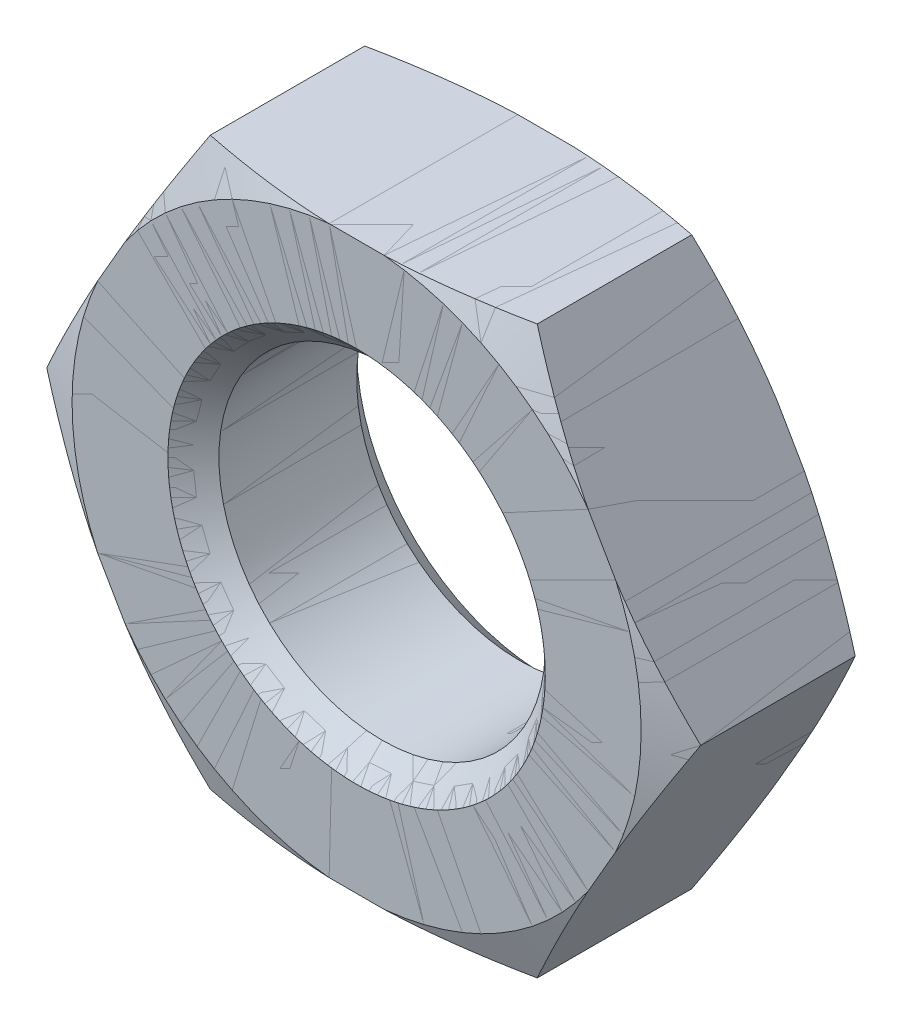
ISO-10303-21;
HEADER;
FILE_DESCRIPTION(('STEP AP214'),'2;1');
FILE_NAME('part.step','',(''),(''),'','','');
FILE_SCHEMA(('AUTOMOTIVE_DESIGN { 1 0 10303 214 1 1 1 1 }'));
ENDSEC;
DATA;
#1=APPLICATION_CONTEXT('core data for automotive mechanical design processes');
#2=APPLICATION_PROTOCOL_DEFINITION('international standard','automotive_design',2000,#1);
#3=PRODUCT_CONTEXT('',#1,'mechanical');
#4=PRODUCT('Part','Part','',(#3));
#5=PRODUCT_RELATED_PRODUCT_CATEGORY('part','',(#4));
#6=PRODUCT_DEFINITION_FORMATION('','',#4);
#7=PRODUCT_DEFINITION_CONTEXT('part definition',#1,'design');
#8=PRODUCT_DEFINITION('design','',#6,#7);
#9=PRODUCT_DEFINITION_SHAPE('','',#8);
#10=(LENGTH_UNIT() NAMED_UNIT(*) SI_UNIT(.MILLI.,.METRE.));
#11=(NAMED_UNIT(*) PLANE_ANGLE_UNIT() SI_UNIT($,.RADIAN.));
#12=(NAMED_UNIT(*) SI_UNIT($,.STERADIAN.) SOLID_ANGLE_UNIT());
#13=UNCERTAINTY_MEASURE_WITH_UNIT(LENGTH_MEASURE(1.E-05),#10,'distance_accuracy_value','');
#14=(GEOMETRIC_REPRESENTATION_CONTEXT(3) GLOBAL_UNCERTAINTY_ASSIGNED_CONTEXT((#13)) GLOBAL_UNIT_ASSIGNED_CONTEXT((#10,
#11,#12)) REPRESENTATION_CONTEXT('',''));
#15=CARTESIAN_POINT('',(0.,0.,0.));
#16=DIRECTION('',(0.,0.,1.));
#17=DIRECTION('',(1.,0.,0.));
#18=AXIS2_PLACEMENT_3D('',#15,#16,#17);
#19=CARTESIAN_POINT('',(0.,0.,1.11022302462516E-13));
#20=DIRECTION('',(0.,0.,0.999999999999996));
#21=DIRECTION('',(0.,-0.999999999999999,0.));
#22=AXIS2_PLACEMENT_3D('',#19,#20,#21);
#23=CONICAL_SURFACE('',#22,12.0563368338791,1.18682389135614);
#24=CARTESIAN_POINT('',(4.39117213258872,16.3942555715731,1.98611902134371));
#25=CARTESIAN_POINT('',(4.51023033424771,16.188040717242,1.91808794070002));
#26=CARTESIAN_POINT('',(4.62942129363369,15.9815959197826,1.85098728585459));
#27=CARTESIAN_POINT('',(4.86809211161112,15.5682059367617,1.71885148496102));
#28=CARTESIAN_POINT('',(4.98757197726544,15.3612607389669,1.65381638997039));
#29=CARTESIAN_POINT('',(5.34653845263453,14.7395125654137,1.4620854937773));
#30=CARTESIAN_POINT('',(5.5864850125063,14.3239129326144,1.33880257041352));
#31=CARTESIAN_POINT('',(6.06892578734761,13.4883009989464,1.10274926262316));
#32=CARTESIAN_POINT('',(6.31142672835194,13.0682770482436,0.990033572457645));
#33=CARTESIAN_POINT('',(6.79790538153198,12.2256713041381,0.778225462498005));
#34=CARTESIAN_POINT('',(7.04188298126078,11.8030897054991,0.679132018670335));
#35=CARTESIAN_POINT('',(7.52501763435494,10.9662759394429,0.499675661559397));
#36=CARTESIAN_POINT('',(7.76413535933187,10.5521118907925,0.418893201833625));
#37=CARTESIAN_POINT('',(8.24375068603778,9.72139377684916,0.275565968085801));
#38=CARTESIAN_POINT('',(8.48424828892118,9.30483970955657,0.213021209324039));
#39=CARTESIAN_POINT('',(8.96582521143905,8.47072401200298,0.108857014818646));
#40=CARTESIAN_POINT('',(9.20690188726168,8.0531669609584,0.0671893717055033));
#41=CARTESIAN_POINT('',(9.6897710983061,7.21681295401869,0.00655433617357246));
#42=CARTESIAN_POINT('',(9.93156360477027,6.79801604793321,-0.0124139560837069));
#43=CARTESIAN_POINT('',(10.4031066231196,5.98127958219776,-0.0263052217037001));
#44=CARTESIAN_POINT('',(10.6328486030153,5.58335480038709,-0.0223941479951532));
#45=CARTESIAN_POINT('',(11.091996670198,4.78808701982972,0.00658630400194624));
#46=CARTESIAN_POINT('',(11.321402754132,4.39074402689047,0.0316558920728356));
#47=CARTESIAN_POINT('',(11.7799140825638,3.59657911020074,0.101870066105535));
#48=CARTESIAN_POINT('',(12.0090177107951,3.19975998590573,0.147056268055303));
#49=CARTESIAN_POINT('',(12.4661307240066,2.40801702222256,0.255631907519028));
#50=CARTESIAN_POINT('',(12.6941401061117,2.01309318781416,0.31902139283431));
#51=CARTESIAN_POINT('',(13.1545430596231,1.21565188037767,0.463527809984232));
#52=CARTESIAN_POINT('',(13.3869048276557,0.813189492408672,0.545046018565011));
#53=CARTESIAN_POINT('',(13.8502703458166,0.010616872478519,0.722366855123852));
#54=CARTESIAN_POINT('',(14.0812739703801,-0.389493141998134,0.818170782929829));
#55=CARTESIAN_POINT('',(14.5410132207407,-1.1857848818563,1.02133226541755));
#56=CARTESIAN_POINT('',(14.7697542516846,-1.58197596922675,1.12864117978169));
#57=CARTESIAN_POINT('',(15.1119090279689,-2.17460542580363,1.29699013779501));
#58=CARTESIAN_POINT('',(15.225783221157,-2.37184131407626,1.35432773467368));
#59=CARTESIAN_POINT('',(15.4532388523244,-2.76580602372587,1.47125419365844));
#60=CARTESIAN_POINT('',(15.5668202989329,-2.96253486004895,1.53084298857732));
#61=CARTESIAN_POINT('',(15.680265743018,-3.15902813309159,1.59145162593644));
#62=B_SPLINE_CURVE_WITH_KNOTS('',3,(#24,#25,#26,#27,#28,#29,#30,#31,#32,#33,#34,#35,#36,#37,#38,
#39,#40,#41,#42,#43,#44,#45,#46,#47,#48,#49,#50,#51,#52,#53,#54,#55,#56,#57,#58,#59,#60,#61),
.UNSPECIFIED.,.F.,.F.,(4,2,2,2,2,2,2,2,2,2,2,2,2,2,2,2,2,2,4),(0.,0.742929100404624,
1.48587655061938,2.97218923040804,4.46581308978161,5.95932460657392,7.41405543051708,
8.86878747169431,10.3201447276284,11.7714444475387,13.1494510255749,14.5274712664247,
15.9083556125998,17.2892435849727,18.7044365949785,20.1197584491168,21.5293164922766,
22.2338726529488,22.9384078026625),.UNSPECIFIED.);
#63=CARTESIAN_POINT('',(10.9744065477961,4.99175908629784,1.94289029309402E-13));
#64=VERTEX_POINT('',#63);
#65=CARTESIAN_POINT('',(13.8564000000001,0.,0.727272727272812));
#66=VERTEX_POINT('',#65);
#67=EDGE_CURVE('P0_E304',#64,#66,#62,.T.);
#68=ORIENTED_EDGE('',*,*,#67,.T.);
#69=CARTESIAN_POINT('',(15.6802657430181,3.15902813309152,1.59145162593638));
#70=CARTESIAN_POINT('',(15.566820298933,2.96253486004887,1.53084298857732));
#71=CARTESIAN_POINT('',(15.4532388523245,2.76580602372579,1.47125419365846));
#72=CARTESIAN_POINT('',(15.2257832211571,2.37184131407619,1.35432773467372));
#73=CARTESIAN_POINT('',(15.111909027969,2.17460542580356,1.29699013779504));
#74=CARTESIAN_POINT('',(14.7697542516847,1.58197596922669,1.12864117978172));
#75=CARTESIAN_POINT('',(14.5410132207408,1.18578488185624,1.02133226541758));
#76=CARTESIAN_POINT('',(14.0812739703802,0.389493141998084,0.81817078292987));
#77=CARTESIAN_POINT('',(13.8502703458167,-0.0106168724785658,0.722366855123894));
#78=CARTESIAN_POINT('',(13.3869048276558,-0.813189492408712,0.545046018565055));
#79=CARTESIAN_POINT('',(13.1545430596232,-1.2156518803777,0.463527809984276));
#80=CARTESIAN_POINT('',(12.6941401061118,-2.01309318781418,0.319021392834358));
#81=CARTESIAN_POINT('',(12.4661307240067,-2.40801702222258,0.255631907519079));
#82=CARTESIAN_POINT('',(12.0090177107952,-3.19975998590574,0.14705626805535));
#83=CARTESIAN_POINT('',(11.7799140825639,-3.59657911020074,0.101870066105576));
#84=CARTESIAN_POINT('',(11.3214027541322,-4.39074402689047,0.0316558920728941));
#85=CARTESIAN_POINT('',(11.0919966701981,-4.78808701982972,0.00658630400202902));
#86=CARTESIAN_POINT('',(10.6328486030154,-5.58335480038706,-0.0223941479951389));
#87=CARTESIAN_POINT('',(10.4031066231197,-5.9812795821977,-0.0263052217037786));
#88=CARTESIAN_POINT('',(9.93156360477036,-6.79801604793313,-0.0124139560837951));
#89=CARTESIAN_POINT('',(9.68977109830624,-7.21681295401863,0.00655433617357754));
#90=CARTESIAN_POINT('',(9.20690188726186,-8.05316696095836,0.0671893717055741));
#91=CARTESIAN_POINT('',(8.96582521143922,-8.47072401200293,0.108857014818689));
#92=CARTESIAN_POINT('',(8.48424828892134,-9.30483970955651,0.213021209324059));
#93=CARTESIAN_POINT('',(8.24375068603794,-9.72139377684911,0.275565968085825));
#94=CARTESIAN_POINT('',(7.76413535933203,-10.5521118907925,0.41889320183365));
#95=CARTESIAN_POINT('',(7.5250176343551,-10.9662759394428,0.499675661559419));
#96=CARTESIAN_POINT('',(7.04188298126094,-11.8030897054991,0.679132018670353));
#97=CARTESIAN_POINT('',(6.79790538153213,-12.2256713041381,0.778225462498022));
#98=CARTESIAN_POINT('',(6.3114267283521,-13.0682770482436,0.990033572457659));
#99=CARTESIAN_POINT('',(6.06892578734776,-13.4883009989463,1.10274926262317));
#100=CARTESIAN_POINT('',(5.58648501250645,-14.3239129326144,1.33880257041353));
#101=CARTESIAN_POINT('',(5.34653845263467,-14.7395125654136,1.46208549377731));
#102=CARTESIAN_POINT('',(4.9875719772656,-15.3612607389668,1.65381638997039));
#103=CARTESIAN_POINT('',(4.86809211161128,-15.5682059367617,1.71885148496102));
#104=CARTESIAN_POINT('',(4.62942129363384,-15.9815959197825,1.85098728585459));
#105=CARTESIAN_POINT('',(4.51023033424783,-16.1880407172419,1.91808794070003));
#106=CARTESIAN_POINT('',(4.39117213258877,-16.3942555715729,1.98611902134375));
#107=B_SPLINE_CURVE_WITH_KNOTS('',3,(#69,#70,#71,#72,#73,#74,#75,#76,#77,#78,#79,#80,#81,#82,
#83,#84,#85,#86,#87,#88,#89,#90,#91,#92,#93,#94,#95,#96,#97,#98,#99,#100,#101,#102,#103,#104,
#105,#106),.UNSPECIFIED.,.F.,.F.,(4,2,2,2,2,2,2,2,2,2,2,2,2,2,2,2,2,2,4),(0.,0.704535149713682,
1.40909131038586,2.8186493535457,4.23397120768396,5.64916421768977,7.03005219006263,
8.41093653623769,9.78895677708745,11.1669633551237,12.618263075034,14.069620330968,
15.5243523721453,16.9790831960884,18.4725947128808,19.9662185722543,21.452531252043,
22.1954787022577,22.9384078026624),.UNSPECIFIED.);
#108=CARTESIAN_POINT('',(10.9744065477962,-4.99175908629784,1.11022302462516E-13));
#109=VERTEX_POINT('',#108);
#110=EDGE_CURVE('P0_E43',#66,#109,#107,.T.);
#111=ORIENTED_EDGE('',*,*,#110,.T.);
#112=CARTESIAN_POINT('',(0.,0.,1.11022302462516E-13));
#113=DIRECTION('',(0.,0.,0.999999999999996));
#114=DIRECTION('',(0.999999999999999,0.,0.));
#115=AXIS2_PLACEMENT_3D('',#112,#113,#114);
#116=CIRCLE('',#115,12.0563368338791);
#117=EDGE_CURVE('P0_E309',#109,#64,#116,.T.);
#118=ORIENTED_EDGE('',*,*,#117,.T.);
#119=EDGE_LOOP('',(#68,#111,#118));
#120=FACE_BOUND('',#119,.T.);
#121=ADVANCED_FACE('P0_F26',(#120),#23,.T.);
#122=CARTESIAN_POINT('',(13.8564,0.,1.2490009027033E-13));
#123=DIRECTION('',(0.,0.,0.999999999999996));
#124=DIRECTION('',(0.999999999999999,0.,0.));
#125=AXIS2_PLACEMENT_3D('',#122,#123,#124);
#126=PLANE('',#125);
#127=CARTESIAN_POINT('',(0.,0.,1.11022302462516E-13));
#128=DIRECTION('',(0.,0.,-0.999999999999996));
#129=DIRECTION('',(0.,0.999999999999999,0.));
#130=AXIS2_PLACEMENT_3D('',#127,#128,#129);
#131=CIRCLE('',#130,12.0563368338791);
#132=CARTESIAN_POINT('',(1.16421309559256,11.9999944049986,0.));
#133=VERTEX_POINT('',#132);
#134=CARTESIAN_POINT('',(9.81019345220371,7.00823531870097,2.22044604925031E-13));
#135=VERTEX_POINT('',#134);
#136=EDGE_CURVE('P0_E161',#133,#135,#131,.T.);
#137=ORIENTED_EDGE('',*,*,#136,.T.);
#138=DIRECTION('',(-0.5,0.866025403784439,0.));
#139=VECTOR('',#138,1.);
#140=CARTESIAN_POINT('',(13.8564,0.,1.2490009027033E-13));
#141=LINE('',#140,#139);
#142=EDGE_CURVE('P0_E167',#64,#135,#141,.T.);
#143=ORIENTED_EDGE('',*,*,#142,.F.);
#144=ORIENTED_EDGE('',*,*,#117,.F.);
#145=DIRECTION('',(0.499999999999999,0.866025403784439,0.));
#146=VECTOR('',#145,1.);
#147=CARTESIAN_POINT('',(6.92820000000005,-11.9999944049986,0.));
#148=LINE('',#147,#146);
#149=CARTESIAN_POINT('',(9.81019345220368,-7.00823531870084,2.08166817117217E-13));
#150=VERTEX_POINT('',#149);
#151=EDGE_CURVE('P0_E350',#150,#109,#148,.T.);
#152=ORIENTED_EDGE('',*,*,#151,.F.);
#153=CARTESIAN_POINT('',(1.16421309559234,-11.9999944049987,0.));
#154=VERTEX_POINT('',#153);
#155=EDGE_CURVE('P0_E316',#154,#150,#116,.T.);
#156=ORIENTED_EDGE('',*,*,#155,.F.);
#157=DIRECTION('',(0.999999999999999,0.,0.));
#158=VECTOR('',#157,1.);
#159=CARTESIAN_POINT('',(-6.92819999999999,-11.9999944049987,0.));
#160=LINE('',#159,#158);
#161=CARTESIAN_POINT('',(-1.16421309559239,-11.9999944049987,1.94289029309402E-13));
#162=VERTEX_POINT('',#161);
#163=EDGE_CURVE('P0_E336',#162,#154,#160,.T.);
#164=ORIENTED_EDGE('',*,*,#163,.F.);
#165=CARTESIAN_POINT('',(-9.81019345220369,-7.00823531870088,0.));
#166=VERTEX_POINT('',#165);
#167=EDGE_CURVE('P0_E389',#166,#162,#116,.T.);
#168=ORIENTED_EDGE('',*,*,#167,.F.);
#169=DIRECTION('',(0.5,-0.866025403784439,0.));
#170=VECTOR('',#169,1.);
#171=CARTESIAN_POINT('',(-13.8564,0.,1.66533453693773E-13));
#172=LINE('',#171,#170);
#173=CARTESIAN_POINT('',(-10.9744065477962,-4.99175908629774,1.11022302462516E-13));
#174=VERTEX_POINT('',#173);
#175=EDGE_CURVE('P0_E355',#174,#166,#172,.T.);
#176=ORIENTED_EDGE('',*,*,#175,.F.);
#177=CARTESIAN_POINT('',(-10.9744065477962,4.99175908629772,1.66533453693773E-13));
#178=VERTEX_POINT('',#177);
#179=EDGE_CURVE('P0_E367',#178,#174,#116,.T.);
#180=ORIENTED_EDGE('',*,*,#179,.F.);
#181=DIRECTION('',(-0.499999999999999,-0.866025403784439,0.));
#182=VECTOR('',#181,1.);
#183=CARTESIAN_POINT('',(-6.92819999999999,11.9999944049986,1.38777878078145E-13));
#184=LINE('',#183,#182);
#185=CARTESIAN_POINT('',(-9.81019345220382,7.00823531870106,1.66533453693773E-13));
#186=VERTEX_POINT('',#185);
#187=EDGE_CURVE('P0_E166',#186,#178,#184,.T.);
#188=ORIENTED_EDGE('',*,*,#187,.F.);
#189=CARTESIAN_POINT('',(-1.16421309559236,11.9999944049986,2.35922392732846E-13));
#190=VERTEX_POINT('',#189);
#191=EDGE_CURVE('P0_E163',#190,#186,#116,.T.);
#192=ORIENTED_EDGE('',*,*,#191,.F.);
#193=DIRECTION('',(-1.,0.,0.));
#194=VECTOR('',#193,1.);
#195=CARTESIAN_POINT('',(6.92820000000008,11.9999944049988,0.));
#196=LINE('',#195,#194);
#197=EDGE_CURVE('P0_E156',#133,#190,#196,.T.);
#198=ORIENTED_EDGE('',*,*,#197,.F.);
#199=EDGE_LOOP('',(#137,#143,#144,#152,#156,#164,#168,#176,#180,#188,#192,#198));
#200=FACE_BOUND('',#199,.T.);
#201=CARTESIAN_POINT('',(0.,0.,1.11022302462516E-13));
#202=DIRECTION('',(0.,0.,-0.999999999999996));
#203=DIRECTION('',(0.,0.999999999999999,0.));
#204=AXIS2_PLACEMENT_3D('',#201,#202,#203);
#205=CIRCLE('',#204,8.);
#206=CARTESIAN_POINT('',(0.,7.99999999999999,1.10532459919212E-13));
#207=VERTEX_POINT('',#206);
#208=EDGE_CURVE('P0_E179',#207,#207,#205,.T.);
#209=ORIENTED_EDGE('',*,*,#208,.F.);
#210=EDGE_LOOP('',(#209));
#211=FACE_BOUND('',#210,.T.);
#212=ADVANCED_FACE('P0_F158',(#200,#211),#126,.F.);
#213=CARTESIAN_POINT('',(6.92820000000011,-11.9999944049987,8.00000000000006));
#214=DIRECTION('',(-0.866025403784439,0.499999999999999,0.));
#215=DIRECTION('',(-0.499999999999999,-0.866025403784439,0.));
#216=AXIS2_PLACEMENT_3D('',#213,#214,#215);
#217=PLANE('',#216);
#218=CARTESIAN_POINT('',(4.39117213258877,-16.394255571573,6.01388097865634));
#219=CARTESIAN_POINT('',(4.51023033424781,-16.1880407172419,6.08191205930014));
#220=CARTESIAN_POINT('',(4.62942129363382,-15.9815959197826,6.14901271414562));
#221=CARTESIAN_POINT('',(4.86809211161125,-15.5682059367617,6.28114851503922));
#222=CARTESIAN_POINT('',(4.98757197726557,-15.3612607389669,6.34618361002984));
#223=CARTESIAN_POINT('',(5.34653845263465,-14.7395125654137,6.53791450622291));
#224=CARTESIAN_POINT('',(5.58648501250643,-14.3239129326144,6.66119742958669));
#225=CARTESIAN_POINT('',(6.06892578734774,-13.4883009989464,6.89725073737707));
#226=CARTESIAN_POINT('',(6.31142672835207,-13.0682770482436,7.00996642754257));
#227=CARTESIAN_POINT('',(6.79790538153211,-12.2256713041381,7.22177453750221));
#228=CARTESIAN_POINT('',(7.04188298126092,-11.8030897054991,7.32086798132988));
#229=CARTESIAN_POINT('',(7.52501763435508,-10.9662759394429,7.50032433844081));
#230=CARTESIAN_POINT('',(7.76413535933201,-10.5521118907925,7.58110679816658));
#231=CARTESIAN_POINT('',(8.2437506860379,-9.72139377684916,7.72443403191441));
#232=CARTESIAN_POINT('',(8.4842482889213,-9.30483970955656,7.78697879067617));
#233=CARTESIAN_POINT('',(8.96582521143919,-8.47072401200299,7.89114298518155));
#234=CARTESIAN_POINT('',(9.20690188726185,-8.05316696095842,7.93281062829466));
#235=CARTESIAN_POINT('',(9.68977109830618,-7.21681295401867,7.99344566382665));
#236=CARTESIAN_POINT('',(9.93156360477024,-6.79801604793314,8.01241395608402));
#237=CARTESIAN_POINT('',(10.4031066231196,-5.9812795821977,8.026305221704));
#238=CARTESIAN_POINT('',(10.6328486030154,-5.5833548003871,8.02239414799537));
#239=CARTESIAN_POINT('',(11.0919966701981,-4.78808701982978,7.9934136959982));
#240=CARTESIAN_POINT('',(11.3214027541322,-4.39074402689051,7.96834410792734));
#241=CARTESIAN_POINT('',(11.7799140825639,-3.59657911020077,7.89812993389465));
#242=CARTESIAN_POINT('',(12.0090177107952,-3.19975998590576,7.85294373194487));
#243=CARTESIAN_POINT('',(12.4661307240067,-2.4080170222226,7.74436809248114));
#244=CARTESIAN_POINT('',(12.6941401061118,-2.01309318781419,7.68097860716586));
#245=CARTESIAN_POINT('',(13.1545430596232,-1.2156518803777,7.53647219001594));
#246=CARTESIAN_POINT('',(13.3869048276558,-0.813189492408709,7.45495398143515));
#247=CARTESIAN_POINT('',(13.8502703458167,-0.0106168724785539,7.27763314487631));
#248=CARTESIAN_POINT('',(14.0812739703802,0.389493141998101,7.18182921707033));
#249=CARTESIAN_POINT('',(14.5410132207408,1.18578488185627,6.97866773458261));
#250=CARTESIAN_POINT('',(14.7697542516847,1.58197596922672,6.87135882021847));
#251=CARTESIAN_POINT('',(15.111909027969,2.1746054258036,6.70300986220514));
#252=CARTESIAN_POINT('',(15.2257832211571,2.37184131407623,6.64567226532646));
#253=CARTESIAN_POINT('',(15.4532388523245,2.76580602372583,6.52874580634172));
#254=CARTESIAN_POINT('',(15.566820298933,2.96253486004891,6.46915701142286));
#255=CARTESIAN_POINT('',(15.6802657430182,3.15902813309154,6.40854837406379));
#256=B_SPLINE_CURVE_WITH_KNOTS('',3,(#218,#219,#220,#221,#222,#223,#224,#225,#226,#227,#228,
#229,#230,#231,#232,#233,#234,#235,#236,#237,#238,#239,#240,#241,#242,#243,#244,#245,#246,#247,
#248,#249,#250,#251,#252,#253,#254,#255),.UNSPECIFIED.,.F.,.F.,(4,2,2,2,2,2,2,2,2,2,2,2,2,2,2,2,
2,2,4),(0.,0.742929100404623,1.48587655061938,2.97218923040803,4.46581308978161,
5.95932460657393,7.41405543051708,8.86878747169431,10.3201447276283,11.7714444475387,
13.1494510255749,14.5274712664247,15.9083556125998,17.2892435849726,18.7044365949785,
20.1197584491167,21.5293164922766,22.2338726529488,22.9384078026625),.UNSPECIFIED.);
#257=CARTESIAN_POINT('',(6.92820000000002,-11.9999944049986,7.27272727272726));
#258=VERTEX_POINT('',#257);
#259=CARTESIAN_POINT('',(9.8101934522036,-7.00823531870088,7.99999999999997));
#260=VERTEX_POINT('',#259);
#261=EDGE_CURVE('P0_E229',#258,#260,#256,.T.);
#262=ORIENTED_EDGE('',*,*,#261,.F.);
#263=DIRECTION('',(0.,0.,-0.999999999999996));
#264=VECTOR('',#263,1.);
#265=CARTESIAN_POINT('',(6.92820000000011,-11.9999944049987,8.00000000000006));
#266=LINE('',#265,#264);
#267=CARTESIAN_POINT('',(6.92820000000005,-11.9999944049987,0.727272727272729));
#268=VERTEX_POINT('',#267);
#269=EDGE_CURVE('P0_E328',#258,#268,#266,.T.);
#270=ORIENTED_EDGE('',*,*,#269,.T.);
#271=EDGE_CURVE('P0_E294',#150,#268,#107,.T.);
#272=ORIENTED_EDGE('',*,*,#271,.F.);
#273=ORIENTED_EDGE('',*,*,#151,.T.);
#274=ORIENTED_EDGE('',*,*,#110,.F.);
#275=DIRECTION('',(0.,0.,-0.999999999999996));
#276=VECTOR('',#275,1.);
#277=CARTESIAN_POINT('',(13.8564,0.,8.00000000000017));
#278=LINE('',#277,#276);
#279=CARTESIAN_POINT('',(13.8564,0.,7.27272727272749));
#280=VERTEX_POINT('',#279);
#281=EDGE_CURVE('P0_E311',#280,#66,#278,.T.);
#282=ORIENTED_EDGE('',*,*,#281,.F.);
#283=CARTESIAN_POINT('',(10.9744065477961,-4.99175908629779,8.00000000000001));
#284=VERTEX_POINT('',#283);
#285=EDGE_CURVE('P0_E352',#284,#280,#256,.T.);
#286=ORIENTED_EDGE('',*,*,#285,.F.);
#287=DIRECTION('',(0.499999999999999,0.866025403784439,0.));
#288=VECTOR('',#287,1.);
#289=CARTESIAN_POINT('',(6.92820000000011,-11.9999944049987,8.00000000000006));
#290=LINE('',#289,#288);
#291=EDGE_CURVE('P0_E332',#260,#284,#290,.T.);
#292=ORIENTED_EDGE('',*,*,#291,.F.);
#293=EDGE_LOOP('',(#262,#270,#272,#273,#274,#282,#286,#292));
#294=FACE_BOUND('',#293,.T.);
#295=ADVANCED_FACE('P0_F28',(#294),#217,.F.);
#296=CARTESIAN_POINT('',(13.8564,0.,8.00000000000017));
#297=DIRECTION('',(-0.866025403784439,-0.5,0.));
#298=DIRECTION('',(0.5,-0.866025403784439,0.));
#299=AXIS2_PLACEMENT_3D('',#296,#297,#298);
#300=PLANE('',#299);
#301=CARTESIAN_POINT('',(15.680265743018,-3.15902813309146,6.40854837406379));
#302=CARTESIAN_POINT('',(15.5668202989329,-2.96253486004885,6.46915701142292));
#303=CARTESIAN_POINT('',(15.4532388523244,-2.76580602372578,6.5287458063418));
#304=CARTESIAN_POINT('',(15.2257832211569,-2.37184131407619,6.64567226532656));
#305=CARTESIAN_POINT('',(15.1119090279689,-2.17460542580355,6.70300986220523));
#306=CARTESIAN_POINT('',(14.7697542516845,-1.58197596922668,6.87135882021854));
#307=CARTESIAN_POINT('',(14.5410132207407,-1.18578488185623,6.97866773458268));
#308=CARTESIAN_POINT('',(14.0812739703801,-0.389493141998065,7.1818292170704));
#309=CARTESIAN_POINT('',(13.8502703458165,0.0106168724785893,7.27763314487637));
#310=CARTESIAN_POINT('',(13.3869048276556,0.813189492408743,7.4549539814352));
#311=CARTESIAN_POINT('',(13.154543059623,1.21565188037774,7.53647219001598));
#312=CARTESIAN_POINT('',(12.6941401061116,2.01309318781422,7.68097860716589));
#313=CARTESIAN_POINT('',(12.4661307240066,2.40801702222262,7.74436809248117));
#314=CARTESIAN_POINT('',(12.0090177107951,3.19975998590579,7.85294373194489));
#315=CARTESIAN_POINT('',(11.7799140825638,3.5965791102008,7.89812993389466));
#316=CARTESIAN_POINT('',(11.321402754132,4.39074402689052,7.96834410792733));
#317=CARTESIAN_POINT('',(11.0919966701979,4.78808701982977,7.99341369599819));
#318=CARTESIAN_POINT('',(10.6328486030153,5.58335480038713,8.02239414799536));
#319=CARTESIAN_POINT('',(10.4031066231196,5.98127958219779,8.02630522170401));
#320=CARTESIAN_POINT('',(9.93156360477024,6.79801604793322,8.01241395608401));
#321=CARTESIAN_POINT('',(9.68977109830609,7.2168129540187,7.99344566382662));
#322=CARTESIAN_POINT('',(9.20690188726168,8.05316696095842,7.93281062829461));
#323=CARTESIAN_POINT('',(8.96582521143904,8.470724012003,7.89114298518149));
#324=CARTESIAN_POINT('',(8.48424828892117,9.30483970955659,7.78697879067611));
#325=CARTESIAN_POINT('',(8.24375068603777,9.72139377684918,7.72443403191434));
#326=CARTESIAN_POINT('',(7.76413535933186,10.5521118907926,7.5811067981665));
#327=CARTESIAN_POINT('',(7.52501763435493,10.9662759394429,7.50032433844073));
#328=CARTESIAN_POINT('',(7.04188298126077,11.8030897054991,7.32086798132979));
#329=CARTESIAN_POINT('',(6.79790538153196,12.2256713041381,7.22177453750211));
#330=CARTESIAN_POINT('',(6.31142672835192,13.0682770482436,7.00996642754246));
#331=CARTESIAN_POINT('',(6.06892578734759,13.4883009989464,6.89725073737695));
#332=CARTESIAN_POINT('',(5.58648501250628,14.3239129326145,6.66119742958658));
#333=CARTESIAN_POINT('',(5.3465384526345,14.7395125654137,6.5379145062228));
#334=CARTESIAN_POINT('',(4.98757197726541,15.3612607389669,6.34618361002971));
#335=CARTESIAN_POINT('',(4.86809211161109,15.5682059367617,6.28114851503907));
#336=CARTESIAN_POINT('',(4.62942129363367,15.9815959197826,6.14901271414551));
#337=CARTESIAN_POINT('',(4.51023033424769,16.188040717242,6.08191205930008));
#338=CARTESIAN_POINT('',(4.39117213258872,16.3942555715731,6.01388097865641));
#339=B_SPLINE_CURVE_WITH_KNOTS('',3,(#301,#302,#303,#304,#305,#306,#307,#308,#309,#310,#311,
#312,#313,#314,#315,#316,#317,#318,#319,#320,#321,#322,#323,#324,#325,#326,#327,#328,#329,#330,
#331,#332,#333,#334,#335,#336,#337,#338),.UNSPECIFIED.,.F.,.F.,(4,2,2,2,2,2,2,2,2,2,2,2,2,2,2,2,
2,2,4),(0.,0.704535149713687,1.40909131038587,2.81864935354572,4.23397120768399,
5.64916421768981,7.03005219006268,8.41093653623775,9.78895677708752,11.1669633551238,
12.6182630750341,14.0696203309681,15.5243523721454,16.9790831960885,18.4725947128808,
19.9662185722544,21.4525312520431,22.1954787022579,22.9384078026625),.UNSPECIFIED.);
#340=CARTESIAN_POINT('',(10.9744065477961,4.99175908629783,8.00000000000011));
#341=VERTEX_POINT('',#340);
#342=EDGE_CURVE('P0_E313',#280,#341,#339,.T.);
#343=ORIENTED_EDGE('',*,*,#342,.F.);
#344=ORIENTED_EDGE('',*,*,#281,.T.);
#345=ORIENTED_EDGE('',*,*,#67,.F.);
#346=ORIENTED_EDGE('',*,*,#142,.T.);
#347=CARTESIAN_POINT('',(6.92820000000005,11.9999944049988,0.727272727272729));
#348=VERTEX_POINT('',#347);
#349=EDGE_CURVE('P0_E51',#348,#135,#62,.T.);
#350=ORIENTED_EDGE('',*,*,#349,.F.);
#351=DIRECTION('',(0.,0.,-0.999999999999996));
#352=VECTOR('',#351,1.);
#353=CARTESIAN_POINT('',(6.92819999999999,11.9999944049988,8.00000000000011));
#354=LINE('',#353,#352);
#355=CARTESIAN_POINT('',(6.92819999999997,11.9999944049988,7.27272727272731));
#356=VERTEX_POINT('',#355);
#357=EDGE_CURVE('P0_E173',#356,#348,#354,.T.);
#358=ORIENTED_EDGE('',*,*,#357,.F.);
#359=CARTESIAN_POINT('',(9.81019345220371,7.00823531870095,8.00000000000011));
#360=VERTEX_POINT('',#359);
#361=EDGE_CURVE('P0_E271',#360,#356,#339,.T.);
#362=ORIENTED_EDGE('',*,*,#361,.F.);
#363=DIRECTION('',(-0.5,0.866025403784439,0.));
#364=VECTOR('',#363,1.);
#365=CARTESIAN_POINT('',(13.8564,0.,8.00000000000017));
#366=LINE('',#365,#364);
#367=EDGE_CURVE('P0_E335',#341,#360,#366,.T.);
#368=ORIENTED_EDGE('',*,*,#367,.F.);
#369=EDGE_LOOP('',(#343,#344,#345,#346,#350,#358,#362,#368));
#370=FACE_BOUND('',#369,.T.);
#371=ADVANCED_FACE('P0_F279',(#370),#300,.F.);
#372=CARTESIAN_POINT('',(6.92819999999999,11.9999944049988,8.00000000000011));
#373=DIRECTION('',(0.,-1.,0.));
#374=DIRECTION('',(1.,0.,0.));
#375=AXIS2_PLACEMENT_3D('',#372,#373,#374);
#376=PLANE('',#375);
#377=CARTESIAN_POINT('',(-18.3557334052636,11.9999944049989,4.01070822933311));
#378=CARTESIAN_POINT('',(-18.0848868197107,11.9999944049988,4.10229935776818));
#379=CARTESIAN_POINT('',(-17.8138573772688,11.9999944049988,4.19334946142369));
#380=CARTESIAN_POINT('',(-17.2713949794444,11.9999944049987,4.37424558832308));
#381=CARTESIAN_POINT('',(-16.999962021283,11.9999944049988,4.46409160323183));
#382=CARTESIAN_POINT('',(-16.1849573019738,11.9999944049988,4.73165482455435));
#383=CARTESIAN_POINT('',(-15.6407290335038,11.9999944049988,4.90738047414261));
#384=CARTESIAN_POINT('',(-14.5488916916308,11.9999944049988,5.25269694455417));
#385=CARTESIAN_POINT('',(-14.0012776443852,11.9999944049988,5.42227207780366));
#386=CARTESIAN_POINT('',(-12.9035839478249,11.9999944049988,5.7532302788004));
#387=CARTESIAN_POINT('',(-12.3535043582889,11.9999944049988,5.91461354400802));
#388=CARTESIAN_POINT('',(-11.2574789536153,11.9999944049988,6.22512154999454));
#389=CARTESIAN_POINT('',(-10.7115702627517,11.9999944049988,6.37437668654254));
#390=CARTESIAN_POINT('',(-9.61643830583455,11.9999944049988,6.66034883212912));
#391=CARTESIAN_POINT('',(-9.06721494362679,11.9999944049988,6.7970654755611));
#392=CARTESIAN_POINT('',(-7.96536548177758,11.9999944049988,7.0547094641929));
#393=CARTESIAN_POINT('',(-7.41274142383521,11.9999944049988,7.17564546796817));
#394=CARTESIAN_POINT('',(-6.3035632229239,11.9999944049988,7.39800260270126));
#395=CARTESIAN_POINT('',(-5.74700936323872,11.9999944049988,7.49942512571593));
#396=CARTESIAN_POINT('',(-4.74421474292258,11.9999944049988,7.66021527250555));
#397=CARTESIAN_POINT('',(-4.29867644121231,11.9999944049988,7.72394153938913));
#398=CARTESIAN_POINT('',(-3.40546500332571,11.9999944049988,7.83423921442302));
#399=CARTESIAN_POINT('',(-2.95779192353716,11.9999944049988,7.88081107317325));
#400=CARTESIAN_POINT('',(-2.06115047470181,11.9999944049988,7.95495747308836));
#401=CARTESIAN_POINT('',(-1.61218314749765,11.9999944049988,7.98254445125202));
#402=CARTESIAN_POINT('',(-0.713455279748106,11.9999944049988,8.01756424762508));
#403=CARTESIAN_POINT('',(-0.263694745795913,11.9999944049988,8.02499723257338));
#404=CARTESIAN_POINT('',(0.637862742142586,11.9999944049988,8.01935209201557));
#405=CARTESIAN_POINT('',(1.08965906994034,11.9999944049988,8.00617499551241));
#406=CARTESIAN_POINT('',(1.99221017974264,11.9999944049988,7.95973348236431));
#407=CARTESIAN_POINT('',(2.44296494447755,11.9999944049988,7.92646873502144));
#408=CARTESIAN_POINT('',(3.34297324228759,11.9999944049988,7.84125454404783));
#409=CARTESIAN_POINT('',(3.79222562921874,11.9999944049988,7.78929314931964));
#410=CARTESIAN_POINT('',(4.68845119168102,11.9999944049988,7.66865499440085));
#411=CARTESIAN_POINT('',(5.13542437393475,11.9999944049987,7.59997828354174));
#412=CARTESIAN_POINT('',(6.10217368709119,11.9999944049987,7.43526295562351));
#413=CARTESIAN_POINT('',(6.6214932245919,11.9999944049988,7.33656195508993));
#414=CARTESIAN_POINT('',(7.65676038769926,11.9999944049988,7.12270708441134));
#415=CARTESIAN_POINT('',(8.17270758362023,11.9999944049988,7.00755115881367));
#416=CARTESIAN_POINT('',(9.20166030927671,11.9999944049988,6.7637732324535));
#417=CARTESIAN_POINT('',(9.7146642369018,11.9999944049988,6.63514451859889));
#418=CARTESIAN_POINT('',(10.7377881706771,11.9999944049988,6.36702724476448));
#419=CARTESIAN_POINT('',(11.2479082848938,11.9999944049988,6.22753909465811));
#420=CARTESIAN_POINT('',(12.2670046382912,11.9999944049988,5.93938881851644));
#421=CARTESIAN_POINT('',(12.7759742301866,11.9999944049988,5.79070328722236));
#422=CARTESIAN_POINT('',(13.7917591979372,11.9999944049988,5.48615971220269));
#423=CARTESIAN_POINT('',(14.2985745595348,11.9999944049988,5.33030162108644));
#424=CARTESIAN_POINT('',(15.3102250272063,11.9999944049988,5.01277690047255));
#425=CARTESIAN_POINT('',(15.8150606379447,11.9999944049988,4.85111187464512));
#426=CARTESIAN_POINT('',(16.8231624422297,11.9999944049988,4.52297599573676));
#427=CARTESIAN_POINT('',(17.3264286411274,11.9999944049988,4.35650515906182));
#428=CARTESIAN_POINT('',(18.3283524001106,11.9999944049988,4.02068258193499));
#429=CARTESIAN_POINT('',(18.8270186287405,11.9999944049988,3.85135666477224));
#430=CARTESIAN_POINT('',(19.8232244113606,11.9999944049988,3.50941969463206));
#431=CARTESIAN_POINT('',(20.3207639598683,11.9999944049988,3.33680862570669));
#432=CARTESIAN_POINT('',(21.8120099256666,11.9999944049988,2.81483191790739));
#433=CARTESIAN_POINT('',(22.8042748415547,11.9999944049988,2.46134601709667));
#434=CARTESIAN_POINT('',(24.2872038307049,11.9999944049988,1.92636689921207));
#435=CARTESIAN_POINT('',(24.7789513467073,11.9999944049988,1.74785926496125));
#436=CARTESIAN_POINT('',(25.7618271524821,11.9999944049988,1.38914416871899));
#437=CARTESIAN_POINT('',(26.2529554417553,11.9999944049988,1.20893670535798));
#438=CARTESIAN_POINT('',(27.2346084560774,11.9999944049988,0.847080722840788));
#439=CARTESIAN_POINT('',(27.7251332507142,11.9999944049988,0.665432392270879));
#440=CARTESIAN_POINT('',(28.7057047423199,11.9999944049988,0.300855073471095));
#441=CARTESIAN_POINT('',(29.195751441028,11.9999944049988,0.117926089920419));
#442=CARTESIAN_POINT('',(29.6855919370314,11.9999944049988,-0.0655522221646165));
#443=B_SPLINE_CURVE_WITH_KNOTS('',3,(#377,#378,#379,#380,#381,#382,#383,#384,#385,#386,#387,
#388,#389,#390,#391,#392,#393,#394,#395,#396,#397,#398,#399,#400,#401,#402,#403,#404,#405,#406,
#407,#408,#409,#410,#411,#412,#413,#414,#415,#416,#417,#418,#419,#420,#421,#422,#423,#424,#425,
#426,#427,#428,#429,#430,#431,#432,#433,#434,#435,#436,#437,#438,#439,#440,#441,#442),
.UNSPECIFIED.,.F.,.F.,(4,2,2,2,2,2,2,2,2,2,2,2,2,2,2,2,2,2,2,2,2,2,2,2,2,2,2,2,2,2,2,2,4),(0.,
0.857740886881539,1.71548770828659,3.43113763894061,5.15089327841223,6.87060744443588,
8.56832456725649,10.2660911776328,11.9629222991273,13.6596323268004,15.0095638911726,
16.3594599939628,17.7084709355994,19.0574707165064,20.4129684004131,21.7684884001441,
23.1248764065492,24.4812604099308,26.0667743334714,27.6524864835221,29.2389925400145,
30.8254387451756,32.416102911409,34.0067775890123,35.5970163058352,37.1872495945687,
38.7671261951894,40.3470104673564,43.5069969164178,45.076430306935,46.6458649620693,
48.2150974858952,49.7843242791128),.UNSPECIFIED.);
#444=CARTESIAN_POINT('',(1.16421309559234,11.9999944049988,8.00000000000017));
#445=VERTEX_POINT('',#444);
#446=EDGE_CURVE('P0_E269',#356,#445,#443,.F.);
#447=ORIENTED_EDGE('',*,*,#446,.F.);
#448=ORIENTED_EDGE('',*,*,#357,.T.);
#449=CARTESIAN_POINT('',(-18.3557334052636,11.9999944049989,3.98929177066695));
#450=CARTESIAN_POINT('',(-18.0848868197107,11.9999944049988,3.8977006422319));
#451=CARTESIAN_POINT('',(-17.8138573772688,11.9999944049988,3.80665053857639));
#452=CARTESIAN_POINT('',(-17.2713949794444,11.9999944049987,3.625754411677));
#453=CARTESIAN_POINT('',(-16.999962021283,11.9999944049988,3.53590839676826));
#454=CARTESIAN_POINT('',(-16.1849573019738,11.9999944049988,3.26834517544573));
#455=CARTESIAN_POINT('',(-15.6407290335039,11.9999944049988,3.09261952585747));
#456=CARTESIAN_POINT('',(-14.5488916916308,11.9999944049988,2.74730305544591));
#457=CARTESIAN_POINT('',(-14.0012776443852,11.9999944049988,2.57772792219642));
#458=CARTESIAN_POINT('',(-12.9035839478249,11.9999944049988,2.24676972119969));
#459=CARTESIAN_POINT('',(-12.3535043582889,11.9999944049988,2.08538645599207));
#460=CARTESIAN_POINT('',(-11.2574789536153,11.9999944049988,1.77487845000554));
#461=CARTESIAN_POINT('',(-10.7115702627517,11.9999944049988,1.62562331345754));
#462=CARTESIAN_POINT('',(-9.61643830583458,11.9999944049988,1.33965116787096));
#463=CARTESIAN_POINT('',(-9.06721494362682,11.9999944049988,1.20293452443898));
#464=CARTESIAN_POINT('',(-7.96536548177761,11.9999944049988,0.94529053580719));
#465=CARTESIAN_POINT('',(-7.41274142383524,11.9999944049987,0.824354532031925));
#466=CARTESIAN_POINT('',(-6.30356322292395,11.9999944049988,0.601997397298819));
#467=CARTESIAN_POINT('',(-5.74700936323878,11.9999944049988,0.500574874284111));
#468=CARTESIAN_POINT('',(-4.74421474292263,11.9999944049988,0.339784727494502));
#469=CARTESIAN_POINT('',(-4.29867644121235,11.9999944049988,0.276058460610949));
#470=CARTESIAN_POINT('',(-3.40546500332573,11.9999944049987,0.165760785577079));
#471=CARTESIAN_POINT('',(-2.95779192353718,11.9999944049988,0.119188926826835));
#472=CARTESIAN_POINT('',(-2.06115047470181,11.9999944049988,0.0450425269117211));
#473=CARTESIAN_POINT('',(-1.61218314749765,11.9999944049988,0.0174555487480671));
#474=CARTESIAN_POINT('',(-0.713455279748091,11.9999944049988,-0.017564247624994));
#475=CARTESIAN_POINT('',(-0.26369474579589,11.9999944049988,-0.0249972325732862));
#476=CARTESIAN_POINT('',(0.637862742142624,11.9999944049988,-0.019352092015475));
#477=CARTESIAN_POINT('',(1.08965906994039,11.9999944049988,-0.0061749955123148));
#478=CARTESIAN_POINT('',(1.9922101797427,11.9999944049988,0.0402665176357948));
#479=CARTESIAN_POINT('',(2.44296494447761,11.9999944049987,0.0735312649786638));
#480=CARTESIAN_POINT('',(3.34297324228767,11.9999944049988,0.158745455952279));
#481=CARTESIAN_POINT('',(3.79222562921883,11.9999944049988,0.210706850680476));
#482=CARTESIAN_POINT('',(4.68845119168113,11.9999944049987,0.331345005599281));
#483=CARTESIAN_POINT('',(5.13542437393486,11.9999944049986,0.400021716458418));
#484=CARTESIAN_POINT('',(6.1021736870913,11.9999944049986,0.564737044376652));
#485=CARTESIAN_POINT('',(6.62149322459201,11.9999944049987,0.663438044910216));
#486=CARTESIAN_POINT('',(7.65676038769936,11.9999944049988,0.877292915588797));
#487=CARTESIAN_POINT('',(8.17270758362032,11.9999944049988,0.992448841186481));
#488=CARTESIAN_POINT('',(9.20166030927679,11.9999944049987,1.23622676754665));
#489=CARTESIAN_POINT('',(9.71466423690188,11.9999944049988,1.36485548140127));
#490=CARTESIAN_POINT('',(10.7377881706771,11.9999944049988,1.63297275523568));
#491=CARTESIAN_POINT('',(11.2479082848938,11.9999944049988,1.77246090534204));
#492=CARTESIAN_POINT('',(12.2670046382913,11.9999944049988,2.06061118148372));
#493=CARTESIAN_POINT('',(12.7759742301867,11.9999944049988,2.2092967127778));
#494=CARTESIAN_POINT('',(13.7917591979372,11.9999944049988,2.51384028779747));
#495=CARTESIAN_POINT('',(14.2985745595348,11.9999944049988,2.66969837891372));
#496=CARTESIAN_POINT('',(15.3102250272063,11.9999944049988,2.98722309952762));
#497=CARTESIAN_POINT('',(15.8150606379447,11.9999944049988,3.14888812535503));
#498=CARTESIAN_POINT('',(16.8231624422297,11.9999944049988,3.4770240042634));
#499=CARTESIAN_POINT('',(17.3264286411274,11.9999944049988,3.64349484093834));
#500=CARTESIAN_POINT('',(18.3283524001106,11.9999944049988,3.97931741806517));
#501=CARTESIAN_POINT('',(18.8270186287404,11.9999944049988,4.14864333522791));
#502=CARTESIAN_POINT('',(19.8232244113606,11.9999944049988,4.49058030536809));
#503=CARTESIAN_POINT('',(20.3207639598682,11.9999944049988,4.66319137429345));
#504=CARTESIAN_POINT('',(21.8120099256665,11.9999944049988,5.18516808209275));
#505=CARTESIAN_POINT('',(22.8042748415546,11.9999944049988,5.53865398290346));
#506=CARTESIAN_POINT('',(24.2872038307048,11.9999944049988,6.07363310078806));
#507=CARTESIAN_POINT('',(24.7789513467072,11.9999944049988,6.25214073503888));
#508=CARTESIAN_POINT('',(25.7618271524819,11.9999944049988,6.61085583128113));
#509=CARTESIAN_POINT('',(26.2529554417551,11.9999944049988,6.79106329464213));
#510=CARTESIAN_POINT('',(27.2346084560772,11.9999944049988,7.15291927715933));
#511=CARTESIAN_POINT('',(27.725133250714,11.9999944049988,7.33456760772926));
#512=CARTESIAN_POINT('',(28.7057047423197,11.9999944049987,7.69914492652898));
#513=CARTESIAN_POINT('',(29.1957514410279,11.9999944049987,7.88207391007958));
#514=CARTESIAN_POINT('',(29.6855919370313,11.9999944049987,8.06555222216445));
#515=B_SPLINE_CURVE_WITH_KNOTS('',3,(#449,#450,#451,#452,#453,#454,#455,#456,#457,#458,#459,
#460,#461,#462,#463,#464,#465,#466,#467,#468,#469,#470,#471,#472,#473,#474,#475,#476,#477,#478,
#479,#480,#481,#482,#483,#484,#485,#486,#487,#488,#489,#490,#491,#492,#493,#494,#495,#496,#497,
#498,#499,#500,#501,#502,#503,#504,#505,#506,#507,#508,#509,#510,#511,#512,#513,#514),
.UNSPECIFIED.,.F.,.F.,(4,2,2,2,2,2,2,2,2,2,2,2,2,2,2,2,2,2,2,2,2,2,2,2,2,2,2,2,2,2,2,2,4),(0.,
0.857740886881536,1.71548770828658,3.4311376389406,5.15089327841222,6.87060744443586,
8.56832456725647,10.2660911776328,11.9629222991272,13.6596323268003,15.0095638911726,
16.3594599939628,17.7084709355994,19.0574707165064,20.4129684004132,21.7684884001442,
23.1248764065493,24.481260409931,26.0667743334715,27.6524864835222,29.2389925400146,
30.8254387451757,32.416102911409,34.0067775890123,35.5970163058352,37.1872495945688,
38.7671261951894,40.3470104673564,43.5069969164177,45.0764303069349,46.6458649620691,
48.215097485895,49.7843242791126),.UNSPECIFIED.);
#516=EDGE_CURVE('P0_E170',#133,#348,#515,.T.);
#517=ORIENTED_EDGE('',*,*,#516,.F.);
#518=ORIENTED_EDGE('',*,*,#197,.T.);
#519=CARTESIAN_POINT('',(-6.92819999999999,11.9999944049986,0.727272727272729));
#520=VERTEX_POINT('',#519);
#521=EDGE_CURVE('P0_E175',#520,#190,#515,.T.);
#522=ORIENTED_EDGE('',*,*,#521,.F.);
#523=DIRECTION('',(0.,0.,-0.999999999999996));
#524=VECTOR('',#523,1.);
#525=CARTESIAN_POINT('',(-6.92820000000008,11.9999944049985,8.00000000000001));
#526=LINE('',#525,#524);
#527=CARTESIAN_POINT('',(-6.92820000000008,11.9999944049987,7.27272727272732));
#528=VERTEX_POINT('',#527);
#529=EDGE_CURVE('P0_E317',#528,#520,#526,.T.);
#530=ORIENTED_EDGE('',*,*,#529,.F.);
#531=CARTESIAN_POINT('',(-1.16421309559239,11.9999944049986,8.00000000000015));
#532=VERTEX_POINT('',#531);
#533=EDGE_CURVE('P0_E264',#532,#528,#443,.F.);
#534=ORIENTED_EDGE('',*,*,#533,.F.);
#535=DIRECTION('',(-1.,0.,0.));
#536=VECTOR('',#535,1.);
#537=CARTESIAN_POINT('',(6.92819999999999,11.9999944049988,8.00000000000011));
#538=LINE('',#537,#536);
#539=EDGE_CURVE('P0_E345',#445,#532,#538,.T.);
#540=ORIENTED_EDGE('',*,*,#539,.F.);
#541=EDGE_LOOP('',(#447,#448,#517,#518,#522,#530,#534,#540));
#542=FACE_BOUND('',#541,.T.);
#543=ADVANCED_FACE('P0_F172',(#542),#376,.F.);
#544=CARTESIAN_POINT('',(-6.92820000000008,11.9999944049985,8.00000000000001));
#545=DIRECTION('',(0.866025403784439,-0.499999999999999,0.));
#546=DIRECTION('',(0.499999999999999,0.866025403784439,0.));
#547=AXIS2_PLACEMENT_3D('',#544,#545,#546);
#548=PLANE('',#547);
#549=CARTESIAN_POINT('',(-4.3911721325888,16.394255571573,6.01388097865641));
#550=CARTESIAN_POINT('',(-4.51023033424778,16.1880407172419,6.0819120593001));
#551=CARTESIAN_POINT('',(-4.62942129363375,15.9815959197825,6.14901271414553));
#552=CARTESIAN_POINT('',(-4.86809211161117,15.5682059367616,6.2811485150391));
#553=CARTESIAN_POINT('',(-4.9875719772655,15.3612607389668,6.34618361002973));
#554=CARTESIAN_POINT('',(-5.34653845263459,14.7395125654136,6.53791450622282));
#555=CARTESIAN_POINT('',(-5.58648501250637,14.3239129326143,6.6611974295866));
#556=CARTESIAN_POINT('',(-6.06892578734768,13.4883009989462,6.89725073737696));
#557=CARTESIAN_POINT('',(-6.31142672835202,13.0682770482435,7.00996642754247));
#558=CARTESIAN_POINT('',(-6.79790538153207,12.2256713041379,7.22177453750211));
#559=CARTESIAN_POINT('',(-7.04188298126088,11.8030897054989,7.32086798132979));
#560=CARTESIAN_POINT('',(-7.52501763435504,10.9662759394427,7.50032433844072));
#561=CARTESIAN_POINT('',(-7.76413535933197,10.5521118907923,7.58110679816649));
#562=CARTESIAN_POINT('',(-8.24375068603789,9.72139377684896,7.72443403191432));
#563=CARTESIAN_POINT('',(-8.48424828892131,9.30483970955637,7.78697879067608));
#564=CARTESIAN_POINT('',(-8.96582521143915,8.47072401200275,7.89114298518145));
#565=CARTESIAN_POINT('',(-9.20690188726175,8.05316696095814,7.93281062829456));
#566=CARTESIAN_POINT('',(-9.68977109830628,7.2168129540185,7.99344566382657));
#567=CARTESIAN_POINT('',(-9.93156360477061,6.79801604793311,8.01241395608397));
#568=CARTESIAN_POINT('',(-10.4031066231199,5.98127958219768,8.02630522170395));
#569=CARTESIAN_POINT('',(-10.6328486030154,5.58335480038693,8.02239414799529));
#570=CARTESIAN_POINT('',(-11.091996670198,4.78808701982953,7.9934136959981));
#571=CARTESIAN_POINT('',(-11.3214027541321,4.39074402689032,7.96834410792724));
#572=CARTESIAN_POINT('',(-11.7799140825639,3.59657911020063,7.89812993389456));
#573=CARTESIAN_POINT('',(-12.0090177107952,3.19975998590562,7.85294373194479));
#574=CARTESIAN_POINT('',(-12.4661307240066,2.40801702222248,7.74436809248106));
#575=CARTESIAN_POINT('',(-12.6941401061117,2.01309318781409,7.68097860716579));
#576=CARTESIAN_POINT('',(-13.1545430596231,1.21565188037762,7.53647219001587));
#577=CARTESIAN_POINT('',(-13.3869048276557,0.813189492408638,7.45495398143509));
#578=CARTESIAN_POINT('',(-13.8502703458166,0.0106168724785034,7.27763314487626));
#579=CARTESIAN_POINT('',(-14.0812739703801,-0.389493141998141,7.18182921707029));
#580=CARTESIAN_POINT('',(-14.5410132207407,-1.18578488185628,6.97866773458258));
#581=CARTESIAN_POINT('',(-14.7697542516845,-1.58197596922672,6.87135882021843));
#582=CARTESIAN_POINT('',(-15.1119090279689,-2.17460542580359,6.70300986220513));
#583=CARTESIAN_POINT('',(-15.225783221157,-2.37184131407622,6.64567226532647));
#584=CARTESIAN_POINT('',(-15.4532388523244,-2.7658060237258,6.5287458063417));
#585=CARTESIAN_POINT('',(-15.5668202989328,-2.96253486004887,6.4691570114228));
#586=CARTESIAN_POINT('',(-15.6802657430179,-3.15902813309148,6.40854837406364));
#587=B_SPLINE_CURVE_WITH_KNOTS('',3,(#549,#550,#551,#552,#553,#554,#555,#556,#557,#558,#559,
#560,#561,#562,#563,#564,#565,#566,#567,#568,#569,#570,#571,#572,#573,#574,#575,#576,#577,#578,
#579,#580,#581,#582,#583,#584,#585,#586),.UNSPECIFIED.,.F.,.F.,(4,2,2,2,2,2,2,2,2,2,2,2,2,2,2,2,
2,2,4),(0.,0.742929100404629,1.4858765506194,2.97218923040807,4.46581308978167,5.95932460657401,
7.41405543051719,8.86878747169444,10.3201447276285,11.7714444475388,13.149451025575,
14.5274712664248,15.9083556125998,17.2892435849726,18.7044365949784,20.1197584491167,
21.5293164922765,22.2338726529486,22.9384078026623),.UNSPECIFIED.);
#588=CARTESIAN_POINT('',(-9.81019345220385,7.00823531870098,7.99999999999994));
#589=VERTEX_POINT('',#588);
#590=EDGE_CURVE('P0_E270',#528,#589,#587,.T.);
#591=ORIENTED_EDGE('',*,*,#590,.F.);
#592=ORIENTED_EDGE('',*,*,#529,.T.);
#593=CARTESIAN_POINT('',(-15.6802657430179,-3.15902813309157,1.5914516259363));
#594=CARTESIAN_POINT('',(-15.5668202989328,-2.9625348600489,1.53084298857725));
#595=CARTESIAN_POINT('',(-15.4532388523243,-2.76580602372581,1.47125419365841));
#596=CARTESIAN_POINT('',(-15.225783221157,-2.3718413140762,1.35432773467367));
#597=CARTESIAN_POINT('',(-15.1119090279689,-2.17460542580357,1.29699013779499));
#598=CARTESIAN_POINT('',(-14.7697542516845,-1.58197596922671,1.12864117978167));
#599=CARTESIAN_POINT('',(-14.5410132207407,-1.18578488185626,1.02133226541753));
#600=CARTESIAN_POINT('',(-14.0812739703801,-0.389493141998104,0.818170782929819));
#601=CARTESIAN_POINT('',(-13.8502703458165,0.010616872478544,0.722366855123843));
#602=CARTESIAN_POINT('',(-13.3869048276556,0.813189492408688,0.545046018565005));
#603=CARTESIAN_POINT('',(-13.1545430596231,1.21565188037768,0.463527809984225));
#604=CARTESIAN_POINT('',(-12.6941401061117,2.01309318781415,0.319021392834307));
#605=CARTESIAN_POINT('',(-12.4661307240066,2.40801702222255,0.255631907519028));
#606=CARTESIAN_POINT('',(-12.0090177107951,3.19975998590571,0.147056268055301));
#607=CARTESIAN_POINT('',(-11.7799140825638,3.59657911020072,0.101870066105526));
#608=CARTESIAN_POINT('',(-11.3214027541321,4.39074402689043,0.0316558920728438));
#609=CARTESIAN_POINT('',(-11.091996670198,4.78808701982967,0.00658630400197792));
#610=CARTESIAN_POINT('',(-10.6328486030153,5.58335480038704,-0.0223941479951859));
#611=CARTESIAN_POINT('',(-10.4031066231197,5.98127958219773,-0.0263052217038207));
#612=CARTESIAN_POINT('',(-9.93156360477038,6.79801604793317,-0.0124139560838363));
#613=CARTESIAN_POINT('',(-9.68977109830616,7.21681295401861,0.00655433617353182));
#614=CARTESIAN_POINT('',(-9.20690188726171,8.05316696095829,0.0671893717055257));
#615=CARTESIAN_POINT('',(-8.96582521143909,8.47072401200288,0.108857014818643));
#616=CARTESIAN_POINT('',(-8.48424828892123,9.30483970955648,0.213021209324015));
#617=CARTESIAN_POINT('',(-8.24375068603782,9.72139377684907,0.275565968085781));
#618=CARTESIAN_POINT('',(-7.76413535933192,10.5521118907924,0.418893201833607));
#619=CARTESIAN_POINT('',(-7.52501763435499,10.9662759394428,0.499675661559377));
#620=CARTESIAN_POINT('',(-7.04188298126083,11.803089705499,0.679132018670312));
#621=CARTESIAN_POINT('',(-6.79790538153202,12.225671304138,0.778225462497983));
#622=CARTESIAN_POINT('',(-6.31142672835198,13.0682770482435,0.990033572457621));
#623=CARTESIAN_POINT('',(-6.06892578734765,13.4883009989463,1.10274926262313));
#624=CARTESIAN_POINT('',(-5.58648501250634,14.3239129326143,1.3388025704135));
#625=CARTESIAN_POINT('',(-5.34653845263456,14.7395125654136,1.46208549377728));
#626=CARTESIAN_POINT('',(-4.98757197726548,15.3612607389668,1.65381638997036));
#627=CARTESIAN_POINT('',(-4.86809211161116,15.5682059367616,1.71885148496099));
#628=CARTESIAN_POINT('',(-4.62942129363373,15.9815959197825,1.85098728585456));
#629=CARTESIAN_POINT('',(-4.51023033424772,16.1880407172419,1.9180879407));
#630=CARTESIAN_POINT('',(-4.39117213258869,16.3942555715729,1.98611902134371));
#631=B_SPLINE_CURVE_WITH_KNOTS('',3,(#593,#594,#595,#596,#597,#598,#599,#600,#601,#602,#603,
#604,#605,#606,#607,#608,#609,#610,#611,#612,#613,#614,#615,#616,#617,#618,#619,#620,#621,#622,
#623,#624,#625,#626,#627,#628,#629,#630),.UNSPECIFIED.,.F.,.F.,(4,2,2,2,2,2,2,2,2,2,2,2,2,2,2,2,
2,2,4),(0.,0.704535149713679,1.40909131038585,2.81864935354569,4.23397120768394,
5.64916421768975,7.0300521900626,8.41093653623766,9.78895677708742,11.1669633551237,
12.618263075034,14.069620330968,15.5243523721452,16.9790831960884,18.4725947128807,
19.9662185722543,21.4525312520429,22.1954787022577,22.9384078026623),.UNSPECIFIED.);
#632=EDGE_CURVE('P0_E287',#186,#520,#631,.T.);
#633=ORIENTED_EDGE('',*,*,#632,.F.);
#634=ORIENTED_EDGE('',*,*,#187,.T.);
#635=CARTESIAN_POINT('',(-13.8564,0.,0.727272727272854));
#636=VERTEX_POINT('',#635);
#637=EDGE_CURVE('P0_E288',#636,#178,#631,.T.);
#638=ORIENTED_EDGE('',*,*,#637,.F.);
#639=DIRECTION('',(0.,0.,-0.999999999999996));
#640=VECTOR('',#639,1.);
#641=CARTESIAN_POINT('',(-13.8564,-1.11022302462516E-13,8.00000000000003));
#642=LINE('',#641,#640);
#643=CARTESIAN_POINT('',(-13.8564,-1.87350135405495E-13,7.27272727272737));
#644=VERTEX_POINT('',#643);
#645=EDGE_CURVE('P0_E322',#644,#636,#642,.T.);
#646=ORIENTED_EDGE('',*,*,#645,.F.);
#647=CARTESIAN_POINT('',(-10.9744065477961,4.99175908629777,7.99999999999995));
#648=VERTEX_POINT('',#647);
#649=EDGE_CURVE('P0_E259',#648,#644,#587,.T.);
#650=ORIENTED_EDGE('',*,*,#649,.F.);
#651=DIRECTION('',(-0.499999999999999,-0.866025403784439,0.));
#652=VECTOR('',#651,1.);
#653=CARTESIAN_POINT('',(-6.92820000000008,11.9999944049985,8.00000000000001));
#654=LINE('',#653,#652);
#655=EDGE_CURVE('P0_E342',#589,#648,#654,.T.);
#656=ORIENTED_EDGE('',*,*,#655,.F.);
#657=EDGE_LOOP('',(#591,#592,#633,#634,#638,#646,#650,#656));
#658=FACE_BOUND('',#657,.T.);
#659=ADVANCED_FACE('P0_F278',(#658),#548,.F.);
#660=CARTESIAN_POINT('',(-13.8564,-1.11022302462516E-13,8.00000000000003));
#661=DIRECTION('',(0.866025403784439,0.5,0.));
#662=DIRECTION('',(-0.5,0.866025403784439,0.));
#663=AXIS2_PLACEMENT_3D('',#660,#661,#662);
#664=PLANE('',#663);
#665=CARTESIAN_POINT('',(-15.680265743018,3.15902813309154,6.40854837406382));
#666=CARTESIAN_POINT('',(-15.5668202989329,2.96253486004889,6.46915701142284));
#667=CARTESIAN_POINT('',(-15.4532388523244,2.7658060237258,6.52874580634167));
#668=CARTESIAN_POINT('',(-15.225783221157,2.3718413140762,6.6456722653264));
#669=CARTESIAN_POINT('',(-15.111909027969,2.17460542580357,6.70300986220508));
#670=CARTESIAN_POINT('',(-14.7697542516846,1.5819759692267,6.87135882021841));
#671=CARTESIAN_POINT('',(-14.5410132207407,1.18578488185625,6.97866773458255));
#672=CARTESIAN_POINT('',(-14.0812739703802,0.3894931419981,7.18182921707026));
#673=CARTESIAN_POINT('',(-13.8502703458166,-0.0106168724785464,7.27763314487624));
#674=CARTESIAN_POINT('',(-13.3869048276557,-0.813189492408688,7.45495398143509));
#675=CARTESIAN_POINT('',(-13.1545430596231,-1.21565188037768,7.53647219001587));
#676=CARTESIAN_POINT('',(-12.6941401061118,-2.01309318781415,7.68097860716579));
#677=CARTESIAN_POINT('',(-12.4661307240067,-2.40801702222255,7.74436809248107));
#678=CARTESIAN_POINT('',(-12.0090177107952,-3.1997599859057,7.8529437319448));
#679=CARTESIAN_POINT('',(-11.7799140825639,-3.59657911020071,7.89812993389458));
#680=CARTESIAN_POINT('',(-11.3214027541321,-4.39074402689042,7.96834410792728));
#681=CARTESIAN_POINT('',(-11.0919966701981,-4.78808701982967,7.99341369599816));
#682=CARTESIAN_POINT('',(-10.6328486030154,-5.58335480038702,8.02239414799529));
#683=CARTESIAN_POINT('',(-10.4031066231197,-5.98127958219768,8.02630522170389));
#684=CARTESIAN_POINT('',(-9.93156360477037,-6.79801604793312,8.01241395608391));
#685=CARTESIAN_POINT('',(-9.68977109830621,-7.21681295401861,7.99344566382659));
#686=CARTESIAN_POINT('',(-9.20690188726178,-8.05316696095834,7.93281062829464));
#687=CARTESIAN_POINT('',(-8.96582521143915,-8.47072401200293,7.89114298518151));
#688=CARTESIAN_POINT('',(-8.48424828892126,-9.30483970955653,7.78697879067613));
#689=CARTESIAN_POINT('',(-8.24375068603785,-9.72139377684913,7.72443403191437));
#690=CARTESIAN_POINT('',(-7.76413535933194,-10.5521118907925,7.58110679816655));
#691=CARTESIAN_POINT('',(-7.525017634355,-10.9662759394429,7.50032433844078));
#692=CARTESIAN_POINT('',(-7.04188298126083,-11.8030897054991,7.32086798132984));
#693=CARTESIAN_POINT('',(-6.79790538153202,-12.2256713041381,7.22177453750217));
#694=CARTESIAN_POINT('',(-6.31142672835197,-13.0682770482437,7.00996642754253));
#695=CARTESIAN_POINT('',(-6.06892578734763,-13.4883009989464,6.89725073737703));
#696=CARTESIAN_POINT('',(-5.58648501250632,-14.3239129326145,6.66119742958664));
#697=CARTESIAN_POINT('',(-5.34653845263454,-14.7395125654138,6.53791450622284));
#698=CARTESIAN_POINT('',(-4.98757197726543,-15.361260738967,6.34618361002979));
#699=CARTESIAN_POINT('',(-4.8680921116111,-15.5682059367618,6.28114851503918));
#700=CARTESIAN_POINT('',(-4.62942129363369,-15.9815959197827,6.14901271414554));
#701=CARTESIAN_POINT('',(-4.51023033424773,-16.1880407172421,6.08191205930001));
#702=CARTESIAN_POINT('',(-4.3911721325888,-16.3942555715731,6.01388097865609));
#703=B_SPLINE_CURVE_WITH_KNOTS('',3,(#665,#666,#667,#668,#669,#670,#671,#672,#673,#674,#675,
#676,#677,#678,#679,#680,#681,#682,#683,#684,#685,#686,#687,#688,#689,#690,#691,#692,#693,#694,
#695,#696,#697,#698,#699,#700,#701,#702),.UNSPECIFIED.,.F.,.F.,(4,2,2,2,2,2,2,2,2,2,2,2,2,2,2,2,
2,2,4),(0.,0.70453514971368,1.40909131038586,2.81864935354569,4.23397120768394,5.64916421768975,
7.0300521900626,8.41093653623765,9.78895677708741,11.1669633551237,12.618263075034,
14.0696203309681,15.5243523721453,16.9790831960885,18.4725947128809,19.9662185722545,
21.4525312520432,22.1954787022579,22.9384078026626),.UNSPECIFIED.);
#704=CARTESIAN_POINT('',(-10.9744065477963,-4.99175908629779,8.00000000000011));
#705=VERTEX_POINT('',#704);
#706=EDGE_CURVE('P0_E373',#644,#705,#703,.T.);
#707=ORIENTED_EDGE('',*,*,#706,.F.);
#708=ORIENTED_EDGE('',*,*,#645,.T.);
#709=CARTESIAN_POINT('',(-4.39117213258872,-16.3942555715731,1.98611902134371));
#710=CARTESIAN_POINT('',(-4.51023033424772,-16.188040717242,1.91808794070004));
#711=CARTESIAN_POINT('',(-4.62942129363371,-15.9815959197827,1.85098728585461));
#712=CARTESIAN_POINT('',(-4.86809211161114,-15.5682059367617,1.71885148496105));
#713=CARTESIAN_POINT('',(-4.98757197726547,-15.3612607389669,1.65381638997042));
#714=CARTESIAN_POINT('',(-5.34653845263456,-14.7395125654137,1.46208549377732));
#715=CARTESIAN_POINT('',(-5.58648501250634,-14.3239129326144,1.33880257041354));
#716=CARTESIAN_POINT('',(-6.06892578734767,-13.4883009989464,1.10274926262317));
#717=CARTESIAN_POINT('',(-6.31142672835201,-13.0682770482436,0.990033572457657));
#718=CARTESIAN_POINT('',(-6.79790538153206,-12.2256713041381,0.778225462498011));
#719=CARTESIAN_POINT('',(-7.04188298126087,-11.8030897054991,0.679132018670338));
#720=CARTESIAN_POINT('',(-7.52501763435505,-10.9662759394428,0.499675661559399));
#721=CARTESIAN_POINT('',(-7.76413535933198,-10.5521118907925,0.418893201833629));
#722=CARTESIAN_POINT('',(-8.2437506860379,-9.72139377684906,0.275565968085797));
#723=CARTESIAN_POINT('',(-8.48424828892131,-9.30483970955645,0.213021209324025));
#724=CARTESIAN_POINT('',(-8.9658252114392,-8.47072401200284,0.108857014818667));
#725=CARTESIAN_POINT('',(-9.20690188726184,-8.05316696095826,0.0671893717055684));
#726=CARTESIAN_POINT('',(-9.68977109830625,-7.21681295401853,0.00655433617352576));
#727=CARTESIAN_POINT('',(-9.93156360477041,-6.79801604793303,-0.0124139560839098));
#728=CARTESIAN_POINT('',(-10.4031066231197,-5.9812795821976,-0.0263052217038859));
#729=CARTESIAN_POINT('',(-10.6328486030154,-5.58335480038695,-0.0223941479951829));
#730=CARTESIAN_POINT('',(-11.0919966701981,-4.78808701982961,0.00658630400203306));
#731=CARTESIAN_POINT('',(-11.3214027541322,-4.39074402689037,0.0316558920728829));
#732=CARTESIAN_POINT('',(-11.7799140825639,-3.59657911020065,0.101870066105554));
#733=CARTESIAN_POINT('',(-12.0090177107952,-3.19975998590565,0.147056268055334));
#734=CARTESIAN_POINT('',(-12.4661307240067,-2.4080170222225,0.255631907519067));
#735=CARTESIAN_POINT('',(-12.6941401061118,-2.0130931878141,0.319021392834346));
#736=CARTESIAN_POINT('',(-13.1545430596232,-1.21565188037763,0.463527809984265));
#737=CARTESIAN_POINT('',(-13.3869048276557,-0.813189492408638,0.545046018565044));
#738=CARTESIAN_POINT('',(-13.8502703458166,-0.010616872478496,0.722366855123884));
#739=CARTESIAN_POINT('',(-14.0812739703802,0.389493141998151,0.818170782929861));
#740=CARTESIAN_POINT('',(-14.5410132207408,1.1857848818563,1.02133226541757));
#741=CARTESIAN_POINT('',(-14.7697542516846,1.58197596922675,1.12864117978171));
#742=CARTESIAN_POINT('',(-15.111909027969,2.17460542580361,1.29699013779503));
#743=CARTESIAN_POINT('',(-15.225783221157,2.37184131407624,1.35432773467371));
#744=CARTESIAN_POINT('',(-15.4532388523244,2.76580602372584,1.47125419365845));
#745=CARTESIAN_POINT('',(-15.5668202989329,2.96253486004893,1.53084298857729));
#746=CARTESIAN_POINT('',(-15.680265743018,3.15902813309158,1.59145162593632));
#747=B_SPLINE_CURVE_WITH_KNOTS('',3,(#709,#710,#711,#712,#713,#714,#715,#716,#717,#718,#719,
#720,#721,#722,#723,#724,#725,#726,#727,#728,#729,#730,#731,#732,#733,#734,#735,#736,#737,#738,
#739,#740,#741,#742,#743,#744,#745,#746),.UNSPECIFIED.,.F.,.F.,(4,2,2,2,2,2,2,2,2,2,2,2,2,2,2,2,
2,2,4),(0.,0.742929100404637,1.48587655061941,2.9721892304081,4.46581308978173,5.95932460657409,
7.41405543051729,8.86878747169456,10.3201447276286,11.771444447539,13.1494510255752,
14.5274712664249,15.9083556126,17.2892435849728,18.7044365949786,20.1197584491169,
21.5293164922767,22.2338726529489,22.9384078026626),.UNSPECIFIED.);
#748=EDGE_CURVE('P0_E293',#174,#636,#747,.T.);
#749=ORIENTED_EDGE('',*,*,#748,.F.);
#750=ORIENTED_EDGE('',*,*,#175,.T.);
#751=CARTESIAN_POINT('',(-6.92820000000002,-11.9999944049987,0.727272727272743));
#752=VERTEX_POINT('',#751);
#753=EDGE_CURVE('P0_E202',#752,#166,#747,.T.);
#754=ORIENTED_EDGE('',*,*,#753,.F.);
#755=DIRECTION('',(0.,0.,-0.999999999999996));
#756=VECTOR('',#755,1.);
#757=CARTESIAN_POINT('',(-6.92820000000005,-11.9999944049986,8.));
#758=LINE('',#757,#756);
#759=CARTESIAN_POINT('',(-6.92820000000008,-11.9999944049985,7.2727272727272));
#760=VERTEX_POINT('',#759);
#761=EDGE_CURVE('P0_E325',#760,#752,#758,.T.);
#762=ORIENTED_EDGE('',*,*,#761,.F.);
#763=CARTESIAN_POINT('',(-9.81019345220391,-7.00823531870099,7.99999999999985));
#764=VERTEX_POINT('',#763);
#765=EDGE_CURVE('P0_E254',#764,#760,#703,.T.);
#766=ORIENTED_EDGE('',*,*,#765,.F.);
#767=DIRECTION('',(0.5,-0.866025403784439,0.));
#768=VECTOR('',#767,1.);
#769=CARTESIAN_POINT('',(-13.8564,-1.11022302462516E-13,8.00000000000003));
#770=LINE('',#769,#768);
#771=EDGE_CURVE('P0_E339',#705,#764,#770,.T.);
#772=ORIENTED_EDGE('',*,*,#771,.F.);
#773=EDGE_LOOP('',(#707,#708,#749,#750,#754,#762,#766,#772));
#774=FACE_BOUND('',#773,.T.);
#775=ADVANCED_FACE('P0_F216',(#774),#664,.F.);
#776=CARTESIAN_POINT('',(-6.92820000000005,-11.9999944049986,8.));
#777=DIRECTION('',(0.,0.999999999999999,0.));
#778=DIRECTION('',(-0.999999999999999,0.,0.));
#779=AXIS2_PLACEMENT_3D('',#776,#777,#778);
#780=PLANE('',#779);
#781=CARTESIAN_POINT('',(-18.3557334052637,-11.9999944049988,4.01070822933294));
#782=CARTESIAN_POINT('',(-18.0848868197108,-11.9999944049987,4.10229935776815));
#783=CARTESIAN_POINT('',(-17.813857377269,-11.9999944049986,4.19334946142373));
#784=CARTESIAN_POINT('',(-17.2713949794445,-11.9999944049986,4.37424558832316));
#785=CARTESIAN_POINT('',(-16.9999620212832,-11.9999944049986,4.46409160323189));
#786=CARTESIAN_POINT('',(-16.1849573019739,-11.9999944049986,4.7316548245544));
#787=CARTESIAN_POINT('',(-15.640729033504,-11.9999944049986,4.90738047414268));
#788=CARTESIAN_POINT('',(-14.548891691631,-11.9999944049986,5.25269694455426));
#789=CARTESIAN_POINT('',(-14.0012776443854,-11.9999944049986,5.42227207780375));
#790=CARTESIAN_POINT('',(-12.9035839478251,-11.9999944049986,5.75323027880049));
#791=CARTESIAN_POINT('',(-12.3535043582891,-11.9999944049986,5.91461354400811));
#792=CARTESIAN_POINT('',(-11.2574789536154,-11.9999944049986,6.22512154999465));
#793=CARTESIAN_POINT('',(-10.7115702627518,-11.9999944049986,6.37437668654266));
#794=CARTESIAN_POINT('',(-9.61643830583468,-11.9999944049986,6.66034883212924));
#795=CARTESIAN_POINT('',(-9.06721494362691,-11.9999944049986,6.7970654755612));
#796=CARTESIAN_POINT('',(-7.96536548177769,-11.9999944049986,7.05470946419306));
#797=CARTESIAN_POINT('',(-7.41274142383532,-11.9999944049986,7.1756454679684));
#798=CARTESIAN_POINT('',(-6.30356322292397,-11.9999944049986,7.39800260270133));
#799=CARTESIAN_POINT('',(-5.74700936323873,-11.9999944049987,7.49942512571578));
#800=CARTESIAN_POINT('',(-4.74421474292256,-11.9999944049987,7.66021527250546));
#801=CARTESIAN_POINT('',(-4.29867644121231,-11.9999944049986,7.72394153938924));
#802=CARTESIAN_POINT('',(-3.4054650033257,-11.9999944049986,7.83423921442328));
#803=CARTESIAN_POINT('',(-2.95779192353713,-11.9999944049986,7.88081107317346));
#804=CARTESIAN_POINT('',(-2.06115047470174,-11.9999944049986,7.95495747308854));
#805=CARTESIAN_POINT('',(-1.61218314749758,-11.9999944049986,7.98254445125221));
#806=CARTESIAN_POINT('',(-0.713455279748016,-11.9999944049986,8.01756424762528));
#807=CARTESIAN_POINT('',(-0.263694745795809,-11.9999944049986,8.02499723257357));
#808=CARTESIAN_POINT('',(0.637862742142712,-11.9999944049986,8.01935209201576));
#809=CARTESIAN_POINT('',(1.08965906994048,-11.9999944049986,8.0061749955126));
#810=CARTESIAN_POINT('',(1.99221017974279,-11.9999944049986,7.95973348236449));
#811=CARTESIAN_POINT('',(2.44296494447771,-11.9999944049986,7.92646873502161));
#812=CARTESIAN_POINT('',(3.34297324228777,-11.9999944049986,7.84125454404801));
#813=CARTESIAN_POINT('',(3.79222562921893,-11.9999944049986,7.78929314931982));
#814=CARTESIAN_POINT('',(4.68845119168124,-11.9999944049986,7.66865499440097));
#815=CARTESIAN_POINT('',(5.13542437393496,-11.9999944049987,7.59997828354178));
#816=CARTESIAN_POINT('',(6.10217368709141,-11.9999944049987,7.43526295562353));
#817=CARTESIAN_POINT('',(6.62149322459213,-11.9999944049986,7.33656195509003));
#818=CARTESIAN_POINT('',(7.65676038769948,-11.9999944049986,7.12270708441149));
#819=CARTESIAN_POINT('',(8.17270758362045,-11.9999944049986,7.00755115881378));
#820=CARTESIAN_POINT('',(9.20166030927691,-11.9999944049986,6.76377323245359));
#821=CARTESIAN_POINT('',(9.71466423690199,-11.9999944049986,6.63514451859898));
#822=CARTESIAN_POINT('',(10.7377881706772,-11.9999944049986,6.36702724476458));
#823=CARTESIAN_POINT('',(11.2479082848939,-11.9999944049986,6.22753909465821));
#824=CARTESIAN_POINT('',(12.2670046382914,-11.9999944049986,5.93938881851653));
#825=CARTESIAN_POINT('',(12.7759742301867,-11.9999944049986,5.79070328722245));
#826=CARTESIAN_POINT('',(13.7917591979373,-11.9999944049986,5.48615971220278));
#827=CARTESIAN_POINT('',(14.2985745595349,-11.9999944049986,5.33030162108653));
#828=CARTESIAN_POINT('',(15.3102250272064,-11.9999944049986,5.01277690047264));
#829=CARTESIAN_POINT('',(15.8150606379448,-11.9999944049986,4.85111187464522));
#830=CARTESIAN_POINT('',(16.8231624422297,-11.9999944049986,4.52297599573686));
#831=CARTESIAN_POINT('',(17.3264286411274,-11.9999944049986,4.35650515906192));
#832=CARTESIAN_POINT('',(18.3283524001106,-11.9999944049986,4.02068258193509));
#833=CARTESIAN_POINT('',(18.8270186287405,-11.9999944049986,3.85135666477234));
#834=CARTESIAN_POINT('',(19.8232244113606,-11.9999944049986,3.50941969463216));
#835=CARTESIAN_POINT('',(20.3207639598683,-11.9999944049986,3.3368086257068));
#836=CARTESIAN_POINT('',(21.8120099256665,-11.9999944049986,2.81483191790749));
#837=CARTESIAN_POINT('',(22.8042748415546,-11.9999944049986,2.46134601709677));
#838=CARTESIAN_POINT('',(24.2872038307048,-11.9999944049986,1.92636689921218));
#839=CARTESIAN_POINT('',(24.7789513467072,-11.9999944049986,1.74785926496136));
#840=CARTESIAN_POINT('',(25.761827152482,-11.9999944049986,1.3891441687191));
#841=CARTESIAN_POINT('',(26.2529554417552,-11.9999944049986,1.20893670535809));
#842=CARTESIAN_POINT('',(27.2346084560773,-11.9999944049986,0.847080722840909));
#843=CARTESIAN_POINT('',(27.7251332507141,-11.9999944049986,0.66543239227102));
#844=CARTESIAN_POINT('',(28.7057047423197,-11.9999944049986,0.300855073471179));
#845=CARTESIAN_POINT('',(29.1957514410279,-11.9999944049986,0.117926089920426));
#846=CARTESIAN_POINT('',(29.6855919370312,-11.9999944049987,-0.0655522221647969));
#847=B_SPLINE_CURVE_WITH_KNOTS('',3,(#781,#782,#783,#784,#785,#786,#787,#788,#789,#790,#791,
#792,#793,#794,#795,#796,#797,#798,#799,#800,#801,#802,#803,#804,#805,#806,#807,#808,#809,#810,
#811,#812,#813,#814,#815,#816,#817,#818,#819,#820,#821,#822,#823,#824,#825,#826,#827,#828,#829,
#830,#831,#832,#833,#834,#835,#836,#837,#838,#839,#840,#841,#842,#843,#844,#845,#846),
.UNSPECIFIED.,.F.,.F.,(4,2,2,2,2,2,2,2,2,2,2,2,2,2,2,2,2,2,2,2,2,2,2,2,2,2,2,2,2,2,2,2,4),(0.,
0.857740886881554,1.71548770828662,3.43113763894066,5.15089327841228,6.87060744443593,
8.56832456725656,10.2660911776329,11.9629222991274,13.6596323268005,15.0095638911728,
16.3594599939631,17.7084709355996,19.0574707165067,20.4129684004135,21.7684884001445,
23.1248764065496,24.4812604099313,26.0667743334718,27.6524864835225,29.2389925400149,
30.825438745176,32.4161029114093,34.0067775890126,35.5970163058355,37.187249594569,
38.7671261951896,40.3470104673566,43.506996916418,45.0764303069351,46.6458649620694,
48.2150974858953,49.7843242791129),.UNSPECIFIED.);
#848=CARTESIAN_POINT('',(-1.16421309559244,-11.9999944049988,8.00000000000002));
#849=VERTEX_POINT('',#848);
#850=EDGE_CURVE('P0_E230',#760,#849,#847,.T.);
#851=ORIENTED_EDGE('',*,*,#850,.F.);
#852=ORIENTED_EDGE('',*,*,#761,.T.);
#853=CARTESIAN_POINT('',(-18.3557334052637,-11.9999944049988,3.98929177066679));
#854=CARTESIAN_POINT('',(-18.0848868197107,-11.9999944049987,3.89770064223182));
#855=CARTESIAN_POINT('',(-17.8138573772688,-11.9999944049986,3.80665053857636));
#856=CARTESIAN_POINT('',(-17.2713949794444,-11.9999944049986,3.625754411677));
#857=CARTESIAN_POINT('',(-16.999962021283,-11.9999944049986,3.53590839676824));
#858=CARTESIAN_POINT('',(-16.1849573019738,-11.9999944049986,3.26834517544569));
#859=CARTESIAN_POINT('',(-15.6407290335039,-11.9999944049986,3.09261952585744));
#860=CARTESIAN_POINT('',(-14.5488916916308,-11.9999944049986,2.74730305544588));
#861=CARTESIAN_POINT('',(-14.0012776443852,-11.9999944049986,2.57772792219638));
#862=CARTESIAN_POINT('',(-12.9035839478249,-11.9999944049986,2.24676972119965));
#863=CARTESIAN_POINT('',(-12.3535043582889,-11.9999944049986,2.08538645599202));
#864=CARTESIAN_POINT('',(-11.2574789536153,-11.9999944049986,1.7748784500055));
#865=CARTESIAN_POINT('',(-10.7115702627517,-11.9999944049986,1.62562331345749));
#866=CARTESIAN_POINT('',(-9.61643830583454,-11.9999944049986,1.33965116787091));
#867=CARTESIAN_POINT('',(-9.06721494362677,-11.9999944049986,1.20293452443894));
#868=CARTESIAN_POINT('',(-7.96536548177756,-11.9999944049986,0.945290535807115));
#869=CARTESIAN_POINT('',(-7.41274142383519,-11.9999944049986,0.824354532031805));
#870=CARTESIAN_POINT('',(-6.30356322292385,-11.9999944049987,0.60199739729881));
#871=CARTESIAN_POINT('',(-5.74700936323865,-11.9999944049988,0.500574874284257));
#872=CARTESIAN_POINT('',(-4.74421474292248,-11.9999944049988,0.33978472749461));
#873=CARTESIAN_POINT('',(-4.29867644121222,-11.9999944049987,0.276058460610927));
#874=CARTESIAN_POINT('',(-3.40546500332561,-11.9999944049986,0.165760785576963));
#875=CARTESIAN_POINT('',(-2.95779192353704,-11.9999944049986,0.119188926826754));
#876=CARTESIAN_POINT('',(-2.06115047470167,-11.9999944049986,0.0450425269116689));
#877=CARTESIAN_POINT('',(-1.61218314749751,-11.9999944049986,0.0174555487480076));
#878=CARTESIAN_POINT('',(-0.71345527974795,-11.9999944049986,-0.017564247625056));
#879=CARTESIAN_POINT('',(-0.263694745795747,-11.9999944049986,-0.0249972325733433));
#880=CARTESIAN_POINT('',(0.63786274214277,-11.9999944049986,-0.0193520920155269));
#881=CARTESIAN_POINT('',(1.08965906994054,-11.9999944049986,-0.00617499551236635));
#882=CARTESIAN_POINT('',(1.99221017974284,-11.9999944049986,0.0402665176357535));
#883=CARTESIAN_POINT('',(2.44296494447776,-11.9999944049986,0.0735312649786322));
#884=CARTESIAN_POINT('',(3.34297324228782,-11.9999944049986,0.158745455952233));
#885=CARTESIAN_POINT('',(3.79222562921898,-11.9999944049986,0.210706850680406));
#886=CARTESIAN_POINT('',(4.68845119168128,-11.9999944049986,0.33134500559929));
#887=CARTESIAN_POINT('',(5.13542437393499,-11.9999944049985,0.400021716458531));
#888=CARTESIAN_POINT('',(6.10217368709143,-11.9999944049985,0.56473704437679));
#889=CARTESIAN_POINT('',(6.62149322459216,-11.9999944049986,0.663438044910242));
#890=CARTESIAN_POINT('',(7.65676038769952,-11.9999944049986,0.877292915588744));
#891=CARTESIAN_POINT('',(8.17270758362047,-11.9999944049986,0.992448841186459));
#892=CARTESIAN_POINT('',(9.20166030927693,-11.9999944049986,1.23622676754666));
#893=CARTESIAN_POINT('',(9.714664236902,-11.9999944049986,1.36485548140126));
#894=CARTESIAN_POINT('',(10.7377881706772,-11.9999944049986,1.63297275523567));
#895=CARTESIAN_POINT('',(11.2479082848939,-11.9999944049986,1.77246090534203));
#896=CARTESIAN_POINT('',(12.2670046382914,-11.9999944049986,2.06061118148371));
#897=CARTESIAN_POINT('',(12.7759742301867,-11.9999944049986,2.20929671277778));
#898=CARTESIAN_POINT('',(13.7917591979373,-11.9999944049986,2.51384028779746));
#899=CARTESIAN_POINT('',(14.2985745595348,-11.9999944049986,2.6696983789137));
#900=CARTESIAN_POINT('',(15.3102250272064,-11.9999944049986,2.98722309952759));
#901=CARTESIAN_POINT('',(15.8150606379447,-11.9999944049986,3.14888812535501));
#902=CARTESIAN_POINT('',(16.8231624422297,-11.9999944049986,3.47702400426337));
#903=CARTESIAN_POINT('',(17.3264286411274,-11.9999944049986,3.64349484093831));
#904=CARTESIAN_POINT('',(18.3283524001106,-11.9999944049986,3.97931741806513));
#905=CARTESIAN_POINT('',(18.8270186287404,-11.9999944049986,4.14864333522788));
#906=CARTESIAN_POINT('',(19.8232244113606,-11.9999944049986,4.49058030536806));
#907=CARTESIAN_POINT('',(20.3207639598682,-11.9999944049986,4.66319137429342));
#908=CARTESIAN_POINT('',(21.8120099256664,-11.9999944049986,5.18516808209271));
#909=CARTESIAN_POINT('',(22.8042748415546,-11.9999944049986,5.53865398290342));
#910=CARTESIAN_POINT('',(24.2872038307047,-11.9999944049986,6.07363310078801));
#911=CARTESIAN_POINT('',(24.7789513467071,-11.9999944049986,6.25214073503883));
#912=CARTESIAN_POINT('',(25.7618271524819,-11.9999944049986,6.61085583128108));
#913=CARTESIAN_POINT('',(26.252955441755,-11.9999944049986,6.79106329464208));
#914=CARTESIAN_POINT('',(27.2346084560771,-11.9999944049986,7.15291927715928));
#915=CARTESIAN_POINT('',(27.7251332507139,-11.9999944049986,7.33456760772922));
#916=CARTESIAN_POINT('',(28.7057047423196,-11.9999944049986,7.69914492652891));
#917=CARTESIAN_POINT('',(29.1957514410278,-11.9999944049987,7.88207391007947));
#918=CARTESIAN_POINT('',(29.6855919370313,-11.9999944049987,8.06555222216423));
#919=B_SPLINE_CURVE_WITH_KNOTS('',3,(#853,#854,#855,#856,#857,#858,#859,#860,#861,#862,#863,
#864,#865,#866,#867,#868,#869,#870,#871,#872,#873,#874,#875,#876,#877,#878,#879,#880,#881,#882,
#883,#884,#885,#886,#887,#888,#889,#890,#891,#892,#893,#894,#895,#896,#897,#898,#899,#900,#901,
#902,#903,#904,#905,#906,#907,#908,#909,#910,#911,#912,#913,#914,#915,#916,#917,#918),
.UNSPECIFIED.,.F.,.F.,(4,2,2,2,2,2,2,2,2,2,2,2,2,2,2,2,2,2,2,2,2,2,2,2,2,2,2,2,2,2,2,2,4),(0.,
0.857740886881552,1.71548770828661,3.43113763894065,5.15089327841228,6.87060744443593,
8.56832456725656,10.2660911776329,11.9629222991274,13.6596323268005,15.0095638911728,
16.359459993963,17.7084709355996,19.0574707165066,20.4129684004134,21.7684884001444,
23.1248764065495,24.4812604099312,26.0667743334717,27.6524864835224,29.2389925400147,
30.8254387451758,32.4161029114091,34.0067775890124,35.5970163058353,37.1872495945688,
38.7671261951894,40.3470104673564,43.5069969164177,45.0764303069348,46.6458649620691,
48.215097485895,49.7843242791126),.UNSPECIFIED.);
#920=EDGE_CURVE('P0_E194',#162,#752,#919,.F.);
#921=ORIENTED_EDGE('',*,*,#920,.F.);
#922=ORIENTED_EDGE('',*,*,#163,.T.);
#923=EDGE_CURVE('P0_E203',#268,#154,#919,.F.);
#924=ORIENTED_EDGE('',*,*,#923,.F.);
#925=ORIENTED_EDGE('',*,*,#269,.F.);
#926=CARTESIAN_POINT('',(1.16421309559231,-11.9999944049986,8.00000000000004));
#927=VERTEX_POINT('',#926);
#928=EDGE_CURVE('P0_E223',#927,#258,#847,.T.);
#929=ORIENTED_EDGE('',*,*,#928,.F.);
#930=DIRECTION('',(0.999999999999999,0.,0.));
#931=VECTOR('',#930,1.);
#932=CARTESIAN_POINT('',(-6.92820000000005,-11.9999944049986,8.));
#933=LINE('',#932,#931);
#934=EDGE_CURVE('P0_E331',#849,#927,#933,.T.);
#935=ORIENTED_EDGE('',*,*,#934,.F.);
#936=EDGE_LOOP('',(#851,#852,#921,#922,#924,#925,#929,#935));
#937=FACE_BOUND('',#936,.T.);
#938=ADVANCED_FACE('P0_F211',(#937),#780,.F.);
#939=CARTESIAN_POINT('',(13.8564,0.,8.00000000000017));
#940=DIRECTION('',(0.,0.,0.999999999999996));
#941=DIRECTION('',(0.999999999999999,0.,0.));
#942=AXIS2_PLACEMENT_3D('',#939,#940,#941);
#943=PLANE('',#942);
#944=CARTESIAN_POINT('',(0.,0.,8.00000000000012));
#945=DIRECTION('',(0.,0.,-0.999999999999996));
#946=DIRECTION('',(0.,0.999999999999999,0.));
#947=AXIS2_PLACEMENT_3D('',#944,#945,#946);
#948=CIRCLE('',#947,8.);
#949=CARTESIAN_POINT('',(0.,-8.00000000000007,8.00000000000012));
#950=VERTEX_POINT('',#949);
#951=EDGE_CURVE('P0_E181',#950,#950,#948,.T.);
#952=ORIENTED_EDGE('',*,*,#951,.T.);
#953=EDGE_LOOP('',(#952));
#954=FACE_BOUND('',#953,.T.);
#955=ORIENTED_EDGE('',*,*,#367,.T.);
#956=CARTESIAN_POINT('',(0.,0.,8.00000000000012));
#957=DIRECTION('',(0.,0.,-0.999999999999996));
#958=DIRECTION('',(0.,0.999999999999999,0.));
#959=AXIS2_PLACEMENT_3D('',#956,#957,#958);
#960=CIRCLE('',#959,12.0563368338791);
#961=EDGE_CURVE('P0_E178',#445,#360,#960,.T.);
#962=ORIENTED_EDGE('',*,*,#961,.F.);
#963=ORIENTED_EDGE('',*,*,#539,.T.);
#964=CARTESIAN_POINT('',(0.,0.,8.00000000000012));
#965=DIRECTION('',(0.,0.,0.999999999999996));
#966=DIRECTION('',(0.999999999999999,0.,0.));
#967=AXIS2_PLACEMENT_3D('',#964,#965,#966);
#968=CIRCLE('',#967,12.0563368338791);
#969=EDGE_CURVE('P0_E11',#532,#589,#968,.T.);
#970=ORIENTED_EDGE('',*,*,#969,.T.);
#971=ORIENTED_EDGE('',*,*,#655,.T.);
#972=EDGE_CURVE('P0_E36',#648,#705,#968,.T.);
#973=ORIENTED_EDGE('',*,*,#972,.T.);
#974=ORIENTED_EDGE('',*,*,#771,.T.);
#975=EDGE_CURVE('P0_E401',#764,#849,#968,.T.);
#976=ORIENTED_EDGE('',*,*,#975,.T.);
#977=ORIENTED_EDGE('',*,*,#934,.T.);
#978=EDGE_CURVE('P0_E388',#927,#260,#968,.T.);
#979=ORIENTED_EDGE('',*,*,#978,.T.);
#980=ORIENTED_EDGE('',*,*,#291,.T.);
#981=EDGE_CURVE('P0_E31',#284,#341,#968,.T.);
#982=ORIENTED_EDGE('',*,*,#981,.T.);
#983=EDGE_LOOP('',(#955,#962,#963,#970,#971,#973,#974,#976,#977,#979,#980,#982));
#984=FACE_BOUND('',#983,.T.);
#985=ADVANCED_FACE('P0_F215',(#954,#984),#943,.T.);
#986=ORIENTED_EDGE('',*,*,#155,.T.);
#987=ORIENTED_EDGE('',*,*,#271,.T.);
#988=ORIENTED_EDGE('',*,*,#923,.T.);
#989=EDGE_LOOP('',(#986,#987,#988));
#990=FACE_BOUND('',#989,.T.);
#991=ADVANCED_FACE('P0_F392',(#990),#23,.T.);
#992=ORIENTED_EDGE('',*,*,#920,.T.);
#993=ORIENTED_EDGE('',*,*,#753,.T.);
#994=ORIENTED_EDGE('',*,*,#167,.T.);
#995=EDGE_LOOP('',(#992,#993,#994));
#996=FACE_BOUND('',#995,.T.);
#997=ADVANCED_FACE('P0_F397',(#996),#23,.T.);
#998=ORIENTED_EDGE('',*,*,#748,.T.);
#999=ORIENTED_EDGE('',*,*,#637,.T.);
#1000=ORIENTED_EDGE('',*,*,#179,.T.);
#1001=EDGE_LOOP('',(#998,#999,#1000));
#1002=FACE_BOUND('',#1001,.T.);
#1003=ADVANCED_FACE('P0_F366',(#1002),#23,.T.);
#1004=ORIENTED_EDGE('',*,*,#632,.T.);
#1005=ORIENTED_EDGE('',*,*,#521,.T.);
#1006=ORIENTED_EDGE('',*,*,#191,.T.);
#1007=EDGE_LOOP('',(#1004,#1005,#1006));
#1008=FACE_BOUND('',#1007,.T.);
#1009=ADVANCED_FACE('P0_F386',(#1008),#23,.T.);
#1010=ORIENTED_EDGE('',*,*,#516,.T.);
#1011=ORIENTED_EDGE('',*,*,#349,.T.);
#1012=ORIENTED_EDGE('',*,*,#136,.F.);
#1013=EDGE_LOOP('',(#1010,#1011,#1012));
#1014=FACE_BOUND('',#1013,.T.);
#1015=ADVANCED_FACE('P0_F177',(#1014),#23,.T.);
#1016=CARTESIAN_POINT('',(0.,0.,8.00000000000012));
#1017=DIRECTION('',(0.,0.,0.999999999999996));
#1018=DIRECTION('',(0.,-0.999999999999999,0.));
#1019=AXIS2_PLACEMENT_3D('',#1016,#1017,#1018);
#1020=CONICAL_SURFACE('',#1019,8.,0.785398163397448);
#1021=CARTESIAN_POINT('',(0.,0.,6.91750000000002));
#1022=DIRECTION('',(0.,0.,-0.999999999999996));
#1023=DIRECTION('',(0.,0.999999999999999,0.));
#1024=AXIS2_PLACEMENT_3D('',#1021,#1022,#1023);
#1025=CIRCLE('',#1024,6.9175);
#1026=CARTESIAN_POINT('',(0.,-6.91749999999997,6.91750000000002));
#1027=VERTEX_POINT('',#1026);
#1028=EDGE_CURVE('P0_E188',#1027,#1027,#1025,.T.);
#1029=CARTESIAN_POINT('',(0.,-6.91749999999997,6.91750000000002));
#1030=CARTESIAN_POINT('',(0.,-6.92877604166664,6.92877604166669));
#1031=CARTESIAN_POINT('',(0.,-6.94005208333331,6.94005208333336));
#1032=CARTESIAN_POINT('',(0.,-6.96260416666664,6.96260416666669));
#1033=CARTESIAN_POINT('',(0.,-6.97388020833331,6.97388020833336));
#1034=CARTESIAN_POINT('',(0.,-6.99643229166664,6.9964322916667));
#1035=CARTESIAN_POINT('',(0.,-7.00770833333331,7.00770833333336));
#1036=CARTESIAN_POINT('',(0.,-7.03026041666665,7.0302604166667));
#1037=CARTESIAN_POINT('',(0.,-7.04153645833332,7.04153645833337));
#1038=CARTESIAN_POINT('',(0.,-7.06408854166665,7.0640885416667));
#1039=CARTESIAN_POINT('',(0.,-7.07536458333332,7.07536458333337));
#1040=CARTESIAN_POINT('',(0.,-7.09791666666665,7.0979166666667));
#1041=CARTESIAN_POINT('',(0.,-7.10919270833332,7.10919270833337));
#1042=CARTESIAN_POINT('',(0.,-7.13174479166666,7.13174479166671));
#1043=CARTESIAN_POINT('',(0.,-7.14302083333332,7.14302083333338));
#1044=CARTESIAN_POINT('',(0.,-7.16557291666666,7.16557291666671));
#1045=CARTESIAN_POINT('',(0.,-7.17684895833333,7.17684895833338));
#1046=CARTESIAN_POINT('',(0.,-7.19940104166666,7.19940104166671));
#1047=CARTESIAN_POINT('',(0.,-7.21067708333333,7.21067708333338));
#1048=CARTESIAN_POINT('',(0.,-7.23322916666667,7.23322916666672));
#1049=CARTESIAN_POINT('',(0.,-7.24450520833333,7.24450520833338));
#1050=CARTESIAN_POINT('',(0.,-7.26705729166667,7.26705729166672));
#1051=CARTESIAN_POINT('',(0.,-7.27833333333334,7.27833333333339));
#1052=CARTESIAN_POINT('',(0.,-7.30088541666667,7.30088541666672));
#1053=CARTESIAN_POINT('',(0.,-7.31216145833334,7.31216145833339));
#1054=CARTESIAN_POINT('',(0.,-7.33471354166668,7.33471354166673));
#1055=CARTESIAN_POINT('',(0.,-7.34598958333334,7.34598958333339));
#1056=CARTESIAN_POINT('',(0.,-7.36854166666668,7.36854166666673));
#1057=CARTESIAN_POINT('',(0.,-7.37981770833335,7.3798177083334));
#1058=CARTESIAN_POINT('',(0.,-7.40236979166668,7.40236979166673));
#1059=CARTESIAN_POINT('',(0.,-7.41364583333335,7.4136458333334));
#1060=CARTESIAN_POINT('',(0.,-7.43619791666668,7.43619791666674));
#1061=CARTESIAN_POINT('',(0.,-7.44747395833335,7.4474739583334));
#1062=CARTESIAN_POINT('',(0.,-7.47002604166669,7.47002604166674));
#1063=CARTESIAN_POINT('',(0.,-7.48130208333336,7.48130208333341));
#1064=CARTESIAN_POINT('',(0.,-7.50385416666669,7.50385416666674));
#1065=CARTESIAN_POINT('',(0.,-7.51513020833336,7.51513020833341));
#1066=CARTESIAN_POINT('',(0.,-7.53768229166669,7.53768229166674));
#1067=CARTESIAN_POINT('',(0.,-7.54895833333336,7.54895833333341));
#1068=CARTESIAN_POINT('',(0.,-7.5715104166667,7.57151041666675));
#1069=CARTESIAN_POINT('',(0.,-7.58278645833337,7.58278645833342));
#1070=CARTESIAN_POINT('',(0.,-7.6053385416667,7.60533854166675));
#1071=CARTESIAN_POINT('',(0.,-7.61661458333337,7.61661458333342));
#1072=CARTESIAN_POINT('',(0.,-7.6391666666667,7.63916666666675));
#1073=CARTESIAN_POINT('',(0.,-7.65044270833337,7.65044270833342));
#1074=CARTESIAN_POINT('',(0.,-7.67299479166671,7.67299479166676));
#1075=CARTESIAN_POINT('',(0.,-7.68427083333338,7.68427083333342));
#1076=CARTESIAN_POINT('',(0.,-7.70682291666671,7.70682291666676));
#1077=CARTESIAN_POINT('',(0.,-7.71809895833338,7.71809895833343));
#1078=CARTESIAN_POINT('',(0.,-7.74065104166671,7.74065104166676));
#1079=CARTESIAN_POINT('',(0.,-7.75192708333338,7.75192708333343));
#1080=CARTESIAN_POINT('',(0.,-7.77447916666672,7.77447916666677));
#1081=CARTESIAN_POINT('',(0.,-7.78575520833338,7.78575520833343));
#1082=CARTESIAN_POINT('',(0.,-7.80830729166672,7.80830729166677));
#1083=CARTESIAN_POINT('',(0.,-7.81958333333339,7.81958333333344));
#1084=CARTESIAN_POINT('',(0.,-7.84213541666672,7.84213541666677));
#1085=CARTESIAN_POINT('',(0.,-7.85341145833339,7.85341145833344));
#1086=CARTESIAN_POINT('',(0.,-7.87596354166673,7.87596354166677));
#1087=CARTESIAN_POINT('',(0.,-7.88723958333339,7.88723958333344));
#1088=CARTESIAN_POINT('',(0.,-7.90979166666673,7.90979166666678));
#1089=CARTESIAN_POINT('',(0.,-7.9210677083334,7.92106770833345));
#1090=CARTESIAN_POINT('',(0.,-7.94361979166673,7.94361979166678));
#1091=CARTESIAN_POINT('',(0.,-7.9548958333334,7.95489583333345));
#1092=CARTESIAN_POINT('',(0.,-7.97744791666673,7.97744791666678));
#1093=CARTESIAN_POINT('',(0.,-7.9887239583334,7.98872395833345));
#1094=CARTESIAN_POINT('',(0.,-8.00000000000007,8.00000000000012));
#1095=B_SPLINE_CURVE_WITH_KNOTS('',3,(#1029,#1030,#1031,#1032,#1033,#1034,#1035,#1036,#1037,
#1038,#1039,#1040,#1041,#1042,#1043,#1044,#1045,#1046,#1047,#1048,#1049,#1050,#1051,#1052,#1053,
#1054,#1055,#1056,#1057,#1058,#1059,#1060,#1061,#1062,#1063,#1064,#1065,#1066,#1067,#1068,#1069,
#1070,#1071,#1072,#1073,#1074,#1075,#1076,#1077,#1078,#1079,#1080,#1081,#1082,#1083,#1084,#1085,
#1086,#1087,#1088,#1089,#1090,#1091,#1092,#1093,#1094),.UNSPECIFIED.,.F.,.F.,(4,2,2,2,2,2,2,2,2,
2,2,2,2,2,2,2,2,2,2,2,2,2,2,2,2,2,2,2,2,2,2,2,4),(0.,0.0478401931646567,0.0956803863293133,
0.14352057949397,0.191360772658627,0.239200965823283,0.28704115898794,0.334881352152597,
0.382721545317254,0.43056173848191,0.478401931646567,0.526242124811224,0.574082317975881,
0.621922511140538,0.669762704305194,0.71760289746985,0.765443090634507,0.813283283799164,
0.861123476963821,0.908963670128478,0.956803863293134,1.00464405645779,1.05248424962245,
1.1003244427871,1.14816463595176,1.19600482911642,1.24384502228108,1.29168521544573,
1.33952540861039,1.38736560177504,1.4352057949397,1.48304598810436,1.53088618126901),.UNSPECIFIED.);
#1096=EDGE_CURVE('P0_BSEAM246',#1027,#950,#1095,.T.);
#1097=ORIENTED_EDGE('',*,*,#1028,.T.);
#1098=ORIENTED_EDGE('',*,*,#951,.F.);
#1099=ORIENTED_EDGE('',*,*,#1096,.T.);
#1100=ORIENTED_EDGE('',*,*,#1096,.F.);
#1101=EDGE_LOOP('',(#1097,#1099,#1098,#1100));
#1102=FACE_BOUND('',#1101,.T.);
#1103=ADVANCED_FACE('P0_F246',(#1102),#1020,.F.);
#1104=CARTESIAN_POINT('',(0.,0.,1.11022302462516E-13));
#1105=DIRECTION('',(0.,0.,-0.999999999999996));
#1106=DIRECTION('',(0.,0.999999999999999,0.));
#1107=AXIS2_PLACEMENT_3D('',#1104,#1105,#1106);
#1108=CYLINDRICAL_SURFACE('',#1107,6.9175);
#1109=CARTESIAN_POINT('',(0.,0.,1.0825000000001));
#1110=DIRECTION('',(0.,0.,-0.999999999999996));
#1111=DIRECTION('',(0.,0.999999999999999,0.));
#1112=AXIS2_PLACEMENT_3D('',#1109,#1110,#1111);
#1113=CIRCLE('',#1112,6.9175);
#1114=CARTESIAN_POINT('',(0.,6.9175,1.0825000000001));
#1115=VERTEX_POINT('',#1114);
#1116=EDGE_CURVE('P0_E191',#1115,#1115,#1113,.T.);
#1117=ORIENTED_EDGE('',*,*,#1116,.T.);
#1118=EDGE_LOOP('',(#1117));
#1119=FACE_BOUND('',#1118,.T.);
#1120=ORIENTED_EDGE('',*,*,#1028,.F.);
#1121=EDGE_LOOP('',(#1120));
#1122=FACE_BOUND('',#1121,.T.);
#1123=ADVANCED_FACE('P0_F434',(#1119,#1122),#1108,.F.);
#1124=CARTESIAN_POINT('',(0.,0.,1.11022302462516E-13));
#1125=DIRECTION('',(0.,0.,-0.999999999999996));
#1126=DIRECTION('',(0.,0.999999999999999,0.));
#1127=AXIS2_PLACEMENT_3D('',#1124,#1125,#1126);
#1128=CONICAL_SURFACE('',#1127,8.,0.785398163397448);
#1129=CARTESIAN_POINT('',(0.,6.9175,1.0825000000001));
#1130=CARTESIAN_POINT('',(0.,6.92877604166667,1.07122395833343));
#1131=CARTESIAN_POINT('',(0.,6.94005208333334,1.05994791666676));
#1132=CARTESIAN_POINT('',(0.,6.96260416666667,1.03739583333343));
#1133=CARTESIAN_POINT('',(0.,6.97388020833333,1.02611979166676));
#1134=CARTESIAN_POINT('',(0.,6.99643229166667,1.00356770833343));
#1135=CARTESIAN_POINT('',(0.,7.00770833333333,0.992291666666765));
#1136=CARTESIAN_POINT('',(0.,7.03026041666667,0.969739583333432));
#1137=CARTESIAN_POINT('',(0.,7.04153645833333,0.958463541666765));
#1138=CARTESIAN_POINT('',(0.,7.06408854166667,0.935911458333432));
#1139=CARTESIAN_POINT('',(0.,7.07536458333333,0.924635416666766));
#1140=CARTESIAN_POINT('',(0.,7.09791666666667,0.902083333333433));
#1141=CARTESIAN_POINT('',(0.,7.10919270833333,0.890807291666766));
#1142=CARTESIAN_POINT('',(0.,7.13174479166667,0.868255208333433));
#1143=CARTESIAN_POINT('',(0.,7.14302083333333,0.856979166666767));
#1144=CARTESIAN_POINT('',(0.,7.16557291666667,0.834427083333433));
#1145=CARTESIAN_POINT('',(0.,7.17684895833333,0.823151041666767));
#1146=CARTESIAN_POINT('',(0.,7.19940104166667,0.800598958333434));
#1147=CARTESIAN_POINT('',(0.,7.21067708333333,0.789322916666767));
#1148=CARTESIAN_POINT('',(0.,7.23322916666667,0.766770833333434));
#1149=CARTESIAN_POINT('',(0.,7.24450520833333,0.755494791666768));
#1150=CARTESIAN_POINT('',(0.,7.26705729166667,0.732942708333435));
#1151=CARTESIAN_POINT('',(0.,7.27833333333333,0.721666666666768));
#1152=CARTESIAN_POINT('',(0.,7.30088541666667,0.699114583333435));
#1153=CARTESIAN_POINT('',(0.,7.31216145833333,0.687838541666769));
#1154=CARTESIAN_POINT('',(0.,7.33471354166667,0.665286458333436));
#1155=CARTESIAN_POINT('',(0.,7.34598958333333,0.654010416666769));
#1156=CARTESIAN_POINT('',(0.,7.36854166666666,0.631458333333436));
#1157=CARTESIAN_POINT('',(0.,7.37981770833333,0.620182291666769));
#1158=CARTESIAN_POINT('',(0.,7.40236979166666,0.597630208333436));
#1159=CARTESIAN_POINT('',(0.,7.41364583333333,0.58635416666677));
#1160=CARTESIAN_POINT('',(0.,7.43619791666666,0.563802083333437));
#1161=CARTESIAN_POINT('',(0.,7.44747395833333,0.55252604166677));
#1162=CARTESIAN_POINT('',(0.,7.47002604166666,0.529973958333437));
#1163=CARTESIAN_POINT('',(0.,7.48130208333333,0.518697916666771));
#1164=CARTESIAN_POINT('',(0.,7.50385416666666,0.496145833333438));
#1165=CARTESIAN_POINT('',(0.,7.51513020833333,0.484869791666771));
#1166=CARTESIAN_POINT('',(0.,7.53768229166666,0.462317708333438));
#1167=CARTESIAN_POINT('',(0.,7.54895833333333,0.451041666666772));
#1168=CARTESIAN_POINT('',(0.,7.57151041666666,0.428489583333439));
#1169=CARTESIAN_POINT('',(0.,7.58278645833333,0.417213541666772));
#1170=CARTESIAN_POINT('',(0.,7.60533854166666,0.394661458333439));
#1171=CARTESIAN_POINT('',(0.,7.61661458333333,0.383385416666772));
#1172=CARTESIAN_POINT('',(0.,7.63916666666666,0.360833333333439));
#1173=CARTESIAN_POINT('',(0.,7.65044270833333,0.349557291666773));
#1174=CARTESIAN_POINT('',(0.,7.67299479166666,0.32700520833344));
#1175=CARTESIAN_POINT('',(0.,7.68427083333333,0.315729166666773));
#1176=CARTESIAN_POINT('',(0.,7.70682291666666,0.29317708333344));
#1177=CARTESIAN_POINT('',(0.,7.71809895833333,0.281901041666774));
#1178=CARTESIAN_POINT('',(0.,7.74065104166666,0.259348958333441));
#1179=CARTESIAN_POINT('',(0.,7.75192708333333,0.248072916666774));
#1180=CARTESIAN_POINT('',(0.,7.77447916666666,0.225520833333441));
#1181=CARTESIAN_POINT('',(0.,7.78575520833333,0.214244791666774));
#1182=CARTESIAN_POINT('',(0.,7.80830729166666,0.191692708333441));
#1183=CARTESIAN_POINT('',(0.,7.81958333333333,0.180416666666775));
#1184=CARTESIAN_POINT('',(0.,7.84213541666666,0.157864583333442));
#1185=CARTESIAN_POINT('',(0.,7.85341145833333,0.146588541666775));
#1186=CARTESIAN_POINT('',(0.,7.87596354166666,0.124036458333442));
#1187=CARTESIAN_POINT('',(0.,7.88723958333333,0.112760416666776));
#1188=CARTESIAN_POINT('',(0.,7.90979166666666,0.0902083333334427));
#1189=CARTESIAN_POINT('',(0.,7.92106770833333,0.0789322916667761));
#1190=CARTESIAN_POINT('',(0.,7.94361979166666,0.0563802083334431));
#1191=CARTESIAN_POINT('',(0.,7.95489583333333,0.0451041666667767));
#1192=CARTESIAN_POINT('',(0.,7.97744791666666,0.0225520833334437));
#1193=CARTESIAN_POINT('',(0.,7.98872395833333,0.0112760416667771));
#1194=CARTESIAN_POINT('',(0.,7.99999999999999,1.10532459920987E-13));
#1195=B_SPLINE_CURVE_WITH_KNOTS('',3,(#1129,#1130,#1131,#1132,#1133,#1134,#1135,#1136,#1137,
#1138,#1139,#1140,#1141,#1142,#1143,#1144,#1145,#1146,#1147,#1148,#1149,#1150,#1151,#1152,#1153,
#1154,#1155,#1156,#1157,#1158,#1159,#1160,#1161,#1162,#1163,#1164,#1165,#1166,#1167,#1168,#1169,
#1170,#1171,#1172,#1173,#1174,#1175,#1176,#1177,#1178,#1179,#1180,#1181,#1182,#1183,#1184,#1185,
#1186,#1187,#1188,#1189,#1190,#1191,#1192,#1193,#1194),.UNSPECIFIED.,.F.,.F.,(4,2,2,2,2,2,2,2,2,
2,2,2,2,2,2,2,2,2,2,2,2,2,2,2,2,2,2,2,2,2,2,2,4),(0.,0.0478401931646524,0.0956803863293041,
0.143520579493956,0.191360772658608,0.239200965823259,0.287041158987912,0.334881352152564,
0.382721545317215,0.430561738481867,0.478401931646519,0.52624212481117,0.574082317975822,
0.621922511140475,0.669762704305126,0.717602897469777,0.765443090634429,0.813283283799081,
0.861123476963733,0.908963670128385,0.956803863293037,1.00464405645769,1.05248424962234,
1.10032444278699,1.14816463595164,1.1960048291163,1.24384502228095,1.2916852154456,
1.33952540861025,1.3873656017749,1.43520579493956,1.48304598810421,1.53088618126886),.UNSPECIFIED.);
#1196=EDGE_CURVE('P0_BSEAM243',#1115,#207,#1195,.T.);
#1197=ORIENTED_EDGE('',*,*,#1116,.F.);
#1198=ORIENTED_EDGE('',*,*,#208,.T.);
#1199=ORIENTED_EDGE('',*,*,#1196,.T.);
#1200=ORIENTED_EDGE('',*,*,#1196,.F.);
#1201=EDGE_LOOP('',(#1197,#1199,#1198,#1200));
#1202=FACE_BOUND('',#1201,.T.);
#1203=ADVANCED_FACE('P0_F243',(#1202),#1128,.F.);
#1204=CARTESIAN_POINT('',(1.11022302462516E-13,-1.66533453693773E-13,7.27272727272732));
#1205=DIRECTION('',(0.,0.,-0.999999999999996));
#1206=DIRECTION('',(0.,0.999999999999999,0.));
#1207=AXIS2_PLACEMENT_3D('',#1204,#1205,#1206);
#1208=CONICAL_SURFACE('',#1207,13.8564,1.18682389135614);
#1209=ORIENTED_EDGE('',*,*,#981,.F.);
#1210=ORIENTED_EDGE('',*,*,#285,.T.);
#1211=ORIENTED_EDGE('',*,*,#342,.T.);
#1212=EDGE_LOOP('',(#1209,#1210,#1211));
#1213=FACE_BOUND('',#1212,.T.);
#1214=ADVANCED_FACE('P0_F238',(#1213),#1208,.T.);
#1215=ORIENTED_EDGE('',*,*,#928,.T.);
#1216=ORIENTED_EDGE('',*,*,#261,.T.);
#1217=ORIENTED_EDGE('',*,*,#978,.F.);
#1218=EDGE_LOOP('',(#1215,#1216,#1217));
#1219=FACE_BOUND('',#1218,.T.);
#1220=ADVANCED_FACE('P0_F242',(#1219),#1208,.T.);
#1221=ORIENTED_EDGE('',*,*,#975,.F.);
#1222=ORIENTED_EDGE('',*,*,#765,.T.);
#1223=ORIENTED_EDGE('',*,*,#850,.T.);
#1224=EDGE_LOOP('',(#1221,#1222,#1223));
#1225=FACE_BOUND('',#1224,.T.);
#1226=ADVANCED_FACE('P0_F459',(#1225),#1208,.T.);
#1227=ORIENTED_EDGE('',*,*,#972,.F.);
#1228=ORIENTED_EDGE('',*,*,#649,.T.);
#1229=ORIENTED_EDGE('',*,*,#706,.T.);
#1230=EDGE_LOOP('',(#1227,#1228,#1229));
#1231=FACE_BOUND('',#1230,.T.);
#1232=ADVANCED_FACE('P0_F414',(#1231),#1208,.T.);
#1233=ORIENTED_EDGE('',*,*,#969,.F.);
#1234=ORIENTED_EDGE('',*,*,#533,.T.);
#1235=ORIENTED_EDGE('',*,*,#590,.T.);
#1236=EDGE_LOOP('',(#1233,#1234,#1235));
#1237=FACE_BOUND('',#1236,.T.);
#1238=ADVANCED_FACE('P0_F383',(#1237),#1208,.T.);
#1239=ORIENTED_EDGE('',*,*,#961,.T.);
#1240=ORIENTED_EDGE('',*,*,#361,.T.);
#1241=ORIENTED_EDGE('',*,*,#446,.T.);
#1242=EDGE_LOOP('',(#1239,#1240,#1241));
#1243=FACE_BOUND('',#1242,.T.);
#1244=ADVANCED_FACE('P0_F245',(#1243),#1208,.T.);
#1245=CLOSED_SHELL('',(#121,#212,#295,#371,#543,#659,#775,#938,#985,#991,#997,#1003,#1009,#1015,
#1103,#1123,#1203,#1214,#1220,#1226,#1232,#1238,#1244));
#1246=MANIFOLD_SOLID_BREP('P0_B2',#1245);
#1247=CARTESIAN_POINT('',(0.,0.,0.));
#1248=DIRECTION('',(0.,0.,1.));
#1249=DIRECTION('',(0.,-1.,0.));
#1250=AXIS2_PLACEMENT_3D('',#1247,#1248,#1249);
#1251=CONICAL_SURFACE('',#1250,12.0563368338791,1.18682389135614);
#1252=CARTESIAN_POINT('',(4.39117213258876,16.3942555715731,1.98611902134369));
#1253=CARTESIAN_POINT('',(4.51023033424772,16.188040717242,1.91808794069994));
#1254=CARTESIAN_POINT('',(4.62942129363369,15.9815959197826,1.85098728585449));
#1255=CARTESIAN_POINT('',(4.8680921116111,15.5682059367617,1.7188514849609));
#1256=CARTESIAN_POINT('',(4.98757197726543,15.3612607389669,1.65381638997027));
#1257=CARTESIAN_POINT('',(5.34653845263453,14.7395125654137,1.46208549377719));
#1258=CARTESIAN_POINT('',(5.5864850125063,14.3239129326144,1.33880257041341));
#1259=CARTESIAN_POINT('',(6.06892578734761,13.4883009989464,1.10274926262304));
#1260=CARTESIAN_POINT('',(6.31142672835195,13.0682770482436,0.990033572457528));
#1261=CARTESIAN_POINT('',(6.797905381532,12.2256713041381,0.778225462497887));
#1262=CARTESIAN_POINT('',(7.04188298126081,11.8030897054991,0.679132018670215));
#1263=CARTESIAN_POINT('',(7.52501763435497,10.9662759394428,0.499675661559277));
#1264=CARTESIAN_POINT('',(7.7641353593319,10.5521118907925,0.418893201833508));
#1265=CARTESIAN_POINT('',(8.24375068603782,9.72139377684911,0.275565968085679));
#1266=CARTESIAN_POINT('',(8.48424828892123,9.30483970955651,0.21302120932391));
#1267=CARTESIAN_POINT('',(8.9658252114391,8.47072401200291,0.10885701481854));
#1268=CARTESIAN_POINT('',(9.20690188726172,8.05316696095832,0.0671893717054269));
#1269=CARTESIAN_POINT('',(9.68977109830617,7.21681295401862,0.00655433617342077));
#1270=CARTESIAN_POINT('',(9.93156360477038,6.79801604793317,-0.0124139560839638));
#1271=CARTESIAN_POINT('',(10.4031066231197,5.98127958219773,-0.0263052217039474));
#1272=CARTESIAN_POINT('',(10.6328486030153,5.58335480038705,-0.0223941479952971));
#1273=CARTESIAN_POINT('',(11.091996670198,4.78808701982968,0.00658630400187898));
#1274=CARTESIAN_POINT('',(11.3214027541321,4.39074402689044,0.0316558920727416));
#1275=CARTESIAN_POINT('',(11.7799140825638,3.59657911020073,0.10187006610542));
#1276=CARTESIAN_POINT('',(12.0090177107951,3.19975998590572,0.147056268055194));
#1277=CARTESIAN_POINT('',(12.4661307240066,2.40801702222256,0.255631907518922));
#1278=CARTESIAN_POINT('',(12.6941401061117,2.01309318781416,0.319021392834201));
#1279=CARTESIAN_POINT('',(13.1545430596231,1.21565188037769,0.463527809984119));
#1280=CARTESIAN_POINT('',(13.3869048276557,0.813189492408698,0.545046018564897));
#1281=CARTESIAN_POINT('',(13.8502703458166,0.010616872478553,0.722366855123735));
#1282=CARTESIAN_POINT('',(14.0812739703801,-0.389493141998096,0.81817078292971));
#1283=CARTESIAN_POINT('',(14.5410132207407,-1.18578488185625,1.02133226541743));
#1284=CARTESIAN_POINT('',(14.7697542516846,-1.5819759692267,1.12864117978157));
#1285=CARTESIAN_POINT('',(15.1119090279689,-2.17460542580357,1.29699013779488));
#1286=CARTESIAN_POINT('',(15.225783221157,-2.3718413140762,1.35432773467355));
#1287=CARTESIAN_POINT('',(15.4532388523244,-2.76580602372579,1.47125419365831));
#1288=CARTESIAN_POINT('',(15.5668202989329,-2.96253486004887,1.53084298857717));
#1289=CARTESIAN_POINT('',(15.680265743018,-3.1590281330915,1.59145162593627));
#1290=B_SPLINE_CURVE_WITH_KNOTS('',3,(#1252,#1253,#1254,#1255,#1256,#1257,#1258,#1259,#1260,
#1261,#1262,#1263,#1264,#1265,#1266,#1267,#1268,#1269,#1270,#1271,#1272,#1273,#1274,#1275,#1276,
#1277,#1278,#1279,#1280,#1281,#1282,#1283,#1284,#1285,#1286,#1287,#1288,#1289),.UNSPECIFIED.,
.F.,.F.,(4,2,2,2,2,2,2,2,2,2,2,2,2,2,2,2,2,2,4),(0.,0.742929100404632,1.4858765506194,
2.97218923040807,4.46581308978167,5.95932460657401,7.41405543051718,8.86878747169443,
10.3201447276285,11.7714444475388,13.149451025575,14.5274712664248,15.9083556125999,
17.2892435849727,18.7044365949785,20.1197584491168,21.5293164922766,22.2338726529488,
22.9384078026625),.UNSPECIFIED.);
#1291=CARTESIAN_POINT('',(10.9744065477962,4.99175908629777,0.));
#1292=VERTEX_POINT('',#1291);
#1293=CARTESIAN_POINT('',(13.8564,0.,0.727272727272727));
#1294=VERTEX_POINT('',#1293);
#1295=EDGE_CURVE('P1_E293',#1292,#1294,#1290,.T.);
#1296=ORIENTED_EDGE('',*,*,#1295,.T.);
#1297=CARTESIAN_POINT('',(15.680265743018,3.1590281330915,1.59145162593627));
#1298=CARTESIAN_POINT('',(15.5668202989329,2.96253486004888,1.53084298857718));
#1299=CARTESIAN_POINT('',(15.4532388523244,2.7658060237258,1.47125419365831));
#1300=CARTESIAN_POINT('',(15.225783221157,2.3718413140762,1.35432773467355));
#1301=CARTESIAN_POINT('',(15.1119090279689,2.17460542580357,1.29699013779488));
#1302=CARTESIAN_POINT('',(14.7697542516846,1.5819759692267,1.12864117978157));
#1303=CARTESIAN_POINT('',(14.5410132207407,1.18578488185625,1.02133226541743));
#1304=CARTESIAN_POINT('',(14.0812739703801,0.389493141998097,0.818170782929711));
#1305=CARTESIAN_POINT('',(13.8502703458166,-0.010616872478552,0.722366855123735));
#1306=CARTESIAN_POINT('',(13.3869048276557,-0.813189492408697,0.545046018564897));
#1307=CARTESIAN_POINT('',(13.1545430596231,-1.21565188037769,0.463527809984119));
#1308=CARTESIAN_POINT('',(12.6941401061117,-2.01309318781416,0.319021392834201));
#1309=CARTESIAN_POINT('',(12.4661307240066,-2.40801702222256,0.255631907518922));
#1310=CARTESIAN_POINT('',(12.0090177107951,-3.19975998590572,0.147056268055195));
#1311=CARTESIAN_POINT('',(11.7799140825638,-3.59657911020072,0.10187006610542));
#1312=CARTESIAN_POINT('',(11.3214027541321,-4.39074402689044,0.0316558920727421));
#1313=CARTESIAN_POINT('',(11.091996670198,-4.78808701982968,0.00658630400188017));
#1314=CARTESIAN_POINT('',(10.6328486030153,-5.58335480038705,-0.0223941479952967));
#1315=CARTESIAN_POINT('',(10.4031066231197,-5.98127958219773,-0.0263052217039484));
#1316=CARTESIAN_POINT('',(9.93156360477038,-6.79801604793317,-0.0124139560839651));
#1317=CARTESIAN_POINT('',(9.68977109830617,-7.21681295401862,0.00655433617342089));
#1318=CARTESIAN_POINT('',(9.20690188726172,-8.05316696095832,0.0671893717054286));
#1319=CARTESIAN_POINT('',(8.96582521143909,-8.47072401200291,0.108857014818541));
#1320=CARTESIAN_POINT('',(8.48424828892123,-9.30483970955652,0.213021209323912));
#1321=CARTESIAN_POINT('',(8.24375068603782,-9.72139377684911,0.275565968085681));
#1322=CARTESIAN_POINT('',(7.7641353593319,-10.5521118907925,0.41889320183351));
#1323=CARTESIAN_POINT('',(7.52501763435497,-10.9662759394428,0.49967566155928));
#1324=CARTESIAN_POINT('',(7.0418829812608,-11.8030897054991,0.679132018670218));
#1325=CARTESIAN_POINT('',(6.797905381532,-12.2256713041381,0.77822546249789));
#1326=CARTESIAN_POINT('',(6.31142672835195,-13.0682770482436,0.990033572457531));
#1327=CARTESIAN_POINT('',(6.06892578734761,-13.4883009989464,1.10274926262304));
#1328=CARTESIAN_POINT('',(5.5864850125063,-14.3239129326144,1.33880257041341));
#1329=CARTESIAN_POINT('',(5.34653845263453,-14.7395125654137,1.4620854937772));
#1330=CARTESIAN_POINT('',(4.98757197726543,-15.3612607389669,1.65381638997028));
#1331=CARTESIAN_POINT('',(4.8680921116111,-15.5682059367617,1.7188514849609));
#1332=CARTESIAN_POINT('',(4.62942129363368,-15.9815959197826,1.85098728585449));
#1333=CARTESIAN_POINT('',(4.51023033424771,-16.188040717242,1.91808794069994));
#1334=CARTESIAN_POINT('',(4.39117213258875,-16.3942555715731,1.9861190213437));
#1335=B_SPLINE_CURVE_WITH_KNOTS('',3,(#1297,#1298,#1299,#1300,#1301,#1302,#1303,#1304,#1305,
#1306,#1307,#1308,#1309,#1310,#1311,#1312,#1313,#1314,#1315,#1316,#1317,#1318,#1319,#1320,#1321,
#1322,#1323,#1324,#1325,#1326,#1327,#1328,#1329,#1330,#1331,#1332,#1333,#1334),.UNSPECIFIED.,
.F.,.F.,(4,2,2,2,2,2,2,2,2,2,2,2,2,2,2,2,2,2,4),(0.,0.704535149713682,1.40909131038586,
2.8186493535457,4.23397120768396,5.64916421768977,7.03005219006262,8.41093653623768,
9.78895677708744,11.1669633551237,12.618263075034,14.0696203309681,15.5243523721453,
16.9790831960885,18.4725947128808,19.9662185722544,21.4525312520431,22.1954787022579,
22.9384078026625),.UNSPECIFIED.);
#1336=CARTESIAN_POINT('',(10.9744065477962,-4.99175908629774,0.));
#1337=VERTEX_POINT('',#1336);
#1338=EDGE_CURVE('P1_E32',#1294,#1337,#1335,.T.);
#1339=ORIENTED_EDGE('',*,*,#1338,.T.);
#1340=CARTESIAN_POINT('',(0.,0.,0.));
#1341=DIRECTION('',(0.,0.,1.));
#1342=DIRECTION('',(1.,0.,0.));
#1343=AXIS2_PLACEMENT_3D('',#1340,#1341,#1342);
#1344=CIRCLE('',#1343,12.0563368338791);
#1345=EDGE_CURVE('P1_E298',#1337,#1292,#1344,.T.);
#1346=ORIENTED_EDGE('',*,*,#1345,.T.);
#1347=EDGE_LOOP('',(#1296,#1339,#1346));
#1348=FACE_BOUND('',#1347,.T.);
#1349=ADVANCED_FACE('P1_F15',(#1348),#1251,.T.);
#1350=CARTESIAN_POINT('',(13.8564,0.,0.));
#1351=DIRECTION('',(0.,0.,1.));
#1352=DIRECTION('',(1.,0.,0.));
#1353=AXIS2_PLACEMENT_3D('',#1350,#1351,#1352);
#1354=PLANE('',#1353);
#1355=CARTESIAN_POINT('',(0.,0.,0.));
#1356=DIRECTION('',(0.,0.,-1.));
#1357=DIRECTION('',(0.,1.,0.));
#1358=AXIS2_PLACEMENT_3D('',#1355,#1356,#1357);
#1359=CIRCLE('',#1358,12.0563368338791);
#1360=CARTESIAN_POINT('',(1.16421309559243,11.9999944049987,0.));
#1361=VERTEX_POINT('',#1360);
#1362=CARTESIAN_POINT('',(9.81019345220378,7.00823531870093,0.));
#1363=VERTEX_POINT('',#1362);
#1364=EDGE_CURVE('P1_E150',#1361,#1363,#1359,.T.);
#1365=ORIENTED_EDGE('',*,*,#1364,.T.);
#1366=DIRECTION('',(-0.5,0.866025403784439,0.));
#1367=VECTOR('',#1366,1.);
#1368=CARTESIAN_POINT('',(13.8564,0.,0.));
#1369=LINE('',#1368,#1367);
#1370=EDGE_CURVE('P1_E156',#1292,#1363,#1369,.T.);
#1371=ORIENTED_EDGE('',*,*,#1370,.F.);
#1372=ORIENTED_EDGE('',*,*,#1345,.F.);
#1373=DIRECTION('',(0.5,0.866025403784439,0.));
#1374=VECTOR('',#1373,1.);
#1375=CARTESIAN_POINT('',(6.9282,-11.9999944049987,0.));
#1376=LINE('',#1375,#1374);
#1377=CARTESIAN_POINT('',(9.81019345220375,-7.00823531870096,0.));
#1378=VERTEX_POINT('',#1377);
#1379=EDGE_CURVE('P1_E339',#1378,#1337,#1376,.T.);
#1380=ORIENTED_EDGE('',*,*,#1379,.F.);
#1381=CARTESIAN_POINT('',(1.1642130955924,-11.9999944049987,0.));
#1382=VERTEX_POINT('',#1381);
#1383=EDGE_CURVE('P1_E305',#1382,#1378,#1344,.T.);
#1384=ORIENTED_EDGE('',*,*,#1383,.F.);
#1385=DIRECTION('',(1.,0.,0.));
#1386=VECTOR('',#1385,1.);
#1387=CARTESIAN_POINT('',(-6.9282,-11.9999944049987,0.));
#1388=LINE('',#1387,#1386);
#1389=CARTESIAN_POINT('',(-1.16421309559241,-11.9999944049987,0.));
#1390=VERTEX_POINT('',#1389);
#1391=EDGE_CURVE('P1_E325',#1390,#1382,#1388,.T.);
#1392=ORIENTED_EDGE('',*,*,#1391,.F.);
#1393=CARTESIAN_POINT('',(-9.81019345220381,-7.00823531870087,0.));
#1394=VERTEX_POINT('',#1393);
#1395=EDGE_CURVE('P1_E378',#1394,#1390,#1344,.T.);
#1396=ORIENTED_EDGE('',*,*,#1395,.F.);
#1397=DIRECTION('',(0.5,-0.866025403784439,0.));
#1398=VECTOR('',#1397,1.);
#1399=CARTESIAN_POINT('',(-13.8564,0.,0.));
#1400=LINE('',#1399,#1398);
#1401=CARTESIAN_POINT('',(-10.9744065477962,-4.99175908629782,0.));
#1402=VERTEX_POINT('',#1401);
#1403=EDGE_CURVE('P1_E344',#1402,#1394,#1400,.T.);
#1404=ORIENTED_EDGE('',*,*,#1403,.F.);
#1405=CARTESIAN_POINT('',(-10.9744065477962,4.99175908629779,0.));
#1406=VERTEX_POINT('',#1405);
#1407=EDGE_CURVE('P1_E356',#1406,#1402,#1344,.T.);
#1408=ORIENTED_EDGE('',*,*,#1407,.F.);
#1409=DIRECTION('',(-0.5,-0.866025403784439,0.));
#1410=VECTOR('',#1409,1.);
#1411=CARTESIAN_POINT('',(-6.9282,11.9999944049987,0.));
#1412=LINE('',#1411,#1410);
#1413=CARTESIAN_POINT('',(-9.81019345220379,7.00823531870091,0.));
#1414=VERTEX_POINT('',#1413);
#1415=EDGE_CURVE('P1_E155',#1414,#1406,#1412,.T.);
#1416=ORIENTED_EDGE('',*,*,#1415,.F.);
#1417=CARTESIAN_POINT('',(-1.16421309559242,11.9999944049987,0.));
#1418=VERTEX_POINT('',#1417);
#1419=EDGE_CURVE('P1_E152',#1418,#1414,#1344,.T.);
#1420=ORIENTED_EDGE('',*,*,#1419,.F.);
#1421=DIRECTION('',(-1.,0.,0.));
#1422=VECTOR('',#1421,1.);
#1423=CARTESIAN_POINT('',(6.9282,11.9999944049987,0.));
#1424=LINE('',#1423,#1422);
#1425=EDGE_CURVE('P1_E145',#1361,#1418,#1424,.T.);
#1426=ORIENTED_EDGE('',*,*,#1425,.F.);
#1427=EDGE_LOOP('',(#1365,#1371,#1372,#1380,#1384,#1392,#1396,#1404,#1408,#1416,#1420,#1426));
#1428=FACE_BOUND('',#1427,.T.);
#1429=CARTESIAN_POINT('',(0.,0.,0.));
#1430=DIRECTION('',(0.,0.,-1.));
#1431=DIRECTION('',(0.,1.,0.));
#1432=AXIS2_PLACEMENT_3D('',#1429,#1430,#1431);
#1433=CIRCLE('',#1432,8.);
#1434=CARTESIAN_POINT('',(0.,8.,0.));
#1435=VERTEX_POINT('',#1434);
#1436=EDGE_CURVE('P1_E168',#1435,#1435,#1433,.T.);
#1437=ORIENTED_EDGE('',*,*,#1436,.F.);
#1438=EDGE_LOOP('',(#1437));
#1439=FACE_BOUND('',#1438,.T.);
#1440=ADVANCED_FACE('P1_F147',(#1428,#1439),#1354,.F.);
#1441=CARTESIAN_POINT('',(6.9282,-11.9999944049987,8.));
#1442=DIRECTION('',(-0.866025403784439,0.5,0.));
#1443=DIRECTION('',(-0.5,-0.866025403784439,0.));
#1444=AXIS2_PLACEMENT_3D('',#1441,#1442,#1443);
#1445=PLANE('',#1444);
#1446=CARTESIAN_POINT('',(4.39117213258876,-16.394255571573,6.01388097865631));
#1447=CARTESIAN_POINT('',(4.51023033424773,-16.188040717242,6.08191205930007));
#1448=CARTESIAN_POINT('',(4.6294212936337,-15.9815959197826,6.14901271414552));
#1449=CARTESIAN_POINT('',(4.86809211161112,-15.5682059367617,6.28114851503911));
#1450=CARTESIAN_POINT('',(4.98757197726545,-15.3612607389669,6.34618361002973));
#1451=CARTESIAN_POINT('',(5.34653845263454,-14.7395125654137,6.53791450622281));
#1452=CARTESIAN_POINT('',(5.58648501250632,-14.3239129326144,6.66119742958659));
#1453=CARTESIAN_POINT('',(6.06892578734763,-13.4883009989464,6.89725073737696));
#1454=CARTESIAN_POINT('',(6.31142672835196,-13.0682770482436,7.00996642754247));
#1455=CARTESIAN_POINT('',(6.79790538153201,-12.2256713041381,7.22177453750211));
#1456=CARTESIAN_POINT('',(7.04188298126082,-11.8030897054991,7.32086798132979));
#1457=CARTESIAN_POINT('',(7.52501763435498,-10.9662759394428,7.50032433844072));
#1458=CARTESIAN_POINT('',(7.76413535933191,-10.5521118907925,7.58110679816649));
#1459=CARTESIAN_POINT('',(8.24375068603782,-9.72139377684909,7.72443403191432));
#1460=CARTESIAN_POINT('',(8.48424828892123,-9.3048397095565,7.78697879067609));
#1461=CARTESIAN_POINT('',(8.9658252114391,-8.4707240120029,7.89114298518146));
#1462=CARTESIAN_POINT('',(9.20690188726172,-8.05316696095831,7.93281062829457));
#1463=CARTESIAN_POINT('',(9.68977109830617,-7.21681295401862,7.99344566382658));
#1464=CARTESIAN_POINT('',(9.93156360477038,-6.79801604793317,8.01241395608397));
#1465=CARTESIAN_POINT('',(10.4031066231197,-5.98127958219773,8.02630522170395));
#1466=CARTESIAN_POINT('',(10.6328486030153,-5.58335480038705,8.02239414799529));
#1467=CARTESIAN_POINT('',(11.091996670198,-4.78808701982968,7.99341369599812));
#1468=CARTESIAN_POINT('',(11.3214027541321,-4.39074402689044,7.96834410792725));
#1469=CARTESIAN_POINT('',(11.7799140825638,-3.59657911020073,7.89812993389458));
#1470=CARTESIAN_POINT('',(12.0090177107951,-3.19975998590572,7.8529437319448));
#1471=CARTESIAN_POINT('',(12.4661307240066,-2.40801702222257,7.74436809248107));
#1472=CARTESIAN_POINT('',(12.6941401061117,-2.01309318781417,7.6809786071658));
#1473=CARTESIAN_POINT('',(13.1545430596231,-1.21565188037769,7.53647219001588));
#1474=CARTESIAN_POINT('',(13.3869048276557,-0.8131894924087,7.4549539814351));
#1475=CARTESIAN_POINT('',(13.8502703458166,-0.0106168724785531,7.27763314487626));
#1476=CARTESIAN_POINT('',(14.0812739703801,0.389493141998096,7.18182921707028));
#1477=CARTESIAN_POINT('',(14.5410132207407,1.18578488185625,6.97866773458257));
#1478=CARTESIAN_POINT('',(14.7697542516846,1.5819759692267,6.87135882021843));
#1479=CARTESIAN_POINT('',(15.1119090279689,2.17460542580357,6.70300986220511));
#1480=CARTESIAN_POINT('',(15.225783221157,2.3718413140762,6.64567226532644));
#1481=CARTESIAN_POINT('',(15.4532388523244,2.76580602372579,6.52874580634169));
#1482=CARTESIAN_POINT('',(15.5668202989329,2.96253486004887,6.46915701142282));
#1483=CARTESIAN_POINT('',(15.680265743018,3.15902813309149,6.40854837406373));
#1484=B_SPLINE_CURVE_WITH_KNOTS('',3,(#1446,#1447,#1448,#1449,#1450,#1451,#1452,#1453,#1454,
#1455,#1456,#1457,#1458,#1459,#1460,#1461,#1462,#1463,#1464,#1465,#1466,#1467,#1468,#1469,#1470,
#1471,#1472,#1473,#1474,#1475,#1476,#1477,#1478,#1479,#1480,#1481,#1482,#1483),.UNSPECIFIED.,
.F.,.F.,(4,2,2,2,2,2,2,2,2,2,2,2,2,2,2,2,2,2,4),(0.,0.74292910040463,1.48587655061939,
2.97218923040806,4.46581308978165,5.95932460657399,7.41405543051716,8.8687874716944,
10.3201447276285,11.7714444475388,13.149451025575,14.5274712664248,15.9083556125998,
17.2892435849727,18.7044365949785,20.1197584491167,21.5293164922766,22.2338726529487,
22.9384078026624),.UNSPECIFIED.);
#1485=CARTESIAN_POINT('',(6.9282,-11.9999944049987,7.27272727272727));
#1486=VERTEX_POINT('',#1485);
#1487=CARTESIAN_POINT('',(9.81019345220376,-7.00823531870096,8.));
#1488=VERTEX_POINT('',#1487);
#1489=EDGE_CURVE('P1_E218',#1486,#1488,#1484,.T.);
#1490=ORIENTED_EDGE('',*,*,#1489,.F.);
#1491=DIRECTION('',(0.,0.,-1.));
#1492=VECTOR('',#1491,1.);
#1493=CARTESIAN_POINT('',(6.9282,-11.9999944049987,8.));
#1494=LINE('',#1493,#1492);
#1495=CARTESIAN_POINT('',(6.9282,-11.9999944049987,0.727272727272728));
#1496=VERTEX_POINT('',#1495);
#1497=EDGE_CURVE('P1_E317',#1486,#1496,#1494,.T.);
#1498=ORIENTED_EDGE('',*,*,#1497,.T.);
#1499=EDGE_CURVE('P1_E283',#1378,#1496,#1335,.T.);
#1500=ORIENTED_EDGE('',*,*,#1499,.F.);
#1501=ORIENTED_EDGE('',*,*,#1379,.T.);
#1502=ORIENTED_EDGE('',*,*,#1338,.F.);
#1503=DIRECTION('',(0.,0.,-1.));
#1504=VECTOR('',#1503,1.);
#1505=CARTESIAN_POINT('',(13.8564,0.,8.));
#1506=LINE('',#1505,#1504);
#1507=CARTESIAN_POINT('',(13.8564,0.,7.27272727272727));
#1508=VERTEX_POINT('',#1507);
#1509=EDGE_CURVE('P1_E300',#1508,#1294,#1506,.T.);
#1510=ORIENTED_EDGE('',*,*,#1509,.F.);
#1511=CARTESIAN_POINT('',(10.9744065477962,-4.99175908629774,8.));
#1512=VERTEX_POINT('',#1511);
#1513=EDGE_CURVE('P1_E341',#1512,#1508,#1484,.T.);
#1514=ORIENTED_EDGE('',*,*,#1513,.F.);
#1515=DIRECTION('',(0.5,0.866025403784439,0.));
#1516=VECTOR('',#1515,1.);
#1517=CARTESIAN_POINT('',(6.9282,-11.9999944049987,8.));
#1518=LINE('',#1517,#1516);
#1519=EDGE_CURVE('P1_E321',#1488,#1512,#1518,.T.);
#1520=ORIENTED_EDGE('',*,*,#1519,.F.);
#1521=EDGE_LOOP('',(#1490,#1498,#1500,#1501,#1502,#1510,#1514,#1520));
#1522=FACE_BOUND('',#1521,.T.);
#1523=ADVANCED_FACE('P1_F17',(#1522),#1445,.F.);
#1524=CARTESIAN_POINT('',(13.8564,0.,8.));
#1525=DIRECTION('',(-0.866025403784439,-0.5,0.));
#1526=DIRECTION('',(0.5,-0.866025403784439,0.));
#1527=AXIS2_PLACEMENT_3D('',#1524,#1525,#1526);
#1528=PLANE('',#1527);
#1529=CARTESIAN_POINT('',(15.680265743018,-3.15902813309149,6.40854837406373));
#1530=CARTESIAN_POINT('',(15.5668202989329,-2.96253486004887,6.46915701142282));
#1531=CARTESIAN_POINT('',(15.4532388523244,-2.76580602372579,6.52874580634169));
#1532=CARTESIAN_POINT('',(15.225783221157,-2.3718413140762,6.64567226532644));
#1533=CARTESIAN_POINT('',(15.1119090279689,-2.17460542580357,6.70300986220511));
#1534=CARTESIAN_POINT('',(14.7697542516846,-1.5819759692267,6.87135882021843));
#1535=CARTESIAN_POINT('',(14.5410132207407,-1.18578488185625,6.97866773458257));
#1536=CARTESIAN_POINT('',(14.0812739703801,-0.389493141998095,7.18182921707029));
#1537=CARTESIAN_POINT('',(13.8502703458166,0.010616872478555,7.27763314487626));
#1538=CARTESIAN_POINT('',(13.3869048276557,0.813189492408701,7.4549539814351));
#1539=CARTESIAN_POINT('',(13.1545430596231,1.21565188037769,7.53647219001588));
#1540=CARTESIAN_POINT('',(12.6941401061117,2.01309318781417,7.6809786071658));
#1541=CARTESIAN_POINT('',(12.4661307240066,2.40801702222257,7.74436809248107));
#1542=CARTESIAN_POINT('',(12.0090177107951,3.19975998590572,7.8529437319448));
#1543=CARTESIAN_POINT('',(11.7799140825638,3.59657911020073,7.89812993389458));
#1544=CARTESIAN_POINT('',(11.3214027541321,4.39074402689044,7.96834410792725));
#1545=CARTESIAN_POINT('',(11.091996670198,4.78808701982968,7.99341369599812));
#1546=CARTESIAN_POINT('',(10.6328486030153,5.58335480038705,8.02239414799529));
#1547=CARTESIAN_POINT('',(10.4031066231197,5.98127958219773,8.02630522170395));
#1548=CARTESIAN_POINT('',(9.93156360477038,6.79801604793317,8.01241395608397));
#1549=CARTESIAN_POINT('',(9.68977109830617,7.21681295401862,7.99344566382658));
#1550=CARTESIAN_POINT('',(9.20690188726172,8.05316696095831,7.93281062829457));
#1551=CARTESIAN_POINT('',(8.9658252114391,8.4707240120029,7.89114298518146));
#1552=CARTESIAN_POINT('',(8.48424828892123,9.3048397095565,7.78697879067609));
#1553=CARTESIAN_POINT('',(8.24375068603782,9.7213937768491,7.72443403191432));
#1554=CARTESIAN_POINT('',(7.76413535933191,10.5521118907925,7.58110679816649));
#1555=CARTESIAN_POINT('',(7.52501763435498,10.9662759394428,7.50032433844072));
#1556=CARTESIAN_POINT('',(7.04188298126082,11.8030897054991,7.32086798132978));
#1557=CARTESIAN_POINT('',(6.79790538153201,12.2256713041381,7.22177453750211));
#1558=CARTESIAN_POINT('',(6.31142672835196,13.0682770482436,7.00996642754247));
#1559=CARTESIAN_POINT('',(6.06892578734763,13.4883009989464,6.89725073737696));
#1560=CARTESIAN_POINT('',(5.58648501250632,14.3239129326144,6.66119742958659));
#1561=CARTESIAN_POINT('',(5.34653845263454,14.7395125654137,6.53791450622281));
#1562=CARTESIAN_POINT('',(4.98757197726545,15.3612607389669,6.34618361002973));
#1563=CARTESIAN_POINT('',(4.86809211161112,15.5682059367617,6.28114851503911));
#1564=CARTESIAN_POINT('',(4.62942129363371,15.9815959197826,6.14901271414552));
#1565=CARTESIAN_POINT('',(4.51023033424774,16.188040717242,6.08191205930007));
#1566=CARTESIAN_POINT('',(4.39117213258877,16.394255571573,6.01388097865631));
#1567=B_SPLINE_CURVE_WITH_KNOTS('',3,(#1529,#1530,#1531,#1532,#1533,#1534,#1535,#1536,#1537,
#1538,#1539,#1540,#1541,#1542,#1543,#1544,#1545,#1546,#1547,#1548,#1549,#1550,#1551,#1552,#1553,
#1554,#1555,#1556,#1557,#1558,#1559,#1560,#1561,#1562,#1563,#1564,#1565,#1566),.UNSPECIFIED.,
.F.,.F.,(4,2,2,2,2,2,2,2,2,2,2,2,2,2,2,2,2,2,4),(0.,0.704535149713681,1.40909131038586,
2.81864935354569,4.23397120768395,5.64916421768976,7.03005219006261,8.41093653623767,
9.78895677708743,11.1669633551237,12.618263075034,14.069620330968,15.5243523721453,
16.9790831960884,18.4725947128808,19.9662185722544,21.452531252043,22.1954787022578,
22.9384078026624),.UNSPECIFIED.);
#1568=CARTESIAN_POINT('',(10.9744065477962,4.99175908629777,8.));
#1569=VERTEX_POINT('',#1568);
#1570=EDGE_CURVE('P1_E302',#1508,#1569,#1567,.T.);
#1571=ORIENTED_EDGE('',*,*,#1570,.F.);
#1572=ORIENTED_EDGE('',*,*,#1509,.T.);
#1573=ORIENTED_EDGE('',*,*,#1295,.F.);
#1574=ORIENTED_EDGE('',*,*,#1370,.T.);
#1575=CARTESIAN_POINT('',(6.9282,11.9999944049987,0.727272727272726));
#1576=VERTEX_POINT('',#1575);
#1577=EDGE_CURVE('P1_E40',#1576,#1363,#1290,.T.);
#1578=ORIENTED_EDGE('',*,*,#1577,.F.);
#1579=DIRECTION('',(0.,0.,-1.));
#1580=VECTOR('',#1579,1.);
#1581=CARTESIAN_POINT('',(6.9282,11.9999944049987,8.));
#1582=LINE('',#1581,#1580);
#1583=CARTESIAN_POINT('',(6.9282,11.9999944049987,7.27272727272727));
#1584=VERTEX_POINT('',#1583);
#1585=EDGE_CURVE('P1_E162',#1584,#1576,#1582,.T.);
#1586=ORIENTED_EDGE('',*,*,#1585,.F.);
#1587=CARTESIAN_POINT('',(9.81019345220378,7.00823531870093,8.));
#1588=VERTEX_POINT('',#1587);
#1589=EDGE_CURVE('P1_E260',#1588,#1584,#1567,.T.);
#1590=ORIENTED_EDGE('',*,*,#1589,.F.);
#1591=DIRECTION('',(-0.5,0.866025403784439,0.));
#1592=VECTOR('',#1591,1.);
#1593=CARTESIAN_POINT('',(13.8564,0.,8.));
#1594=LINE('',#1593,#1592);
#1595=EDGE_CURVE('P1_E324',#1569,#1588,#1594,.T.);
#1596=ORIENTED_EDGE('',*,*,#1595,.F.);
#1597=EDGE_LOOP('',(#1571,#1572,#1573,#1574,#1578,#1586,#1590,#1596));
#1598=FACE_BOUND('',#1597,.T.);
#1599=ADVANCED_FACE('P1_F268',(#1598),#1528,.F.);
#1600=CARTESIAN_POINT('',(6.9282,11.9999944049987,8.));
#1601=DIRECTION('',(0.,-1.,0.));
#1602=DIRECTION('',(1.,0.,0.));
#1603=AXIS2_PLACEMENT_3D('',#1600,#1601,#1602);
#1604=PLANE('',#1603);
#1605=CARTESIAN_POINT('',(-18.3557334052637,11.9999944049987,4.01070822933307));
#1606=CARTESIAN_POINT('',(-18.0848868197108,11.9999944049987,4.10229935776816));
#1607=CARTESIAN_POINT('',(-17.8138573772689,11.9999944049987,4.19334946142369));
#1608=CARTESIAN_POINT('',(-17.2713949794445,11.9999944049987,4.37424558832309));
#1609=CARTESIAN_POINT('',(-16.9999620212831,11.9999944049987,4.46409160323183));
#1610=CARTESIAN_POINT('',(-16.1849573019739,11.9999944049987,4.73165482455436));
#1611=CARTESIAN_POINT('',(-15.640729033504,11.9999944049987,4.90738047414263));
#1612=CARTESIAN_POINT('',(-14.5488916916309,11.9999944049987,5.25269694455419));
#1613=CARTESIAN_POINT('',(-14.0012776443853,11.9999944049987,5.42227207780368));
#1614=CARTESIAN_POINT('',(-12.903583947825,11.9999944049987,5.75323027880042));
#1615=CARTESIAN_POINT('',(-12.353504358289,11.9999944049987,5.91461354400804));
#1616=CARTESIAN_POINT('',(-11.2574789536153,11.9999944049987,6.22512154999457));
#1617=CARTESIAN_POINT('',(-10.7115702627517,11.9999944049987,6.37437668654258));
#1618=CARTESIAN_POINT('',(-9.6164383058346,11.9999944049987,6.66034883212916));
#1619=CARTESIAN_POINT('',(-9.06721494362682,11.9999944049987,6.79706547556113));
#1620=CARTESIAN_POINT('',(-7.9653654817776,11.9999944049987,7.05470946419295));
#1621=CARTESIAN_POINT('',(-7.41274142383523,11.9999944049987,7.17564546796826));
#1622=CARTESIAN_POINT('',(-6.30356322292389,11.9999944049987,7.39800260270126));
#1623=CARTESIAN_POINT('',(-5.74700936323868,11.9999944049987,7.49942512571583));
#1624=CARTESIAN_POINT('',(-4.74421474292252,11.9999944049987,7.66021527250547));
#1625=CARTESIAN_POINT('',(-4.29867644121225,11.9999944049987,7.72394153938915));
#1626=CARTESIAN_POINT('',(-3.40546500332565,11.9999944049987,7.8342392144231));
#1627=CARTESIAN_POINT('',(-2.95779192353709,11.9999944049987,7.88081107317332));
#1628=CARTESIAN_POINT('',(-2.06115047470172,11.9999944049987,7.9549574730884));
#1629=CARTESIAN_POINT('',(-1.61218314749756,11.9999944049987,7.98254445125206));
#1630=CARTESIAN_POINT('',(-0.713455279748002,11.9999944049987,8.01756424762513));
#1631=CARTESIAN_POINT('',(-0.263694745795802,11.9999944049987,8.02499723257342));
#1632=CARTESIAN_POINT('',(0.637862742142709,11.9999944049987,8.0193520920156));
#1633=CARTESIAN_POINT('',(1.08965906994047,11.9999944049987,8.00617499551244));
#1634=CARTESIAN_POINT('',(1.99221017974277,11.9999944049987,7.95973348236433));
#1635=CARTESIAN_POINT('',(2.44296494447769,11.9999944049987,7.92646873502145));
#1636=CARTESIAN_POINT('',(3.34297324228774,11.9999944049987,7.84125454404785));
#1637=CARTESIAN_POINT('',(3.7922256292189,11.9999944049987,7.78929314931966));
#1638=CARTESIAN_POINT('',(4.6884511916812,11.9999944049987,7.66865499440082));
#1639=CARTESIAN_POINT('',(5.13542437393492,11.9999944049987,7.59997828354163));
#1640=CARTESIAN_POINT('',(6.10217368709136,11.9999944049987,7.43526295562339));
#1641=CARTESIAN_POINT('',(6.62149322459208,11.9999944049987,7.33656195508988));
#1642=CARTESIAN_POINT('',(7.65676038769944,11.9999944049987,7.12270708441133));
#1643=CARTESIAN_POINT('',(8.1727075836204,11.9999944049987,7.00755115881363));
#1644=CARTESIAN_POINT('',(9.20166030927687,11.9999944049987,6.76377323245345));
#1645=CARTESIAN_POINT('',(9.71466423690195,11.9999944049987,6.63514451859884));
#1646=CARTESIAN_POINT('',(10.7377881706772,11.9999944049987,6.36702724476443));
#1647=CARTESIAN_POINT('',(11.2479082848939,11.9999944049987,6.22753909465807));
#1648=CARTESIAN_POINT('',(12.2670046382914,11.9999944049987,5.93938881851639));
#1649=CARTESIAN_POINT('',(12.7759742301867,11.9999944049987,5.79070328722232));
#1650=CARTESIAN_POINT('',(13.7917591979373,11.9999944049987,5.48615971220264));
#1651=CARTESIAN_POINT('',(14.2985745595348,11.9999944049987,5.3303016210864));
#1652=CARTESIAN_POINT('',(15.3102250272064,11.9999944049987,5.0127769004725));
#1653=CARTESIAN_POINT('',(15.8150606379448,11.9999944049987,4.85111187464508));
#1654=CARTESIAN_POINT('',(16.8231624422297,11.9999944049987,4.52297599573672));
#1655=CARTESIAN_POINT('',(17.3264286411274,11.9999944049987,4.35650515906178));
#1656=CARTESIAN_POINT('',(18.3283524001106,11.9999944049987,4.02068258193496));
#1657=CARTESIAN_POINT('',(18.8270186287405,11.9999944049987,3.85135666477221));
#1658=CARTESIAN_POINT('',(19.8232244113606,11.9999944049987,3.50941969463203));
#1659=CARTESIAN_POINT('',(20.3207639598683,11.9999944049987,3.33680862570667));
#1660=CARTESIAN_POINT('',(21.8120099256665,11.9999944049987,2.81483191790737));
#1661=CARTESIAN_POINT('',(22.8042748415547,11.9999944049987,2.46134601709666));
#1662=CARTESIAN_POINT('',(24.2872038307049,11.9999944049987,1.92636689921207));
#1663=CARTESIAN_POINT('',(24.7789513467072,11.9999944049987,1.74785926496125));
#1664=CARTESIAN_POINT('',(25.761827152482,11.9999944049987,1.389144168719));
#1665=CARTESIAN_POINT('',(26.2529554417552,11.9999944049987,1.20893670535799));
#1666=CARTESIAN_POINT('',(27.2346084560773,11.9999944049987,0.847080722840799));
#1667=CARTESIAN_POINT('',(27.7251332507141,11.9999944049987,0.665432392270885));
#1668=CARTESIAN_POINT('',(28.7057047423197,11.9999944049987,0.30085507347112));
#1669=CARTESIAN_POINT('',(29.1957514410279,11.9999944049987,0.117926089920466));
#1670=CARTESIAN_POINT('',(29.6855919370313,11.9999944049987,-0.0655522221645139));
#1671=B_SPLINE_CURVE_WITH_KNOTS('',3,(#1605,#1606,#1607,#1608,#1609,#1610,#1611,#1612,#1613,
#1614,#1615,#1616,#1617,#1618,#1619,#1620,#1621,#1622,#1623,#1624,#1625,#1626,#1627,#1628,#1629,
#1630,#1631,#1632,#1633,#1634,#1635,#1636,#1637,#1638,#1639,#1640,#1641,#1642,#1643,#1644,#1645,
#1646,#1647,#1648,#1649,#1650,#1651,#1652,#1653,#1654,#1655,#1656,#1657,#1658,#1659,#1660,#1661,
#1662,#1663,#1664,#1665,#1666,#1667,#1668,#1669,#1670),.UNSPECIFIED.,.F.,.F.,(4,2,2,2,2,2,2,2,2,
2,2,2,2,2,2,2,2,2,2,2,2,2,2,2,2,2,2,2,2,2,2,2,4),(0.,0.857740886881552,1.71548770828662,
3.43113763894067,5.1508932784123,6.87060744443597,8.5683245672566,10.266091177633,
11.9629222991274,13.6596323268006,15.0095638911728,16.3594599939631,17.7084709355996,
19.0574707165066,20.4129684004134,21.7684884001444,23.1248764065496,24.4812604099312,
26.0667743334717,27.6524864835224,29.2389925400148,30.8254387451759,32.4161029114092,
34.0067775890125,35.5970163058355,37.1872495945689,38.7671261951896,40.3470104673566,
43.5069969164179,45.076430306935,46.6458649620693,48.2150974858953,49.7843242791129),.UNSPECIFIED.);
#1672=CARTESIAN_POINT('',(1.16421309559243,11.9999944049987,8.));
#1673=VERTEX_POINT('',#1672);
#1674=EDGE_CURVE('P1_E258',#1584,#1673,#1671,.F.);
#1675=ORIENTED_EDGE('',*,*,#1674,.F.);
#1676=ORIENTED_EDGE('',*,*,#1585,.T.);
#1677=CARTESIAN_POINT('',(-18.3557334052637,11.9999944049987,3.98929177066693));
#1678=CARTESIAN_POINT('',(-18.0848868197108,11.9999944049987,3.89770064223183));
#1679=CARTESIAN_POINT('',(-17.8138573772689,11.9999944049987,3.80665053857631));
#1680=CARTESIAN_POINT('',(-17.2713949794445,11.9999944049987,3.62575441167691));
#1681=CARTESIAN_POINT('',(-16.9999620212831,11.9999944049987,3.53590839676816));
#1682=CARTESIAN_POINT('',(-16.1849573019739,11.9999944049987,3.26834517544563));
#1683=CARTESIAN_POINT('',(-15.640729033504,11.9999944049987,3.09261952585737));
#1684=CARTESIAN_POINT('',(-14.5488916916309,11.9999944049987,2.7473030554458));
#1685=CARTESIAN_POINT('',(-14.0012776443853,11.9999944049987,2.57772792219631));
#1686=CARTESIAN_POINT('',(-12.903583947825,11.9999944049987,2.24676972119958));
#1687=CARTESIAN_POINT('',(-12.353504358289,11.9999944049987,2.08538645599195));
#1688=CARTESIAN_POINT('',(-11.2574789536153,11.9999944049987,1.77487845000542));
#1689=CARTESIAN_POINT('',(-10.7115702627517,11.9999944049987,1.62562331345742));
#1690=CARTESIAN_POINT('',(-9.6164383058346,11.9999944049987,1.33965116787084));
#1691=CARTESIAN_POINT('',(-9.06721494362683,11.9999944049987,1.20293452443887));
#1692=CARTESIAN_POINT('',(-7.96536548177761,11.9999944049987,0.94529053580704));
#1693=CARTESIAN_POINT('',(-7.41274142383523,11.9999944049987,0.824354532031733));
#1694=CARTESIAN_POINT('',(-6.30356322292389,11.9999944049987,0.601997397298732));
#1695=CARTESIAN_POINT('',(-5.74700936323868,11.9999944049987,0.500574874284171));
#1696=CARTESIAN_POINT('',(-4.74421474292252,11.9999944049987,0.339784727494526));
#1697=CARTESIAN_POINT('',(-4.29867644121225,11.9999944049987,0.276058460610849));
#1698=CARTESIAN_POINT('',(-3.40546500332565,11.9999944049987,0.16576078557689));
#1699=CARTESIAN_POINT('',(-2.95779192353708,11.9999944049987,0.11918892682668));
#1700=CARTESIAN_POINT('',(-2.06115047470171,11.9999944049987,0.0450425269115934));
#1701=CARTESIAN_POINT('',(-1.61218314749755,11.9999944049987,0.0174555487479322));
#1702=CARTESIAN_POINT('',(-0.713455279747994,11.9999944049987,-0.0175642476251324));
#1703=CARTESIAN_POINT('',(-0.263694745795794,11.9999944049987,-0.0249972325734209));
#1704=CARTESIAN_POINT('',(0.637862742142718,11.9999944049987,-0.0193520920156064));
#1705=CARTESIAN_POINT('',(1.08965906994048,11.9999944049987,-0.00617499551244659));
#1706=CARTESIAN_POINT('',(1.99221017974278,11.9999944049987,0.0402665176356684));
#1707=CARTESIAN_POINT('',(2.4429649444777,11.9999944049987,0.0735312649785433));
#1708=CARTESIAN_POINT('',(3.34297324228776,11.9999944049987,0.15874545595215));
#1709=CARTESIAN_POINT('',(3.79222562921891,11.9999944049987,0.210706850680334));
#1710=CARTESIAN_POINT('',(4.68845119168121,11.9999944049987,0.33134500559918));
#1711=CARTESIAN_POINT('',(5.13542437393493,11.9999944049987,0.400021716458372));
#1712=CARTESIAN_POINT('',(6.10217368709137,11.9999944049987,0.564737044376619));
#1713=CARTESIAN_POINT('',(6.6214932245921,11.9999944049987,0.663438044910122));
#1714=CARTESIAN_POINT('',(7.65676038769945,11.9999944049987,0.87729291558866));
#1715=CARTESIAN_POINT('',(8.17270758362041,11.9999944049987,0.99244884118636));
#1716=CARTESIAN_POINT('',(9.20166030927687,11.9999944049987,1.23622676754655));
#1717=CARTESIAN_POINT('',(9.71466423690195,11.9999944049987,1.36485548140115));
#1718=CARTESIAN_POINT('',(10.7377881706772,11.9999944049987,1.63297275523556));
#1719=CARTESIAN_POINT('',(11.2479082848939,11.9999944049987,1.77246090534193));
#1720=CARTESIAN_POINT('',(12.2670046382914,11.9999944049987,2.0606111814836));
#1721=CARTESIAN_POINT('',(12.7759742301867,11.9999944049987,2.20929671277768));
#1722=CARTESIAN_POINT('',(13.7917591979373,11.9999944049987,2.51384028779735));
#1723=CARTESIAN_POINT('',(14.2985745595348,11.9999944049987,2.6696983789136));
#1724=CARTESIAN_POINT('',(15.3102250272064,11.9999944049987,2.98722309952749));
#1725=CARTESIAN_POINT('',(15.8150606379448,11.9999944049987,3.14888812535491));
#1726=CARTESIAN_POINT('',(16.8231624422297,11.9999944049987,3.47702400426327));
#1727=CARTESIAN_POINT('',(17.3264286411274,11.9999944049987,3.64349484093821));
#1728=CARTESIAN_POINT('',(18.3283524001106,11.9999944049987,3.97931741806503));
#1729=CARTESIAN_POINT('',(18.8270186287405,11.9999944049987,4.14864333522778));
#1730=CARTESIAN_POINT('',(19.8232244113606,11.9999944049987,4.49058030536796));
#1731=CARTESIAN_POINT('',(20.3207639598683,11.9999944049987,4.66319137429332));
#1732=CARTESIAN_POINT('',(21.8120099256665,11.9999944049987,5.18516808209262));
#1733=CARTESIAN_POINT('',(22.8042748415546,11.9999944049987,5.53865398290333));
#1734=CARTESIAN_POINT('',(24.2872038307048,11.9999944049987,6.07363310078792));
#1735=CARTESIAN_POINT('',(24.7789513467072,11.9999944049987,6.25214073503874));
#1736=CARTESIAN_POINT('',(25.761827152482,11.9999944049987,6.610855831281));
#1737=CARTESIAN_POINT('',(26.2529554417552,11.9999944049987,6.791063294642));
#1738=CARTESIAN_POINT('',(27.2346084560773,11.9999944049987,7.15291927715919));
#1739=CARTESIAN_POINT('',(27.7251332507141,11.9999944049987,7.33456760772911));
#1740=CARTESIAN_POINT('',(28.7057047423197,11.9999944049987,7.69914492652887));
#1741=CARTESIAN_POINT('',(29.1957514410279,11.9999944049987,7.88207391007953));
#1742=CARTESIAN_POINT('',(29.6855919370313,11.9999944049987,8.06555222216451));
#1743=B_SPLINE_CURVE_WITH_KNOTS('',3,(#1677,#1678,#1679,#1680,#1681,#1682,#1683,#1684,#1685,
#1686,#1687,#1688,#1689,#1690,#1691,#1692,#1693,#1694,#1695,#1696,#1697,#1698,#1699,#1700,#1701,
#1702,#1703,#1704,#1705,#1706,#1707,#1708,#1709,#1710,#1711,#1712,#1713,#1714,#1715,#1716,#1717,
#1718,#1719,#1720,#1721,#1722,#1723,#1724,#1725,#1726,#1727,#1728,#1729,#1730,#1731,#1732,#1733,
#1734,#1735,#1736,#1737,#1738,#1739,#1740,#1741,#1742),.UNSPECIFIED.,.F.,.F.,(4,2,2,2,2,2,2,2,2,
2,2,2,2,2,2,2,2,2,2,2,2,2,2,2,2,2,2,2,2,2,2,2,4),(0.,0.857740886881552,1.71548770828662,
3.43113763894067,5.1508932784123,6.87060744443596,8.5683245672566,10.266091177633,
11.9629222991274,13.6596323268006,15.0095638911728,16.3594599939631,17.7084709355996,
19.0574707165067,20.4129684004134,21.7684884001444,23.1248764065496,24.4812604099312,
26.0667743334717,27.6524864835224,29.2389925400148,30.8254387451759,32.4161029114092,
34.0067775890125,35.5970163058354,37.1872495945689,38.7671261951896,40.3470104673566,
43.5069969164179,45.076430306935,46.6458649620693,48.2150974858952,49.7843242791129),.UNSPECIFIED.);
#1744=EDGE_CURVE('P1_E159',#1361,#1576,#1743,.T.);
#1745=ORIENTED_EDGE('',*,*,#1744,.F.);
#1746=ORIENTED_EDGE('',*,*,#1425,.T.);
#1747=CARTESIAN_POINT('',(-6.9282,11.9999944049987,0.727272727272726));
#1748=VERTEX_POINT('',#1747);
#1749=EDGE_CURVE('P1_E164',#1748,#1418,#1743,.T.);
#1750=ORIENTED_EDGE('',*,*,#1749,.F.);
#1751=DIRECTION('',(0.,0.,-1.));
#1752=VECTOR('',#1751,1.);
#1753=CARTESIAN_POINT('',(-6.9282,11.9999944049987,8.));
#1754=LINE('',#1753,#1752);
#1755=CARTESIAN_POINT('',(-6.9282,11.9999944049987,7.27272727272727));
#1756=VERTEX_POINT('',#1755);
#1757=EDGE_CURVE('P1_E306',#1756,#1748,#1754,.T.);
#1758=ORIENTED_EDGE('',*,*,#1757,.F.);
#1759=CARTESIAN_POINT('',(-1.16421309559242,11.9999944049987,8.));
#1760=VERTEX_POINT('',#1759);
#1761=EDGE_CURVE('P1_E253',#1760,#1756,#1671,.F.);
#1762=ORIENTED_EDGE('',*,*,#1761,.F.);
#1763=DIRECTION('',(-1.,0.,0.));
#1764=VECTOR('',#1763,1.);
#1765=CARTESIAN_POINT('',(6.9282,11.9999944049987,8.));
#1766=LINE('',#1765,#1764);
#1767=EDGE_CURVE('P1_E334',#1673,#1760,#1766,.T.);
#1768=ORIENTED_EDGE('',*,*,#1767,.F.);
#1769=EDGE_LOOP('',(#1675,#1676,#1745,#1746,#1750,#1758,#1762,#1768));
#1770=FACE_BOUND('',#1769,.T.);
#1771=ADVANCED_FACE('P1_F161',(#1770),#1604,.F.);
#1772=CARTESIAN_POINT('',(-6.9282,11.9999944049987,8.));
#1773=DIRECTION('',(0.866025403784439,-0.5,0.));
#1774=DIRECTION('',(0.5,0.866025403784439,0.));
#1775=AXIS2_PLACEMENT_3D('',#1772,#1773,#1774);
#1776=PLANE('',#1775);
#1777=CARTESIAN_POINT('',(-4.39117213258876,16.394255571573,6.01388097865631));
#1778=CARTESIAN_POINT('',(-4.51023033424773,16.188040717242,6.08191205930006));
#1779=CARTESIAN_POINT('',(-4.62942129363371,15.9815959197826,6.14901271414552));
#1780=CARTESIAN_POINT('',(-4.86809211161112,15.5682059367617,6.28114851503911));
#1781=CARTESIAN_POINT('',(-4.98757197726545,15.3612607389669,6.34618361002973));
#1782=CARTESIAN_POINT('',(-5.34653845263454,14.7395125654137,6.53791450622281));
#1783=CARTESIAN_POINT('',(-5.58648501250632,14.3239129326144,6.66119742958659));
#1784=CARTESIAN_POINT('',(-6.06892578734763,13.4883009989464,6.89725073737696));
#1785=CARTESIAN_POINT('',(-6.31142672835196,13.0682770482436,7.00996642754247));
#1786=CARTESIAN_POINT('',(-6.79790538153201,12.2256713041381,7.22177453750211));
#1787=CARTESIAN_POINT('',(-7.04188298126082,11.8030897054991,7.32086798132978));
#1788=CARTESIAN_POINT('',(-7.52501763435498,10.9662759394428,7.50032433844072));
#1789=CARTESIAN_POINT('',(-7.76413535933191,10.5521118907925,7.58110679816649));
#1790=CARTESIAN_POINT('',(-8.24375068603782,9.7213937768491,7.72443403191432));
#1791=CARTESIAN_POINT('',(-8.48424828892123,9.30483970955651,7.78697879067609));
#1792=CARTESIAN_POINT('',(-8.9658252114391,8.47072401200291,7.89114298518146));
#1793=CARTESIAN_POINT('',(-9.20690188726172,8.05316696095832,7.93281062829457));
#1794=CARTESIAN_POINT('',(-9.68977109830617,7.21681295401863,7.99344566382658));
#1795=CARTESIAN_POINT('',(-9.93156360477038,6.79801604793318,8.01241395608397));
#1796=CARTESIAN_POINT('',(-10.4031066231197,5.98127958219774,8.02630522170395));
#1797=CARTESIAN_POINT('',(-10.6328486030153,5.58335480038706,8.02239414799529));
#1798=CARTESIAN_POINT('',(-11.091996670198,4.78808701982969,7.99341369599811));
#1799=CARTESIAN_POINT('',(-11.3214027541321,4.39074402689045,7.96834410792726));
#1800=CARTESIAN_POINT('',(-11.7799140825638,3.59657911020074,7.89812993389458));
#1801=CARTESIAN_POINT('',(-12.0090177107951,3.19975998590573,7.8529437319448));
#1802=CARTESIAN_POINT('',(-12.4661307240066,2.40801702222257,7.74436809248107));
#1803=CARTESIAN_POINT('',(-12.6941401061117,2.01309318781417,7.6809786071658));
#1804=CARTESIAN_POINT('',(-13.1545430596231,1.2156518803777,7.53647219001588));
#1805=CARTESIAN_POINT('',(-13.3869048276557,0.813189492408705,7.4549539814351));
#1806=CARTESIAN_POINT('',(-13.8502703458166,0.0106168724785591,7.27763314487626));
#1807=CARTESIAN_POINT('',(-14.0812739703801,-0.389493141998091,7.18182921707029));
#1808=CARTESIAN_POINT('',(-14.5410132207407,-1.18578488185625,6.97866773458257));
#1809=CARTESIAN_POINT('',(-14.7697542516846,-1.58197596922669,6.87135882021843));
#1810=CARTESIAN_POINT('',(-15.1119090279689,-2.17460542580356,6.70300986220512));
#1811=CARTESIAN_POINT('',(-15.225783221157,-2.3718413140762,6.64567226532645));
#1812=CARTESIAN_POINT('',(-15.4532388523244,-2.76580602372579,6.52874580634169));
#1813=CARTESIAN_POINT('',(-15.5668202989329,-2.96253486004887,6.46915701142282));
#1814=CARTESIAN_POINT('',(-15.680265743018,-3.15902813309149,6.40854837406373));
#1815=B_SPLINE_CURVE_WITH_KNOTS('',3,(#1777,#1778,#1779,#1780,#1781,#1782,#1783,#1784,#1785,
#1786,#1787,#1788,#1789,#1790,#1791,#1792,#1793,#1794,#1795,#1796,#1797,#1798,#1799,#1800,#1801,
#1802,#1803,#1804,#1805,#1806,#1807,#1808,#1809,#1810,#1811,#1812,#1813,#1814),.UNSPECIFIED.,
.F.,.F.,(4,2,2,2,2,2,2,2,2,2,2,2,2,2,2,2,2,2,4),(0.,0.742929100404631,1.48587655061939,
2.97218923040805,4.46581308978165,5.95932460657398,7.41405543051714,8.86878747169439,
10.3201447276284,11.7714444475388,13.149451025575,14.5274712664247,15.9083556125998,
17.2892435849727,18.7044365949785,20.1197584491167,21.5293164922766,22.2338726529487,
22.9384078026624),.UNSPECIFIED.);
#1816=CARTESIAN_POINT('',(-9.81019345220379,7.00823531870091,8.));
#1817=VERTEX_POINT('',#1816);
#1818=EDGE_CURVE('P1_E259',#1756,#1817,#1815,.T.);
#1819=ORIENTED_EDGE('',*,*,#1818,.F.);
#1820=ORIENTED_EDGE('',*,*,#1757,.T.);
#1821=CARTESIAN_POINT('',(-15.680265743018,-3.1590281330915,1.59145162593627));
#1822=CARTESIAN_POINT('',(-15.5668202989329,-2.96253486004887,1.53084298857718));
#1823=CARTESIAN_POINT('',(-15.4532388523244,-2.7658060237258,1.47125419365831));
#1824=CARTESIAN_POINT('',(-15.225783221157,-2.3718413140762,1.35432773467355));
#1825=CARTESIAN_POINT('',(-15.1119090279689,-2.17460542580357,1.29699013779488));
#1826=CARTESIAN_POINT('',(-14.7697542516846,-1.5819759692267,1.12864117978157));
#1827=CARTESIAN_POINT('',(-14.5410132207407,-1.18578488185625,1.02133226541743));
#1828=CARTESIAN_POINT('',(-14.0812739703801,-0.389493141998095,0.81817078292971));
#1829=CARTESIAN_POINT('',(-13.8502703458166,0.0106168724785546,0.722366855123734));
#1830=CARTESIAN_POINT('',(-13.3869048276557,0.813189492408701,0.545046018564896));
#1831=CARTESIAN_POINT('',(-13.1545430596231,1.21565188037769,0.463527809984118));
#1832=CARTESIAN_POINT('',(-12.6941401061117,2.01309318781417,0.3190213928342));
#1833=CARTESIAN_POINT('',(-12.4661307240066,2.40801702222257,0.255631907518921));
#1834=CARTESIAN_POINT('',(-12.0090177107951,3.19975998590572,0.147056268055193));
#1835=CARTESIAN_POINT('',(-11.7799140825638,3.59657911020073,0.101870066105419));
#1836=CARTESIAN_POINT('',(-11.3214027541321,4.39074402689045,0.0316558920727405));
#1837=CARTESIAN_POINT('',(-11.091996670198,4.78808701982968,0.00658630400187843));
#1838=CARTESIAN_POINT('',(-10.6328486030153,5.58335480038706,-0.022394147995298));
#1839=CARTESIAN_POINT('',(-10.4031066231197,5.98127958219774,-0.0263052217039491));
#1840=CARTESIAN_POINT('',(-9.93156360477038,6.79801604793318,-0.012413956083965));
#1841=CARTESIAN_POINT('',(-9.68977109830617,7.21681295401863,0.00655433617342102));
#1842=CARTESIAN_POINT('',(-9.20690188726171,8.05316696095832,0.0671893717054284));
#1843=CARTESIAN_POINT('',(-8.96582521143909,8.47072401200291,0.108857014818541));
#1844=CARTESIAN_POINT('',(-8.48424828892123,9.30483970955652,0.213021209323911));
#1845=CARTESIAN_POINT('',(-8.24375068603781,9.72139377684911,0.27556596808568));
#1846=CARTESIAN_POINT('',(-7.7641353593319,10.5521118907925,0.418893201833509));
#1847=CARTESIAN_POINT('',(-7.52501763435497,10.9662759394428,0.499675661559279));
#1848=CARTESIAN_POINT('',(-7.0418829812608,11.8030897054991,0.679132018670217));
#1849=CARTESIAN_POINT('',(-6.797905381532,12.2256713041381,0.778225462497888));
#1850=CARTESIAN_POINT('',(-6.31142672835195,13.0682770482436,0.990033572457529));
#1851=CARTESIAN_POINT('',(-6.06892578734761,13.4883009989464,1.10274926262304));
#1852=CARTESIAN_POINT('',(-5.5864850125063,14.3239129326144,1.33880257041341));
#1853=CARTESIAN_POINT('',(-5.34653845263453,14.7395125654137,1.4620854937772));
#1854=CARTESIAN_POINT('',(-4.98757197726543,15.3612607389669,1.65381638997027));
#1855=CARTESIAN_POINT('',(-4.8680921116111,15.5682059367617,1.7188514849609));
#1856=CARTESIAN_POINT('',(-4.62942129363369,15.9815959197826,1.85098728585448));
#1857=CARTESIAN_POINT('',(-4.51023033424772,16.188040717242,1.91808794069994));
#1858=CARTESIAN_POINT('',(-4.39117213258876,16.3942555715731,1.98611902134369));
#1859=B_SPLINE_CURVE_WITH_KNOTS('',3,(#1821,#1822,#1823,#1824,#1825,#1826,#1827,#1828,#1829,
#1830,#1831,#1832,#1833,#1834,#1835,#1836,#1837,#1838,#1839,#1840,#1841,#1842,#1843,#1844,#1845,
#1846,#1847,#1848,#1849,#1850,#1851,#1852,#1853,#1854,#1855,#1856,#1857,#1858),.UNSPECIFIED.,
.F.,.F.,(4,2,2,2,2,2,2,2,2,2,2,2,2,2,2,2,2,2,4),(0.,0.704535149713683,1.40909131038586,
2.8186493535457,4.23397120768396,5.64916421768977,7.03005219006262,8.41093653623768,
9.78895677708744,11.1669633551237,12.618263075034,14.0696203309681,15.5243523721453,
16.9790831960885,18.4725947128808,19.9662185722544,21.4525312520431,22.1954787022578,
22.9384078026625),.UNSPECIFIED.);
#1860=EDGE_CURVE('P1_E276',#1414,#1748,#1859,.T.);
#1861=ORIENTED_EDGE('',*,*,#1860,.F.);
#1862=ORIENTED_EDGE('',*,*,#1415,.T.);
#1863=CARTESIAN_POINT('',(-13.8564,0.,0.727272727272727));
#1864=VERTEX_POINT('',#1863);
#1865=EDGE_CURVE('P1_E277',#1864,#1406,#1859,.T.);
#1866=ORIENTED_EDGE('',*,*,#1865,.F.);
#1867=DIRECTION('',(0.,0.,-1.));
#1868=VECTOR('',#1867,1.);
#1869=CARTESIAN_POINT('',(-13.8564,0.,8.));
#1870=LINE('',#1869,#1868);
#1871=CARTESIAN_POINT('',(-13.8564,0.,7.27272727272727));
#1872=VERTEX_POINT('',#1871);
#1873=EDGE_CURVE('P1_E311',#1872,#1864,#1870,.T.);
#1874=ORIENTED_EDGE('',*,*,#1873,.F.);
#1875=CARTESIAN_POINT('',(-10.9744065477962,4.99175908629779,8.));
#1876=VERTEX_POINT('',#1875);
#1877=EDGE_CURVE('P1_E248',#1876,#1872,#1815,.T.);
#1878=ORIENTED_EDGE('',*,*,#1877,.F.);
#1879=DIRECTION('',(-0.5,-0.866025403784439,0.));
#1880=VECTOR('',#1879,1.);
#1881=CARTESIAN_POINT('',(-6.9282,11.9999944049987,8.));
#1882=LINE('',#1881,#1880);
#1883=EDGE_CURVE('P1_E331',#1817,#1876,#1882,.T.);
#1884=ORIENTED_EDGE('',*,*,#1883,.F.);
#1885=EDGE_LOOP('',(#1819,#1820,#1861,#1862,#1866,#1874,#1878,#1884));
#1886=FACE_BOUND('',#1885,.T.);
#1887=ADVANCED_FACE('P1_F267',(#1886),#1776,.F.);
#1888=CARTESIAN_POINT('',(-13.8564,0.,8.));
#1889=DIRECTION('',(0.866025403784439,0.5,0.));
#1890=DIRECTION('',(-0.5,0.866025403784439,0.));
#1891=AXIS2_PLACEMENT_3D('',#1888,#1889,#1890);
#1892=PLANE('',#1891);
#1893=CARTESIAN_POINT('',(-15.680265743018,3.1590281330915,6.40854837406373));
#1894=CARTESIAN_POINT('',(-15.5668202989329,2.96253486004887,6.46915701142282));
#1895=CARTESIAN_POINT('',(-15.4532388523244,2.7658060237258,6.52874580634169));
#1896=CARTESIAN_POINT('',(-15.225783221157,2.3718413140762,6.64567226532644));
#1897=CARTESIAN_POINT('',(-15.1119090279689,2.17460542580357,6.70300986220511));
#1898=CARTESIAN_POINT('',(-14.7697542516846,1.5819759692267,6.87135882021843));
#1899=CARTESIAN_POINT('',(-14.5410132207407,1.18578488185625,6.97866773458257));
#1900=CARTESIAN_POINT('',(-14.0812739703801,0.389493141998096,7.18182921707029));
#1901=CARTESIAN_POINT('',(-13.8502703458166,-0.0106168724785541,7.27763314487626));
#1902=CARTESIAN_POINT('',(-13.3869048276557,-0.8131894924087,7.4549539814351));
#1903=CARTESIAN_POINT('',(-13.1545430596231,-1.21565188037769,7.53647219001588));
#1904=CARTESIAN_POINT('',(-12.6941401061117,-2.01309318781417,7.6809786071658));
#1905=CARTESIAN_POINT('',(-12.4661307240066,-2.40801702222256,7.74436809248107));
#1906=CARTESIAN_POINT('',(-12.0090177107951,-3.19975998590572,7.8529437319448));
#1907=CARTESIAN_POINT('',(-11.7799140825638,-3.59657911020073,7.89812993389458));
#1908=CARTESIAN_POINT('',(-11.3214027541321,-4.39074402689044,7.96834410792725));
#1909=CARTESIAN_POINT('',(-11.091996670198,-4.78808701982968,7.99341369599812));
#1910=CARTESIAN_POINT('',(-10.6328486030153,-5.58335480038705,8.02239414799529));
#1911=CARTESIAN_POINT('',(-10.4031066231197,-5.98127958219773,8.02630522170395));
#1912=CARTESIAN_POINT('',(-9.93156360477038,-6.79801604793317,8.01241395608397));
#1913=CARTESIAN_POINT('',(-9.68977109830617,-7.21681295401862,7.99344566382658));
#1914=CARTESIAN_POINT('',(-9.20690188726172,-8.05316696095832,7.93281062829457));
#1915=CARTESIAN_POINT('',(-8.9658252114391,-8.47072401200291,7.89114298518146));
#1916=CARTESIAN_POINT('',(-8.48424828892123,-9.30483970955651,7.78697879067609));
#1917=CARTESIAN_POINT('',(-8.24375068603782,-9.7213937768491,7.72443403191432));
#1918=CARTESIAN_POINT('',(-7.76413535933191,-10.5521118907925,7.58110679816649));
#1919=CARTESIAN_POINT('',(-7.52501763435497,-10.9662759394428,7.50032433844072));
#1920=CARTESIAN_POINT('',(-7.04188298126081,-11.8030897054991,7.32086798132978));
#1921=CARTESIAN_POINT('',(-6.797905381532,-12.2256713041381,7.22177453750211));
#1922=CARTESIAN_POINT('',(-6.31142672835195,-13.0682770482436,7.00996642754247));
#1923=CARTESIAN_POINT('',(-6.06892578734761,-13.4883009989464,6.89725073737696));
#1924=CARTESIAN_POINT('',(-5.5864850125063,-14.3239129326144,6.66119742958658));
#1925=CARTESIAN_POINT('',(-5.34653845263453,-14.7395125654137,6.5379145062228));
#1926=CARTESIAN_POINT('',(-4.98757197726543,-15.3612607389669,6.34618361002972));
#1927=CARTESIAN_POINT('',(-4.8680921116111,-15.5682059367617,6.2811485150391));
#1928=CARTESIAN_POINT('',(-4.62942129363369,-15.9815959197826,6.14901271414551));
#1929=CARTESIAN_POINT('',(-4.51023033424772,-16.188040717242,6.08191205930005));
#1930=CARTESIAN_POINT('',(-4.39117213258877,-16.3942555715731,6.0138809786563));
#1931=B_SPLINE_CURVE_WITH_KNOTS('',3,(#1893,#1894,#1895,#1896,#1897,#1898,#1899,#1900,#1901,
#1902,#1903,#1904,#1905,#1906,#1907,#1908,#1909,#1910,#1911,#1912,#1913,#1914,#1915,#1916,#1917,
#1918,#1919,#1920,#1921,#1922,#1923,#1924,#1925,#1926,#1927,#1928,#1929,#1930),.UNSPECIFIED.,
.F.,.F.,(4,2,2,2,2,2,2,2,2,2,2,2,2,2,2,2,2,2,4),(0.,0.704535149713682,1.40909131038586,
2.81864935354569,4.23397120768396,5.64916421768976,7.03005219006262,8.41093653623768,
9.78895677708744,11.1669633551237,12.618263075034,14.069620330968,15.5243523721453,
16.9790831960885,18.4725947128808,19.9662185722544,21.4525312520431,22.1954787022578,
22.9384078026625),.UNSPECIFIED.);
#1932=CARTESIAN_POINT('',(-10.9744065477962,-4.99175908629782,8.));
#1933=VERTEX_POINT('',#1932);
#1934=EDGE_CURVE('P1_E362',#1872,#1933,#1931,.T.);
#1935=ORIENTED_EDGE('',*,*,#1934,.F.);
#1936=ORIENTED_EDGE('',*,*,#1873,.T.);
#1937=CARTESIAN_POINT('',(-4.39117213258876,-16.3942555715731,1.9861190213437));
#1938=CARTESIAN_POINT('',(-4.51023033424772,-16.188040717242,1.91808794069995));
#1939=CARTESIAN_POINT('',(-4.62942129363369,-15.9815959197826,1.85098728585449));
#1940=CARTESIAN_POINT('',(-4.8680921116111,-15.5682059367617,1.7188514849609));
#1941=CARTESIAN_POINT('',(-4.98757197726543,-15.3612607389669,1.65381638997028));
#1942=CARTESIAN_POINT('',(-5.34653845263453,-14.7395125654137,1.4620854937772));
#1943=CARTESIAN_POINT('',(-5.5864850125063,-14.3239129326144,1.33880257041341));
#1944=CARTESIAN_POINT('',(-6.06892578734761,-13.4883009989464,1.10274926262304));
#1945=CARTESIAN_POINT('',(-6.31142672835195,-13.0682770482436,0.99003357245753));
#1946=CARTESIAN_POINT('',(-6.797905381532,-12.2256713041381,0.778225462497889));
#1947=CARTESIAN_POINT('',(-7.04188298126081,-11.8030897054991,0.679132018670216));
#1948=CARTESIAN_POINT('',(-7.52501763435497,-10.9662759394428,0.499675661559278));
#1949=CARTESIAN_POINT('',(-7.7641353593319,-10.5521118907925,0.418893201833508));
#1950=CARTESIAN_POINT('',(-8.24375068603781,-9.72139377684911,0.27556596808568));
#1951=CARTESIAN_POINT('',(-8.48424828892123,-9.30483970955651,0.213021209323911));
#1952=CARTESIAN_POINT('',(-8.96582521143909,-8.47072401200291,0.108857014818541));
#1953=CARTESIAN_POINT('',(-9.20690188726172,-8.05316696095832,0.0671893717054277));
#1954=CARTESIAN_POINT('',(-9.68977109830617,-7.21681295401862,0.00655433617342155));
#1955=CARTESIAN_POINT('',(-9.93156360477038,-6.79801604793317,-0.0124139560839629));
#1956=CARTESIAN_POINT('',(-10.4031066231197,-5.98127958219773,-0.0263052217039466));
#1957=CARTESIAN_POINT('',(-10.6328486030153,-5.58335480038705,-0.0223941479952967));
#1958=CARTESIAN_POINT('',(-11.091996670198,-4.78808701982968,0.00658630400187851));
#1959=CARTESIAN_POINT('',(-11.3214027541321,-4.39074402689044,0.0316558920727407));
#1960=CARTESIAN_POINT('',(-11.7799140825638,-3.59657911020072,0.101870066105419));
#1961=CARTESIAN_POINT('',(-12.0090177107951,-3.19975998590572,0.147056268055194));
#1962=CARTESIAN_POINT('',(-12.4661307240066,-2.40801702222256,0.255631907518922));
#1963=CARTESIAN_POINT('',(-12.6941401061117,-2.01309318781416,0.319021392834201));
#1964=CARTESIAN_POINT('',(-13.1545430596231,-1.21565188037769,0.463527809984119));
#1965=CARTESIAN_POINT('',(-13.3869048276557,-0.813189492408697,0.545046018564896));
#1966=CARTESIAN_POINT('',(-13.8502703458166,-0.0106168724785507,0.722366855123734));
#1967=CARTESIAN_POINT('',(-14.0812739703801,0.3894931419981,0.818170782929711));
#1968=CARTESIAN_POINT('',(-14.5410132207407,1.18578488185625,1.02133226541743));
#1969=CARTESIAN_POINT('',(-14.7697542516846,1.5819759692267,1.12864117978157));
#1970=CARTESIAN_POINT('',(-15.1119090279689,2.17460542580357,1.29699013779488));
#1971=CARTESIAN_POINT('',(-15.225783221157,2.3718413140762,1.35432773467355));
#1972=CARTESIAN_POINT('',(-15.4532388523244,2.7658060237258,1.47125419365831));
#1973=CARTESIAN_POINT('',(-15.5668202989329,2.96253486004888,1.53084298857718));
#1974=CARTESIAN_POINT('',(-15.680265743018,3.1590281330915,1.59145162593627));
#1975=B_SPLINE_CURVE_WITH_KNOTS('',3,(#1937,#1938,#1939,#1940,#1941,#1942,#1943,#1944,#1945,
#1946,#1947,#1948,#1949,#1950,#1951,#1952,#1953,#1954,#1955,#1956,#1957,#1958,#1959,#1960,#1961,
#1962,#1963,#1964,#1965,#1966,#1967,#1968,#1969,#1970,#1971,#1972,#1973,#1974),.UNSPECIFIED.,
.F.,.F.,(4,2,2,2,2,2,2,2,2,2,2,2,2,2,2,2,2,2,4),(0.,0.742929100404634,1.4858765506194,
2.97218923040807,4.46581308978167,5.95932460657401,7.41405543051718,8.86878747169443,
10.3201447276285,11.7714444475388,13.149451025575,14.5274712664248,15.9083556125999,
17.2892435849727,18.7044365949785,20.1197584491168,21.5293164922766,22.2338726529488,
22.9384078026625),.UNSPECIFIED.);
#1976=EDGE_CURVE('P1_E282',#1402,#1864,#1975,.T.);
#1977=ORIENTED_EDGE('',*,*,#1976,.F.);
#1978=ORIENTED_EDGE('',*,*,#1403,.T.);
#1979=CARTESIAN_POINT('',(-6.9282,-11.9999944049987,0.727272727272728));
#1980=VERTEX_POINT('',#1979);
#1981=EDGE_CURVE('P1_E191',#1980,#1394,#1975,.T.);
#1982=ORIENTED_EDGE('',*,*,#1981,.F.);
#1983=DIRECTION('',(0.,0.,-1.));
#1984=VECTOR('',#1983,1.);
#1985=CARTESIAN_POINT('',(-6.9282,-11.9999944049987,8.));
#1986=LINE('',#1985,#1984);
#1987=CARTESIAN_POINT('',(-6.9282,-11.9999944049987,7.27272727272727));
#1988=VERTEX_POINT('',#1987);
#1989=EDGE_CURVE('P1_E314',#1988,#1980,#1986,.T.);
#1990=ORIENTED_EDGE('',*,*,#1989,.F.);
#1991=CARTESIAN_POINT('',(-9.81019345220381,-7.00823531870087,8.));
#1992=VERTEX_POINT('',#1991);
#1993=EDGE_CURVE('P1_E243',#1992,#1988,#1931,.T.);
#1994=ORIENTED_EDGE('',*,*,#1993,.F.);
#1995=DIRECTION('',(0.5,-0.866025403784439,0.));
#1996=VECTOR('',#1995,1.);
#1997=CARTESIAN_POINT('',(-13.8564,0.,8.));
#1998=LINE('',#1997,#1996);
#1999=EDGE_CURVE('P1_E328',#1933,#1992,#1998,.T.);
#2000=ORIENTED_EDGE('',*,*,#1999,.F.);
#2001=EDGE_LOOP('',(#1935,#1936,#1977,#1978,#1982,#1990,#1994,#2000));
#2002=FACE_BOUND('',#2001,.T.);
#2003=ADVANCED_FACE('P1_F205',(#2002),#1892,.F.);
#2004=CARTESIAN_POINT('',(-6.9282,-11.9999944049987,8.));
#2005=DIRECTION('',(0.,1.,0.));
#2006=DIRECTION('',(-1.,0.,0.));
#2007=AXIS2_PLACEMENT_3D('',#2004,#2005,#2006);
#2008=PLANE('',#2007);
#2009=CARTESIAN_POINT('',(-18.3557334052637,-11.9999944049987,4.01070822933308));
#2010=CARTESIAN_POINT('',(-18.0848868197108,-11.9999944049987,4.10229935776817));
#2011=CARTESIAN_POINT('',(-17.8138573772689,-11.9999944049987,4.19334946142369));
#2012=CARTESIAN_POINT('',(-17.2713949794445,-11.9999944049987,4.37424558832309));
#2013=CARTESIAN_POINT('',(-16.9999620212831,-11.9999944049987,4.46409160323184));
#2014=CARTESIAN_POINT('',(-16.1849573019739,-11.9999944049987,4.73165482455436));
#2015=CARTESIAN_POINT('',(-15.640729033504,-11.9999944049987,4.90738047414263));
#2016=CARTESIAN_POINT('',(-14.5488916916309,-11.9999944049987,5.25269694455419));
#2017=CARTESIAN_POINT('',(-14.0012776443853,-11.9999944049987,5.42227207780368));
#2018=CARTESIAN_POINT('',(-12.903583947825,-11.9999944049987,5.75323027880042));
#2019=CARTESIAN_POINT('',(-12.353504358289,-11.9999944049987,5.91461354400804));
#2020=CARTESIAN_POINT('',(-11.2574789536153,-11.9999944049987,6.22512154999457));
#2021=CARTESIAN_POINT('',(-10.7115702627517,-11.9999944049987,6.37437668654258));
#2022=CARTESIAN_POINT('',(-9.61643830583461,-11.9999944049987,6.66034883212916));
#2023=CARTESIAN_POINT('',(-9.06721494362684,-11.9999944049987,6.79706547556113));
#2024=CARTESIAN_POINT('',(-7.96536548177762,-11.9999944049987,7.05470946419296));
#2025=CARTESIAN_POINT('',(-7.41274142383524,-11.9999944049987,7.17564546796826));
#2026=CARTESIAN_POINT('',(-6.3035632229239,-11.9999944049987,7.39800260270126));
#2027=CARTESIAN_POINT('',(-5.74700936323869,-11.9999944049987,7.49942512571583));
#2028=CARTESIAN_POINT('',(-4.74421474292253,-11.9999944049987,7.66021527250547));
#2029=CARTESIAN_POINT('',(-4.29867644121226,-11.9999944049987,7.72394153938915));
#2030=CARTESIAN_POINT('',(-3.40546500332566,-11.9999944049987,7.8342392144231));
#2031=CARTESIAN_POINT('',(-2.95779192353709,-11.9999944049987,7.88081107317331));
#2032=CARTESIAN_POINT('',(-2.06115047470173,-11.9999944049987,7.9549574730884));
#2033=CARTESIAN_POINT('',(-1.61218314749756,-11.9999944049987,7.98254445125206));
#2034=CARTESIAN_POINT('',(-0.713455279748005,-11.9999944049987,8.01756424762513));
#2035=CARTESIAN_POINT('',(-0.263694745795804,-11.9999944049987,8.02499723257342));
#2036=CARTESIAN_POINT('',(0.637862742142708,-11.9999944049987,8.0193520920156));
#2037=CARTESIAN_POINT('',(1.08965906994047,-11.9999944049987,8.00617499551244));
#2038=CARTESIAN_POINT('',(1.99221017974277,-11.9999944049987,7.95973348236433));
#2039=CARTESIAN_POINT('',(2.44296494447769,-11.9999944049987,7.92646873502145));
#2040=CARTESIAN_POINT('',(3.34297324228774,-11.9999944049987,7.84125454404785));
#2041=CARTESIAN_POINT('',(3.7922256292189,-11.9999944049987,7.78929314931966));
#2042=CARTESIAN_POINT('',(4.6884511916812,-11.9999944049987,7.66865499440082));
#2043=CARTESIAN_POINT('',(5.13542437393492,-11.9999944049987,7.59997828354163));
#2044=CARTESIAN_POINT('',(6.10217368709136,-11.9999944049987,7.43526295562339));
#2045=CARTESIAN_POINT('',(6.62149322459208,-11.9999944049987,7.33656195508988));
#2046=CARTESIAN_POINT('',(7.65676038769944,-11.9999944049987,7.12270708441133));
#2047=CARTESIAN_POINT('',(8.1727075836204,-11.9999944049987,7.00755115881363));
#2048=CARTESIAN_POINT('',(9.20166030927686,-11.9999944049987,6.76377323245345));
#2049=CARTESIAN_POINT('',(9.71466423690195,-11.9999944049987,6.63514451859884));
#2050=CARTESIAN_POINT('',(10.7377881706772,-11.9999944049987,6.36702724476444));
#2051=CARTESIAN_POINT('',(11.2479082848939,-11.9999944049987,6.22753909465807));
#2052=CARTESIAN_POINT('',(12.2670046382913,-11.9999944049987,5.9393888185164));
#2053=CARTESIAN_POINT('',(12.7759742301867,-11.9999944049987,5.79070328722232));
#2054=CARTESIAN_POINT('',(13.7917591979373,-11.9999944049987,5.48615971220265));
#2055=CARTESIAN_POINT('',(14.2985745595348,-11.9999944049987,5.3303016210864));
#2056=CARTESIAN_POINT('',(15.3102250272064,-11.9999944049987,5.01277690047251));
#2057=CARTESIAN_POINT('',(15.8150606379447,-11.9999944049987,4.85111187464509));
#2058=CARTESIAN_POINT('',(16.8231624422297,-11.9999944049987,4.52297599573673));
#2059=CARTESIAN_POINT('',(17.3264286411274,-11.9999944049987,4.35650515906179));
#2060=CARTESIAN_POINT('',(18.3283524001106,-11.9999944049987,4.02068258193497));
#2061=CARTESIAN_POINT('',(18.8270186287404,-11.9999944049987,3.85135666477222));
#2062=CARTESIAN_POINT('',(19.8232244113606,-11.9999944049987,3.50941969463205));
#2063=CARTESIAN_POINT('',(20.3207639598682,-11.9999944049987,3.33680862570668));
#2064=CARTESIAN_POINT('',(21.8120099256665,-11.9999944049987,2.81483191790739));
#2065=CARTESIAN_POINT('',(22.8042748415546,-11.9999944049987,2.46134601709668));
#2066=CARTESIAN_POINT('',(24.2872038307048,-11.9999944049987,1.92636689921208));
#2067=CARTESIAN_POINT('',(24.7789513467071,-11.9999944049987,1.74785926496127));
#2068=CARTESIAN_POINT('',(25.7618271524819,-11.9999944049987,1.38914416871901));
#2069=CARTESIAN_POINT('',(26.2529554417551,-11.9999944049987,1.20893670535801));
#2070=CARTESIAN_POINT('',(27.2346084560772,-11.9999944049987,0.847080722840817));
#2071=CARTESIAN_POINT('',(27.7251332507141,-11.9999944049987,0.665432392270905));
#2072=CARTESIAN_POINT('',(28.7057047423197,-11.9999944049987,0.300855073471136));
#2073=CARTESIAN_POINT('',(29.1957514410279,-11.9999944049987,0.117926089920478));
#2074=CARTESIAN_POINT('',(29.6855919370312,-11.9999944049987,-0.0655522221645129));
#2075=B_SPLINE_CURVE_WITH_KNOTS('',3,(#2009,#2010,#2011,#2012,#2013,#2014,#2015,#2016,#2017,
#2018,#2019,#2020,#2021,#2022,#2023,#2024,#2025,#2026,#2027,#2028,#2029,#2030,#2031,#2032,#2033,
#2034,#2035,#2036,#2037,#2038,#2039,#2040,#2041,#2042,#2043,#2044,#2045,#2046,#2047,#2048,#2049,
#2050,#2051,#2052,#2053,#2054,#2055,#2056,#2057,#2058,#2059,#2060,#2061,#2062,#2063,#2064,#2065,
#2066,#2067,#2068,#2069,#2070,#2071,#2072,#2073,#2074),.UNSPECIFIED.,.F.,.F.,(4,2,2,2,2,2,2,2,2,
2,2,2,2,2,2,2,2,2,2,2,2,2,2,2,2,2,2,2,2,2,2,2,4),(0.,0.857740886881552,1.71548770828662,
3.43113763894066,5.15089327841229,6.87060744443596,8.56832456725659,10.266091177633,
11.9629222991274,13.6596323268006,15.0095638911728,16.3594599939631,17.7084709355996,
19.0574707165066,20.4129684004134,21.7684884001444,23.1248764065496,24.4812604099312,
26.0667743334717,27.6524864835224,29.2389925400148,30.8254387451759,32.4161029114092,
34.0067775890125,35.5970163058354,37.1872495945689,38.7671261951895,40.3470104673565,
43.5069969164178,45.076430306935,46.6458649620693,48.2150974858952,49.7843242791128),.UNSPECIFIED.);
#2076=CARTESIAN_POINT('',(-1.16421309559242,-11.9999944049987,8.));
#2077=VERTEX_POINT('',#2076);
#2078=EDGE_CURVE('P1_E219',#1988,#2077,#2075,.T.);
#2079=ORIENTED_EDGE('',*,*,#2078,.F.);
#2080=ORIENTED_EDGE('',*,*,#1989,.T.);
#2081=CARTESIAN_POINT('',(-18.3557334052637,-11.9999944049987,3.98929177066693));
#2082=CARTESIAN_POINT('',(-18.0848868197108,-11.9999944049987,3.89770064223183));
#2083=CARTESIAN_POINT('',(-17.8138573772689,-11.9999944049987,3.8066505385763));
#2084=CARTESIAN_POINT('',(-17.2713949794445,-11.9999944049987,3.62575441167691));
#2085=CARTESIAN_POINT('',(-16.9999620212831,-11.9999944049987,3.53590839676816));
#2086=CARTESIAN_POINT('',(-16.1849573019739,-11.9999944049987,3.26834517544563));
#2087=CARTESIAN_POINT('',(-15.640729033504,-11.9999944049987,3.09261952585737));
#2088=CARTESIAN_POINT('',(-14.5488916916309,-11.9999944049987,2.7473030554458));
#2089=CARTESIAN_POINT('',(-14.0012776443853,-11.9999944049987,2.57772792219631));
#2090=CARTESIAN_POINT('',(-12.903583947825,-11.9999944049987,2.24676972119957));
#2091=CARTESIAN_POINT('',(-12.353504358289,-11.9999944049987,2.08538645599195));
#2092=CARTESIAN_POINT('',(-11.2574789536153,-11.9999944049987,1.77487845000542));
#2093=CARTESIAN_POINT('',(-10.7115702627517,-11.9999944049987,1.62562331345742));
#2094=CARTESIAN_POINT('',(-9.61643830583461,-11.9999944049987,1.33965116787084));
#2095=CARTESIAN_POINT('',(-9.06721494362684,-11.9999944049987,1.20293452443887));
#2096=CARTESIAN_POINT('',(-7.96536548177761,-11.9999944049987,0.945290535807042));
#2097=CARTESIAN_POINT('',(-7.41274142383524,-11.9999944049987,0.824354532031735));
#2098=CARTESIAN_POINT('',(-6.3035632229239,-11.9999944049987,0.601997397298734));
#2099=CARTESIAN_POINT('',(-5.74700936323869,-11.9999944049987,0.500574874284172));
#2100=CARTESIAN_POINT('',(-4.74421474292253,-11.9999944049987,0.339784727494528));
#2101=CARTESIAN_POINT('',(-4.29867644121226,-11.9999944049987,0.276058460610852));
#2102=CARTESIAN_POINT('',(-3.40546500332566,-11.9999944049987,0.165760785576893));
#2103=CARTESIAN_POINT('',(-2.9577919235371,-11.9999944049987,0.119188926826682));
#2104=CARTESIAN_POINT('',(-2.06115047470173,-11.9999944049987,0.0450425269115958));
#2105=CARTESIAN_POINT('',(-1.61218314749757,-11.9999944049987,0.0174555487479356));
#2106=CARTESIAN_POINT('',(-0.71345527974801,-11.9999944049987,-0.0175642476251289));
#2107=CARTESIAN_POINT('',(-0.263694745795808,-11.9999944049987,-0.0249972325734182));
#2108=CARTESIAN_POINT('',(0.637862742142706,-11.9999944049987,-0.0193520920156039));
#2109=CARTESIAN_POINT('',(1.08965906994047,-11.9999944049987,-0.00617499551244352));
#2110=CARTESIAN_POINT('',(1.99221017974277,-11.9999944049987,0.0402665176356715));
#2111=CARTESIAN_POINT('',(2.44296494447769,-11.9999944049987,0.0735312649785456));
#2112=CARTESIAN_POINT('',(3.34297324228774,-11.9999944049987,0.158745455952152));
#2113=CARTESIAN_POINT('',(3.7922256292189,-11.9999944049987,0.210706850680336));
#2114=CARTESIAN_POINT('',(4.6884511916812,-11.9999944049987,0.331345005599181));
#2115=CARTESIAN_POINT('',(5.13542437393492,-11.9999944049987,0.400021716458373));
#2116=CARTESIAN_POINT('',(6.10217368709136,-11.9999944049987,0.564737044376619));
#2117=CARTESIAN_POINT('',(6.62149322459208,-11.9999944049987,0.663438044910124));
#2118=CARTESIAN_POINT('',(7.65676038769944,-11.9999944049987,0.877292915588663));
#2119=CARTESIAN_POINT('',(8.1727075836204,-11.9999944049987,0.992448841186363));
#2120=CARTESIAN_POINT('',(9.20166030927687,-11.9999944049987,1.23622676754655));
#2121=CARTESIAN_POINT('',(9.71466423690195,-11.9999944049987,1.36485548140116));
#2122=CARTESIAN_POINT('',(10.7377881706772,-11.9999944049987,1.63297275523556));
#2123=CARTESIAN_POINT('',(11.2479082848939,-11.9999944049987,1.77246090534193));
#2124=CARTESIAN_POINT('',(12.2670046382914,-11.9999944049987,2.0606111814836));
#2125=CARTESIAN_POINT('',(12.7759742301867,-11.9999944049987,2.20929671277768));
#2126=CARTESIAN_POINT('',(13.7917591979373,-11.9999944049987,2.51384028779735));
#2127=CARTESIAN_POINT('',(14.2985745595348,-11.9999944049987,2.6696983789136));
#2128=CARTESIAN_POINT('',(15.3102250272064,-11.9999944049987,2.98722309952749));
#2129=CARTESIAN_POINT('',(15.8150606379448,-11.9999944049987,3.14888812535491));
#2130=CARTESIAN_POINT('',(16.8231624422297,-11.9999944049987,3.47702400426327));
#2131=CARTESIAN_POINT('',(17.3264286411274,-11.9999944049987,3.64349484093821));
#2132=CARTESIAN_POINT('',(18.3283524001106,-11.9999944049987,3.97931741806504));
#2133=CARTESIAN_POINT('',(18.8270186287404,-11.9999944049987,4.14864333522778));
#2134=CARTESIAN_POINT('',(19.8232244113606,-11.9999944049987,4.49058030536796));
#2135=CARTESIAN_POINT('',(20.3207639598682,-11.9999944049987,4.66319137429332));
#2136=CARTESIAN_POINT('',(21.8120099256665,-11.9999944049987,5.18516808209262));
#2137=CARTESIAN_POINT('',(22.8042748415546,-11.9999944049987,5.53865398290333));
#2138=CARTESIAN_POINT('',(24.2872038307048,-11.9999944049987,6.07363310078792));
#2139=CARTESIAN_POINT('',(24.7789513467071,-11.9999944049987,6.25214073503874));
#2140=CARTESIAN_POINT('',(25.7618271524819,-11.9999944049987,6.61085583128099));
#2141=CARTESIAN_POINT('',(26.2529554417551,-11.9999944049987,6.79106329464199));
#2142=CARTESIAN_POINT('',(27.2346084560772,-11.9999944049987,7.15291927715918));
#2143=CARTESIAN_POINT('',(27.7251332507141,-11.9999944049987,7.3345676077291));
#2144=CARTESIAN_POINT('',(28.7057047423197,-11.9999944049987,7.69914492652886));
#2145=CARTESIAN_POINT('',(29.1957514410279,-11.9999944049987,7.88207391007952));
#2146=CARTESIAN_POINT('',(29.6855919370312,-11.9999944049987,8.06555222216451));
#2147=B_SPLINE_CURVE_WITH_KNOTS('',3,(#2081,#2082,#2083,#2084,#2085,#2086,#2087,#2088,#2089,
#2090,#2091,#2092,#2093,#2094,#2095,#2096,#2097,#2098,#2099,#2100,#2101,#2102,#2103,#2104,#2105,
#2106,#2107,#2108,#2109,#2110,#2111,#2112,#2113,#2114,#2115,#2116,#2117,#2118,#2119,#2120,#2121,
#2122,#2123,#2124,#2125,#2126,#2127,#2128,#2129,#2130,#2131,#2132,#2133,#2134,#2135,#2136,#2137,
#2138,#2139,#2140,#2141,#2142,#2143,#2144,#2145,#2146),.UNSPECIFIED.,.F.,.F.,(4,2,2,2,2,2,2,2,2,
2,2,2,2,2,2,2,2,2,2,2,2,2,2,2,2,2,2,2,2,2,2,2,4),(0.,0.857740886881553,1.71548770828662,
3.43113763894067,5.1508932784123,6.87060744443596,8.5683245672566,10.266091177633,
11.9629222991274,13.6596323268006,15.0095638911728,16.3594599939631,17.7084709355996,
19.0574707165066,20.4129684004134,21.7684884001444,23.1248764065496,24.4812604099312,
26.0667743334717,27.6524864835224,29.2389925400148,30.8254387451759,32.4161029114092,
34.0067775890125,35.5970163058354,37.1872495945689,38.7671261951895,40.3470104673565,
43.5069969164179,45.076430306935,46.6458649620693,48.2150974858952,49.7843242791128),.UNSPECIFIED.);
#2148=EDGE_CURVE('P1_E183',#1390,#1980,#2147,.F.);
#2149=ORIENTED_EDGE('',*,*,#2148,.F.);
#2150=ORIENTED_EDGE('',*,*,#1391,.T.);
#2151=EDGE_CURVE('P1_E192',#1496,#1382,#2147,.F.);
#2152=ORIENTED_EDGE('',*,*,#2151,.F.);
#2153=ORIENTED_EDGE('',*,*,#1497,.F.);
#2154=CARTESIAN_POINT('',(1.1642130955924,-11.9999944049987,8.));
#2155=VERTEX_POINT('',#2154);
#2156=EDGE_CURVE('P1_E212',#2155,#1486,#2075,.T.);
#2157=ORIENTED_EDGE('',*,*,#2156,.F.);
#2158=DIRECTION('',(1.,0.,0.));
#2159=VECTOR('',#2158,1.);
#2160=CARTESIAN_POINT('',(-6.9282,-11.9999944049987,8.));
#2161=LINE('',#2160,#2159);
#2162=EDGE_CURVE('P1_E320',#2077,#2155,#2161,.T.);
#2163=ORIENTED_EDGE('',*,*,#2162,.F.);
#2164=EDGE_LOOP('',(#2079,#2080,#2149,#2150,#2152,#2153,#2157,#2163));
#2165=FACE_BOUND('',#2164,.T.);
#2166=ADVANCED_FACE('P1_F200',(#2165),#2008,.F.);
#2167=CARTESIAN_POINT('',(13.8564,0.,8.));
#2168=DIRECTION('',(0.,0.,1.));
#2169=DIRECTION('',(1.,0.,0.));
#2170=AXIS2_PLACEMENT_3D('',#2167,#2168,#2169);
#2171=PLANE('',#2170);
#2172=CARTESIAN_POINT('',(0.,0.,8.));
#2173=DIRECTION('',(0.,0.,-1.));
#2174=DIRECTION('',(0.,1.,0.));
#2175=AXIS2_PLACEMENT_3D('',#2172,#2173,#2174);
#2176=CIRCLE('',#2175,8.);
#2177=CARTESIAN_POINT('',(0.,8.,8.));
#2178=VERTEX_POINT('',#2177);
#2179=EDGE_CURVE('P1_E170',#2178,#2178,#2176,.T.);
#2180=ORIENTED_EDGE('',*,*,#2179,.T.);
#2181=EDGE_LOOP('',(#2180));
#2182=FACE_BOUND('',#2181,.T.);
#2183=ORIENTED_EDGE('',*,*,#1595,.T.);
#2184=CARTESIAN_POINT('',(0.,0.,8.));
#2185=DIRECTION('',(0.,0.,-1.));
#2186=DIRECTION('',(0.,1.,0.));
#2187=AXIS2_PLACEMENT_3D('',#2184,#2185,#2186);
#2188=CIRCLE('',#2187,12.0563368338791);
#2189=EDGE_CURVE('P1_E167',#1673,#1588,#2188,.T.);
#2190=ORIENTED_EDGE('',*,*,#2189,.F.);
#2191=ORIENTED_EDGE('',*,*,#1767,.T.);
#2192=CARTESIAN_POINT('',(0.,0.,8.));
#2193=DIRECTION('',(0.,0.,1.));
#2194=DIRECTION('',(1.,0.,0.));
#2195=AXIS2_PLACEMENT_3D('',#2192,#2193,#2194);
#2196=CIRCLE('',#2195,12.0563368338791);
#2197=EDGE_CURVE('P1_E10',#1760,#1817,#2196,.T.);
#2198=ORIENTED_EDGE('',*,*,#2197,.T.);
#2199=ORIENTED_EDGE('',*,*,#1883,.T.);
#2200=EDGE_CURVE('P1_E25',#1876,#1933,#2196,.T.);
#2201=ORIENTED_EDGE('',*,*,#2200,.T.);
#2202=ORIENTED_EDGE('',*,*,#1999,.T.);
#2203=EDGE_CURVE('P1_E390',#1992,#2077,#2196,.T.);
#2204=ORIENTED_EDGE('',*,*,#2203,.T.);
#2205=ORIENTED_EDGE('',*,*,#2162,.T.);
#2206=EDGE_CURVE('P1_E377',#2155,#1488,#2196,.T.);
#2207=ORIENTED_EDGE('',*,*,#2206,.T.);
#2208=ORIENTED_EDGE('',*,*,#1519,.T.);
#2209=EDGE_CURVE('P1_E20',#1512,#1569,#2196,.T.);
#2210=ORIENTED_EDGE('',*,*,#2209,.T.);
#2211=EDGE_LOOP('',(#2183,#2190,#2191,#2198,#2199,#2201,#2202,#2204,#2205,#2207,#2208,#2210));
#2212=FACE_BOUND('',#2211,.T.);
#2213=ADVANCED_FACE('P1_F204',(#2182,#2212),#2171,.T.);
#2214=ORIENTED_EDGE('',*,*,#1383,.T.);
#2215=ORIENTED_EDGE('',*,*,#1499,.T.);
#2216=ORIENTED_EDGE('',*,*,#2151,.T.);
#2217=EDGE_LOOP('',(#2214,#2215,#2216));
#2218=FACE_BOUND('',#2217,.T.);
#2219=ADVANCED_FACE('P1_F381',(#2218),#1251,.T.);
#2220=ORIENTED_EDGE('',*,*,#2148,.T.);
#2221=ORIENTED_EDGE('',*,*,#1981,.T.);
#2222=ORIENTED_EDGE('',*,*,#1395,.T.);
#2223=EDGE_LOOP('',(#2220,#2221,#2222));
#2224=FACE_BOUND('',#2223,.T.);
#2225=ADVANCED_FACE('P1_F386',(#2224),#1251,.T.);
#2226=ORIENTED_EDGE('',*,*,#1976,.T.);
#2227=ORIENTED_EDGE('',*,*,#1865,.T.);
#2228=ORIENTED_EDGE('',*,*,#1407,.T.);
#2229=EDGE_LOOP('',(#2226,#2227,#2228));
#2230=FACE_BOUND('',#2229,.T.);
#2231=ADVANCED_FACE('P1_F355',(#2230),#1251,.T.);
#2232=ORIENTED_EDGE('',*,*,#1860,.T.);
#2233=ORIENTED_EDGE('',*,*,#1749,.T.);
#2234=ORIENTED_EDGE('',*,*,#1419,.T.);
#2235=EDGE_LOOP('',(#2232,#2233,#2234));
#2236=FACE_BOUND('',#2235,.T.);
#2237=ADVANCED_FACE('P1_F375',(#2236),#1251,.T.);
#2238=ORIENTED_EDGE('',*,*,#1744,.T.);
#2239=ORIENTED_EDGE('',*,*,#1577,.T.);
#2240=ORIENTED_EDGE('',*,*,#1364,.F.);
#2241=EDGE_LOOP('',(#2238,#2239,#2240));
#2242=FACE_BOUND('',#2241,.T.);
#2243=ADVANCED_FACE('P1_F166',(#2242),#1251,.T.);
#2244=CARTESIAN_POINT('',(0.,0.,8.));
#2245=DIRECTION('',(0.,0.,1.));
#2246=DIRECTION('',(0.,-1.,0.));
#2247=AXIS2_PLACEMENT_3D('',#2244,#2245,#2246);
#2248=CONICAL_SURFACE('',#2247,8.,0.785398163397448);
#2249=CARTESIAN_POINT('',(0.,0.,6.9175));
#2250=DIRECTION('',(0.,0.,-1.));
#2251=DIRECTION('',(0.,1.,0.));
#2252=AXIS2_PLACEMENT_3D('',#2249,#2250,#2251);
#2253=CIRCLE('',#2252,6.9175);
#2254=CARTESIAN_POINT('',(0.,6.9175,6.9175));
#2255=VERTEX_POINT('',#2254);
#2256=EDGE_CURVE('P1_E177',#2255,#2255,#2253,.T.);
#2257=ORIENTED_EDGE('',*,*,#2256,.T.);
#2258=EDGE_LOOP('',(#2257));
#2259=FACE_BOUND('',#2258,.T.);
#2260=ORIENTED_EDGE('',*,*,#2179,.F.);
#2261=EDGE_LOOP('',(#2260));
#2262=FACE_BOUND('',#2261,.T.);
#2263=ADVANCED_FACE('P1_F235',(#2259,#2262),#2248,.F.);
#2264=CARTESIAN_POINT('',(0.,0.,0.));
#2265=DIRECTION('',(0.,0.,-1.));
#2266=DIRECTION('',(0.,1.,0.));
#2267=AXIS2_PLACEMENT_3D('',#2264,#2265,#2266);
#2268=CYLINDRICAL_SURFACE('',#2267,6.9175);
#2269=CARTESIAN_POINT('',(0.,0.,1.0825));
#2270=DIRECTION('',(0.,0.,-1.));
#2271=DIRECTION('',(0.,1.,0.));
#2272=AXIS2_PLACEMENT_3D('',#2269,#2270,#2271);
#2273=CIRCLE('',#2272,6.9175);
#2274=CARTESIAN_POINT('',(0.,6.9175,1.0825));
#2275=VERTEX_POINT('',#2274);
#2276=EDGE_CURVE('P1_E180',#2275,#2275,#2273,.T.);
#2277=ORIENTED_EDGE('',*,*,#2276,.T.);
#2278=EDGE_LOOP('',(#2277));
#2279=FACE_BOUND('',#2278,.T.);
#2280=ORIENTED_EDGE('',*,*,#2256,.F.);
#2281=EDGE_LOOP('',(#2280));
#2282=FACE_BOUND('',#2281,.T.);
#2283=ADVANCED_FACE('P1_F424',(#2279,#2282),#2268,.F.);
#2284=CARTESIAN_POINT('',(0.,0.,0.));
#2285=DIRECTION('',(0.,0.,-1.));
#2286=DIRECTION('',(0.,1.,0.));
#2287=AXIS2_PLACEMENT_3D('',#2284,#2285,#2286);
#2288=CONICAL_SURFACE('',#2287,8.,0.785398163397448);
#2289=ORIENTED_EDGE('',*,*,#2276,.F.);
#2290=EDGE_LOOP('',(#2289));
#2291=FACE_BOUND('',#2290,.T.);
#2292=ORIENTED_EDGE('',*,*,#1436,.T.);
#2293=EDGE_LOOP('',(#2292));
#2294=FACE_BOUND('',#2293,.T.);
#2295=ADVANCED_FACE('P1_F232',(#2291,#2294),#2288,.F.);
#2296=CARTESIAN_POINT('',(0.,0.,7.27272727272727));
#2297=DIRECTION('',(0.,0.,-1.));
#2298=DIRECTION('',(0.,1.,0.));
#2299=AXIS2_PLACEMENT_3D('',#2296,#2297,#2298);
#2300=CONICAL_SURFACE('',#2299,13.8564,1.18682389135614);
#2301=ORIENTED_EDGE('',*,*,#2209,.F.);
#2302=ORIENTED_EDGE('',*,*,#1513,.T.);
#2303=ORIENTED_EDGE('',*,*,#1570,.T.);
#2304=EDGE_LOOP('',(#2301,#2302,#2303));
#2305=FACE_BOUND('',#2304,.T.);
#2306=ADVANCED_FACE('P1_F227',(#2305),#2300,.T.);
#2307=ORIENTED_EDGE('',*,*,#2156,.T.);
#2308=ORIENTED_EDGE('',*,*,#1489,.T.);
#2309=ORIENTED_EDGE('',*,*,#2206,.F.);
#2310=EDGE_LOOP('',(#2307,#2308,#2309));
#2311=FACE_BOUND('',#2310,.T.);
#2312=ADVANCED_FACE('P1_F231',(#2311),#2300,.T.);
#2313=ORIENTED_EDGE('',*,*,#2203,.F.);
#2314=ORIENTED_EDGE('',*,*,#1993,.T.);
#2315=ORIENTED_EDGE('',*,*,#2078,.T.);
#2316=EDGE_LOOP('',(#2313,#2314,#2315));
#2317=FACE_BOUND('',#2316,.T.);
#2318=ADVANCED_FACE('P1_F451',(#2317),#2300,.T.);
#2319=ORIENTED_EDGE('',*,*,#2200,.F.);
#2320=ORIENTED_EDGE('',*,*,#1877,.T.);
#2321=ORIENTED_EDGE('',*,*,#1934,.T.);
#2322=EDGE_LOOP('',(#2319,#2320,#2321));
#2323=FACE_BOUND('',#2322,.T.);
#2324=ADVANCED_FACE('P1_F404',(#2323),#2300,.T.);
#2325=ORIENTED_EDGE('',*,*,#2197,.F.);
#2326=ORIENTED_EDGE('',*,*,#1761,.T.);
#2327=ORIENTED_EDGE('',*,*,#1818,.T.);
#2328=EDGE_LOOP('',(#2325,#2326,#2327));
#2329=FACE_BOUND('',#2328,.T.);
#2330=ADVANCED_FACE('P1_F372',(#2329),#2300,.T.);
#2331=ORIENTED_EDGE('',*,*,#2189,.T.);
#2332=ORIENTED_EDGE('',*,*,#1589,.T.);
#2333=ORIENTED_EDGE('',*,*,#1674,.T.);
#2334=EDGE_LOOP('',(#2331,#2332,#2333));
#2335=FACE_BOUND('',#2334,.T.);
#2336=ADVANCED_FACE('P1_F234',(#2335),#2300,.T.);
#2337=CLOSED_SHELL('',(#1349,#1440,#1523,#1599,#1771,#1887,#2003,#2166,#2213,#2219,#2225,#2231,
#2237,#2243,#2263,#2283,#2295,#2306,#2312,#2318,#2324,#2330,#2336));
#2338=MANIFOLD_SOLID_BREP('P1_B1',#2337);
#2339=ADVANCED_BREP_SHAPE_REPRESENTATION('',(#18,#1246,#2338),#14);
#2340=SHAPE_DEFINITION_REPRESENTATION(#9,#2339);
ENDSEC;
END-ISO-10303-21;
